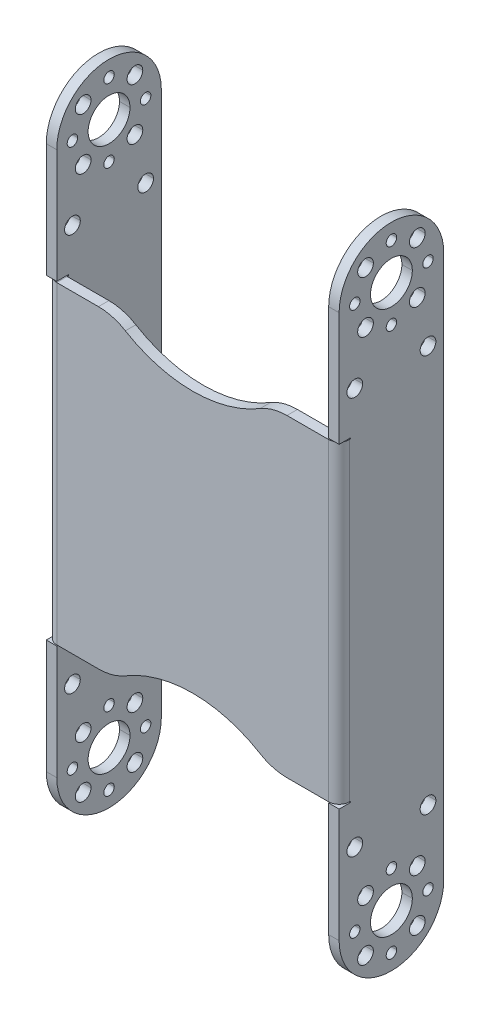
ISO-10303-21;
HEADER;
FILE_DESCRIPTION(('STEP AP214'),'2;1');
FILE_NAME('part.step','',(''),(''),'','','');
FILE_SCHEMA(('AUTOMOTIVE_DESIGN { 1 0 10303 214 1 1 1 1 }'));
ENDSEC;
DATA;
#1=APPLICATION_CONTEXT('core data for automotive mechanical design processes');
#2=APPLICATION_PROTOCOL_DEFINITION('international standard','automotive_design',2000,#1);
#3=PRODUCT_CONTEXT('',#1,'mechanical');
#4=PRODUCT('Part','Part','',(#3));
#5=PRODUCT_RELATED_PRODUCT_CATEGORY('part','',(#4));
#6=PRODUCT_DEFINITION_FORMATION('','',#4);
#7=PRODUCT_DEFINITION_CONTEXT('part definition',#1,'design');
#8=PRODUCT_DEFINITION('design','',#6,#7);
#9=PRODUCT_DEFINITION_SHAPE('','',#8);
#10=(LENGTH_UNIT() NAMED_UNIT(*) SI_UNIT(.MILLI.,.METRE.));
#11=(NAMED_UNIT(*) PLANE_ANGLE_UNIT() SI_UNIT($,.RADIAN.));
#12=(NAMED_UNIT(*) SI_UNIT($,.STERADIAN.) SOLID_ANGLE_UNIT());
#13=UNCERTAINTY_MEASURE_WITH_UNIT(LENGTH_MEASURE(1.E-05),#10,'distance_accuracy_value','');
#14=(GEOMETRIC_REPRESENTATION_CONTEXT(3) GLOBAL_UNCERTAINTY_ASSIGNED_CONTEXT((#13)) GLOBAL_UNIT_ASSIGNED_CONTEXT((#10,
#11,#12)) REPRESENTATION_CONTEXT('',''));
#15=CARTESIAN_POINT('',(0.,0.,0.));
#16=DIRECTION('',(0.,0.,1.));
#17=DIRECTION('',(1.,0.,0.));
#18=AXIS2_PLACEMENT_3D('',#15,#16,#17);
#19=CARTESIAN_POINT('',(7.97224362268,-20.,0.));
#20=DIRECTION('',(0.,0.,1.));
#21=DIRECTION('',(1.,0.,0.));
#22=AXIS2_PLACEMENT_3D('',#19,#20,#21);
#23=CYLINDRICAL_SURFACE('',#22,10.);
#24=DIRECTION('',(0.,0.,-1.));
#25=VECTOR('',#24,1.);
#26=CARTESIAN_POINT('',(7.97224362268,-30.,10.));
#27=LINE('',#26,#25);
#28=CARTESIAN_POINT('',(7.97224362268,-30.,10.));
#29=VERTEX_POINT('',#28);
#30=CARTESIAN_POINT('',(7.97224362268,-30.,8.));
#31=VERTEX_POINT('',#30);
#32=EDGE_CURVE('E1123',#29,#31,#27,.T.);
#33=ORIENTED_EDGE('',*,*,#32,.T.);
#34=CARTESIAN_POINT('',(7.97224362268,-20.,8.));
#35=DIRECTION('',(0.,0.,-1.));
#36=DIRECTION('',(0.515078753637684,-0.857142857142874,0.));
#37=AXIS2_PLACEMENT_3D('',#34,#35,#36);
#38=CIRCLE('',#37,10.);
#39=CARTESIAN_POINT('',(13.12303115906,-28.57142857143,8.));
#40=VERTEX_POINT('',#39);
#41=EDGE_CURVE('E1122',#40,#31,#38,.T.);
#42=ORIENTED_EDGE('',*,*,#41,.F.);
#43=DIRECTION('',(0.,0.,1.));
#44=VECTOR('',#43,1.);
#45=CARTESIAN_POINT('',(13.12303115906,-28.57142857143,8.));
#46=LINE('',#45,#44);
#47=CARTESIAN_POINT('',(13.12303115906,-28.57142857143,10.));
#48=VERTEX_POINT('',#47);
#49=EDGE_CURVE('E1619',#40,#48,#46,.T.);
#50=ORIENTED_EDGE('',*,*,#49,.T.);
#51=CARTESIAN_POINT('',(7.97224362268,-20.,10.));
#52=DIRECTION('',(0.,0.,1.));
#53=DIRECTION('',(0.,-1.,0.));
#54=AXIS2_PLACEMENT_3D('',#51,#52,#53);
#55=CIRCLE('',#54,10.);
#56=EDGE_CURVE('E1252',#29,#48,#55,.T.);
#57=ORIENTED_EDGE('',*,*,#56,.F.);
#58=EDGE_LOOP('',(#33,#42,#50,#57));
#59=FACE_BOUND('',#58,.T.);
#60=ADVANCED_FACE('F17',(#59),#23,.T.);
#61=CARTESIAN_POINT('',(54.,52.,0.));
#62=DIRECTION('',(-1.,0.,0.));
#63=DIRECTION('',(0.,0.,1.));
#64=AXIS2_PLACEMENT_3D('',#61,#62,#63);
#65=CYLINDRICAL_SURFACE('',#64,4.);
#66=CARTESIAN_POINT('',(54.,52.,0.));
#67=DIRECTION('',(-1.,0.,0.));
#68=DIRECTION('',(0.,0.,1.));
#69=AXIS2_PLACEMENT_3D('',#66,#67,#68);
#70=CIRCLE('',#69,4.);
#71=CARTESIAN_POINT('',(54.,52.,4.));
#72=VERTEX_POINT('',#71);
#73=CARTESIAN_POINT('',(54.,52.,-4.));
#74=VERTEX_POINT('',#73);
#75=EDGE_CURVE('E1708',#72,#74,#70,.T.);
#76=ORIENTED_EDGE('',*,*,#75,.F.);
#77=DIRECTION('',(1.,0.,0.));
#78=VECTOR('',#77,1.);
#79=CARTESIAN_POINT('',(52.,52.,4.));
#80=LINE('',#79,#78);
#81=CARTESIAN_POINT('',(52.,52.,4.));
#82=VERTEX_POINT('',#81);
#83=EDGE_CURVE('E11',#82,#72,#80,.T.);
#84=ORIENTED_EDGE('',*,*,#83,.F.);
#85=CARTESIAN_POINT('',(52.,52.,0.));
#86=DIRECTION('',(1.,0.,0.));
#87=DIRECTION('',(0.,0.,-1.));
#88=AXIS2_PLACEMENT_3D('',#85,#86,#87);
#89=CIRCLE('',#88,4.);
#90=CARTESIAN_POINT('',(52.,52.,-4.));
#91=VERTEX_POINT('',#90);
#92=EDGE_CURVE('E2040',#91,#82,#89,.T.);
#93=ORIENTED_EDGE('',*,*,#92,.F.);
#94=DIRECTION('',(1.,0.,0.));
#95=VECTOR('',#94,1.);
#96=CARTESIAN_POINT('',(52.,52.,-4.));
#97=LINE('',#96,#95);
#98=EDGE_CURVE('E28',#91,#74,#97,.T.);
#99=ORIENTED_EDGE('',*,*,#98,.T.);
#100=EDGE_LOOP('',(#76,#84,#93,#99));
#101=FACE_BOUND('',#100,.T.);
#102=ADVANCED_FACE('F2650',(#101),#65,.F.);
#103=CARTESIAN_POINT('',(54.,52.,0.));
#104=DIRECTION('',(-1.,0.,0.));
#105=DIRECTION('',(0.,0.,1.));
#106=AXIS2_PLACEMENT_3D('',#103,#104,#105);
#107=CYLINDRICAL_SURFACE('',#106,4.);
#108=ORIENTED_EDGE('',*,*,#98,.F.);
#109=CARTESIAN_POINT('',(52.,52.,0.));
#110=DIRECTION('',(1.,0.,0.));
#111=DIRECTION('',(0.,0.,1.));
#112=AXIS2_PLACEMENT_3D('',#109,#110,#111);
#113=CIRCLE('',#112,4.);
#114=EDGE_CURVE('E2044',#82,#91,#113,.T.);
#115=ORIENTED_EDGE('',*,*,#114,.F.);
#116=ORIENTED_EDGE('',*,*,#83,.T.);
#117=CARTESIAN_POINT('',(54.,52.,0.));
#118=DIRECTION('',(-1.,0.,0.));
#119=DIRECTION('',(0.,0.,-1.));
#120=AXIS2_PLACEMENT_3D('',#117,#118,#119);
#121=CIRCLE('',#120,4.);
#122=EDGE_CURVE('E1627',#74,#72,#121,.T.);
#123=ORIENTED_EDGE('',*,*,#122,.F.);
#124=EDGE_LOOP('',(#108,#115,#116,#123));
#125=FACE_BOUND('',#124,.T.);
#126=ADVANCED_FACE('F2654',(#125),#107,.F.);
#127=CARTESIAN_POINT('',(54.,-59.,1.567071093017E-13));
#128=DIRECTION('',(-1.,0.,0.));
#129=DIRECTION('',(0.,0.,1.));
#130=AXIS2_PLACEMENT_3D('',#127,#128,#129);
#131=CYLINDRICAL_SURFACE('',#130,1.);
#132=CARTESIAN_POINT('',(54.,-59.,1.567071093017E-13));
#133=DIRECTION('',(-1.,0.,0.));
#134=DIRECTION('',(0.,0.,1.));
#135=AXIS2_PLACEMENT_3D('',#132,#133,#134);
#136=CIRCLE('',#135,1.);
#137=CARTESIAN_POINT('',(54.,-59.,1.));
#138=VERTEX_POINT('',#137);
#139=CARTESIAN_POINT('',(54.,-59.,-0.9999999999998));
#140=VERTEX_POINT('',#139);
#141=EDGE_CURVE('E1623',#138,#140,#136,.T.);
#142=ORIENTED_EDGE('',*,*,#141,.F.);
#143=DIRECTION('',(1.,0.,0.));
#144=VECTOR('',#143,1.);
#145=CARTESIAN_POINT('',(52.,-59.,1.));
#146=LINE('',#145,#144);
#147=CARTESIAN_POINT('',(52.,-59.,1.));
#148=VERTEX_POINT('',#147);
#149=EDGE_CURVE('E1167',#148,#138,#146,.T.);
#150=ORIENTED_EDGE('',*,*,#149,.F.);
#151=CARTESIAN_POINT('',(52.,-59.,1.567071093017E-13));
#152=DIRECTION('',(1.,0.,0.));
#153=DIRECTION('',(0.,0.,-1.));
#154=AXIS2_PLACEMENT_3D('',#151,#152,#153);
#155=CIRCLE('',#154,1.);
#156=CARTESIAN_POINT('',(52.,-59.,-0.9999999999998));
#157=VERTEX_POINT('',#156);
#158=EDGE_CURVE('E1537',#157,#148,#155,.T.);
#159=ORIENTED_EDGE('',*,*,#158,.F.);
#160=DIRECTION('',(1.,0.,0.));
#161=VECTOR('',#160,1.);
#162=CARTESIAN_POINT('',(52.,-59.,-0.9999999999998));
#163=LINE('',#162,#161);
#164=EDGE_CURVE('E1164',#157,#140,#163,.T.);
#165=ORIENTED_EDGE('',*,*,#164,.T.);
#166=EDGE_LOOP('',(#142,#150,#159,#165));
#167=FACE_BOUND('',#166,.T.);
#168=ADVANCED_FACE('F2933',(#167),#131,.F.);
#169=CARTESIAN_POINT('',(54.,-59.,1.567071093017E-13));
#170=DIRECTION('',(-1.,0.,0.));
#171=DIRECTION('',(0.,0.,1.));
#172=AXIS2_PLACEMENT_3D('',#169,#170,#171);
#173=CYLINDRICAL_SURFACE('',#172,1.);
#174=ORIENTED_EDGE('',*,*,#164,.F.);
#175=CARTESIAN_POINT('',(52.,-59.,1.567071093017E-13));
#176=DIRECTION('',(1.,0.,0.));
#177=DIRECTION('',(0.,0.,1.));
#178=AXIS2_PLACEMENT_3D('',#175,#176,#177);
#179=CIRCLE('',#178,1.);
#180=EDGE_CURVE('E2045',#148,#157,#179,.T.);
#181=ORIENTED_EDGE('',*,*,#180,.F.);
#182=ORIENTED_EDGE('',*,*,#149,.T.);
#183=CARTESIAN_POINT('',(54.,-59.,1.567071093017E-13));
#184=DIRECTION('',(-1.,0.,0.));
#185=DIRECTION('',(0.,0.,-1.));
#186=AXIS2_PLACEMENT_3D('',#183,#184,#185);
#187=CIRCLE('',#186,1.);
#188=EDGE_CURVE('E1628',#140,#138,#187,.T.);
#189=ORIENTED_EDGE('',*,*,#188,.F.);
#190=EDGE_LOOP('',(#174,#181,#182,#189));
#191=FACE_BOUND('',#190,.T.);
#192=ADVANCED_FACE('F2851',(#191),#173,.F.);
#193=CARTESIAN_POINT('',(54.,-52.,-7.));
#194=DIRECTION('',(-1.,0.,0.));
#195=DIRECTION('',(0.,0.,1.));
#196=AXIS2_PLACEMENT_3D('',#193,#194,#195);
#197=CYLINDRICAL_SURFACE('',#196,1.);
#198=CARTESIAN_POINT('',(54.,-52.,-7.));
#199=DIRECTION('',(-1.,0.,0.));
#200=DIRECTION('',(0.,0.,1.));
#201=AXIS2_PLACEMENT_3D('',#198,#199,#200);
#202=CIRCLE('',#201,1.);
#203=CARTESIAN_POINT('',(54.,-52.,-6.));
#204=VERTEX_POINT('',#203);
#205=CARTESIAN_POINT('',(54.,-52.,-8.));
#206=VERTEX_POINT('',#205);
#207=EDGE_CURVE('E1872',#204,#206,#202,.T.);
#208=ORIENTED_EDGE('',*,*,#207,.F.);
#209=DIRECTION('',(1.,0.,0.));
#210=VECTOR('',#209,1.);
#211=CARTESIAN_POINT('',(52.,-52.,-6.));
#212=LINE('',#211,#210);
#213=CARTESIAN_POINT('',(52.,-52.,-6.));
#214=VERTEX_POINT('',#213);
#215=EDGE_CURVE('E1168',#214,#204,#212,.T.);
#216=ORIENTED_EDGE('',*,*,#215,.F.);
#217=CARTESIAN_POINT('',(52.,-52.,-7.));
#218=DIRECTION('',(1.,0.,0.));
#219=DIRECTION('',(0.,0.,-1.));
#220=AXIS2_PLACEMENT_3D('',#217,#218,#219);
#221=CIRCLE('',#220,1.);
#222=CARTESIAN_POINT('',(52.,-52.,-8.));
#223=VERTEX_POINT('',#222);
#224=EDGE_CURVE('E1124',#223,#214,#221,.T.);
#225=ORIENTED_EDGE('',*,*,#224,.F.);
#226=DIRECTION('',(1.,0.,0.));
#227=VECTOR('',#226,1.);
#228=CARTESIAN_POINT('',(52.,-52.,-8.));
#229=LINE('',#228,#227);
#230=EDGE_CURVE('E1443',#223,#206,#229,.T.);
#231=ORIENTED_EDGE('',*,*,#230,.T.);
#232=EDGE_LOOP('',(#208,#216,#225,#231));
#233=FACE_BOUND('',#232,.T.);
#234=ADVANCED_FACE('F2848',(#233),#197,.F.);
#235=CARTESIAN_POINT('',(54.,-52.,-7.));
#236=DIRECTION('',(-1.,0.,0.));
#237=DIRECTION('',(0.,0.,1.));
#238=AXIS2_PLACEMENT_3D('',#235,#236,#237);
#239=CYLINDRICAL_SURFACE('',#238,1.);
#240=ORIENTED_EDGE('',*,*,#230,.F.);
#241=CARTESIAN_POINT('',(52.,-52.,-7.));
#242=DIRECTION('',(1.,0.,0.));
#243=DIRECTION('',(0.,0.,1.));
#244=AXIS2_PLACEMENT_3D('',#241,#242,#243);
#245=CIRCLE('',#244,1.);
#246=EDGE_CURVE('E1128',#214,#223,#245,.T.);
#247=ORIENTED_EDGE('',*,*,#246,.F.);
#248=ORIENTED_EDGE('',*,*,#215,.T.);
#249=CARTESIAN_POINT('',(54.,-52.,-7.));
#250=DIRECTION('',(-1.,0.,0.));
#251=DIRECTION('',(0.,0.,-1.));
#252=AXIS2_PLACEMENT_3D('',#249,#250,#251);
#253=CIRCLE('',#252,1.);
#254=EDGE_CURVE('E1696',#206,#204,#253,.T.);
#255=ORIENTED_EDGE('',*,*,#254,.F.);
#256=EDGE_LOOP('',(#240,#247,#248,#255));
#257=FACE_BOUND('',#256,.T.);
#258=ADVANCED_FACE('F2762',(#257),#239,.F.);
#259=CARTESIAN_POINT('',(54.,-45.,5.636335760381E-13));
#260=DIRECTION('',(-1.,0.,0.));
#261=DIRECTION('',(0.,0.,1.));
#262=AXIS2_PLACEMENT_3D('',#259,#260,#261);
#263=CYLINDRICAL_SURFACE('',#262,1.);
#264=CARTESIAN_POINT('',(54.,-45.,5.636335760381E-13));
#265=DIRECTION('',(-1.,0.,0.));
#266=DIRECTION('',(0.,0.,1.));
#267=AXIS2_PLACEMENT_3D('',#264,#265,#266);
#268=CIRCLE('',#267,1.);
#269=CARTESIAN_POINT('',(54.,-45.,1.000000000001));
#270=VERTEX_POINT('',#269);
#271=CARTESIAN_POINT('',(54.,-45.,-0.9999999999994));
#272=VERTEX_POINT('',#271);
#273=EDGE_CURVE('E1692',#270,#272,#268,.T.);
#274=ORIENTED_EDGE('',*,*,#273,.F.);
#275=DIRECTION('',(1.,0.,0.));
#276=VECTOR('',#275,1.);
#277=CARTESIAN_POINT('',(52.,-45.,1.000000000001));
#278=LINE('',#277,#276);
#279=CARTESIAN_POINT('',(52.,-45.,1.000000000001));
#280=VERTEX_POINT('',#279);
#281=EDGE_CURVE('E1446',#280,#270,#278,.T.);
#282=ORIENTED_EDGE('',*,*,#281,.F.);
#283=CARTESIAN_POINT('',(52.,-45.,5.636335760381E-13));
#284=DIRECTION('',(1.,0.,0.));
#285=DIRECTION('',(0.,0.,-1.));
#286=AXIS2_PLACEMENT_3D('',#283,#284,#285);
#287=CIRCLE('',#286,1.);
#288=CARTESIAN_POINT('',(52.,-45.,-0.9999999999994));
#289=VERTEX_POINT('',#288);
#290=EDGE_CURVE('E1477',#289,#280,#287,.T.);
#291=ORIENTED_EDGE('',*,*,#290,.F.);
#292=DIRECTION('',(1.,0.,0.));
#293=VECTOR('',#292,1.);
#294=CARTESIAN_POINT('',(52.,-45.,-0.9999999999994));
#295=LINE('',#294,#293);
#296=EDGE_CURVE('E1512',#289,#272,#295,.T.);
#297=ORIENTED_EDGE('',*,*,#296,.T.);
#298=EDGE_LOOP('',(#274,#282,#291,#297));
#299=FACE_BOUND('',#298,.T.);
#300=ADVANCED_FACE('F2663',(#299),#263,.F.);
#301=CARTESIAN_POINT('',(54.,-45.,5.636335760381E-13));
#302=DIRECTION('',(-1.,0.,0.));
#303=DIRECTION('',(0.,0.,1.));
#304=AXIS2_PLACEMENT_3D('',#301,#302,#303);
#305=CYLINDRICAL_SURFACE('',#304,1.);
#306=ORIENTED_EDGE('',*,*,#296,.F.);
#307=CARTESIAN_POINT('',(52.,-45.,5.636335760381E-13));
#308=DIRECTION('',(1.,0.,0.));
#309=DIRECTION('',(0.,0.,1.));
#310=AXIS2_PLACEMENT_3D('',#307,#308,#309);
#311=CIRCLE('',#310,1.);
#312=EDGE_CURVE('E1129',#280,#289,#311,.T.);
#313=ORIENTED_EDGE('',*,*,#312,.F.);
#314=ORIENTED_EDGE('',*,*,#281,.T.);
#315=CARTESIAN_POINT('',(54.,-45.,5.636335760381E-13));
#316=DIRECTION('',(-1.,0.,0.));
#317=DIRECTION('',(0.,0.,-1.));
#318=AXIS2_PLACEMENT_3D('',#315,#316,#317);
#319=CIRCLE('',#318,1.);
#320=EDGE_CURVE('E1139',#272,#270,#319,.T.);
#321=ORIENTED_EDGE('',*,*,#320,.F.);
#322=EDGE_LOOP('',(#306,#313,#314,#321));
#323=FACE_BOUND('',#322,.T.);
#324=ADVANCED_FACE('F2659',(#323),#305,.F.);
#325=CARTESIAN_POINT('',(54.,-52.,7.));
#326=DIRECTION('',(-1.,0.,0.));
#327=DIRECTION('',(0.,0.,1.));
#328=AXIS2_PLACEMENT_3D('',#325,#326,#327);
#329=CYLINDRICAL_SURFACE('',#328,1.);
#330=CARTESIAN_POINT('',(54.,-52.,7.));
#331=DIRECTION('',(-1.,0.,0.));
#332=DIRECTION('',(0.,0.,1.));
#333=AXIS2_PLACEMENT_3D('',#330,#331,#332);
#334=CIRCLE('',#333,1.);
#335=CARTESIAN_POINT('',(54.,-52.,8.));
#336=VERTEX_POINT('',#335);
#337=CARTESIAN_POINT('',(54.,-52.,6.));
#338=VERTEX_POINT('',#337);
#339=EDGE_CURVE('E1136',#336,#338,#334,.T.);
#340=ORIENTED_EDGE('',*,*,#339,.F.);
#341=DIRECTION('',(1.,0.,0.));
#342=VECTOR('',#341,1.);
#343=CARTESIAN_POINT('',(52.,-52.,8.));
#344=LINE('',#343,#342);
#345=CARTESIAN_POINT('',(52.,-52.,8.));
#346=VERTEX_POINT('',#345);
#347=EDGE_CURVE('E557',#346,#336,#344,.T.);
#348=ORIENTED_EDGE('',*,*,#347,.F.);
#349=CARTESIAN_POINT('',(52.,-52.,7.));
#350=DIRECTION('',(1.,0.,0.));
#351=DIRECTION('',(0.,0.,-1.));
#352=AXIS2_PLACEMENT_3D('',#349,#350,#351);
#353=CIRCLE('',#352,1.);
#354=CARTESIAN_POINT('',(52.,-52.,6.));
#355=VERTEX_POINT('',#354);
#356=EDGE_CURVE('E1478',#355,#346,#353,.T.);
#357=ORIENTED_EDGE('',*,*,#356,.F.);
#358=DIRECTION('',(1.,0.,0.));
#359=VECTOR('',#358,1.);
#360=CARTESIAN_POINT('',(52.,-52.,6.));
#361=LINE('',#360,#359);
#362=EDGE_CURVE('E571',#355,#338,#361,.T.);
#363=ORIENTED_EDGE('',*,*,#362,.T.);
#364=EDGE_LOOP('',(#340,#348,#357,#363));
#365=FACE_BOUND('',#364,.T.);
#366=ADVANCED_FACE('F2662',(#365),#329,.F.);
#367=CARTESIAN_POINT('',(54.,-52.,7.));
#368=DIRECTION('',(-1.,0.,0.));
#369=DIRECTION('',(0.,0.,1.));
#370=AXIS2_PLACEMENT_3D('',#367,#368,#369);
#371=CYLINDRICAL_SURFACE('',#370,1.);
#372=ORIENTED_EDGE('',*,*,#362,.F.);
#373=CARTESIAN_POINT('',(52.,-52.,7.));
#374=DIRECTION('',(1.,0.,0.));
#375=DIRECTION('',(0.,0.,1.));
#376=AXIS2_PLACEMENT_3D('',#373,#374,#375);
#377=CIRCLE('',#376,1.);
#378=EDGE_CURVE('E1473',#346,#355,#377,.T.);
#379=ORIENTED_EDGE('',*,*,#378,.F.);
#380=ORIENTED_EDGE('',*,*,#347,.T.);
#381=CARTESIAN_POINT('',(54.,-52.,7.));
#382=DIRECTION('',(-1.,0.,0.));
#383=DIRECTION('',(0.,0.,-1.));
#384=AXIS2_PLACEMENT_3D('',#381,#382,#383);
#385=CIRCLE('',#384,1.);
#386=EDGE_CURVE('E1140',#338,#336,#385,.T.);
#387=ORIENTED_EDGE('',*,*,#386,.F.);
#388=EDGE_LOOP('',(#372,#379,#380,#387));
#389=FACE_BOUND('',#388,.T.);
#390=ADVANCED_FACE('F2695',(#389),#371,.F.);
#391=CARTESIAN_POINT('',(54.,-52.,1.38492512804E-13));
#392=DIRECTION('',(-1.,0.,0.));
#393=DIRECTION('',(0.,0.,1.));
#394=AXIS2_PLACEMENT_3D('',#391,#392,#393);
#395=CYLINDRICAL_SURFACE('',#394,4.);
#396=CARTESIAN_POINT('',(54.,-52.,1.38492512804E-13));
#397=DIRECTION('',(-1.,0.,0.));
#398=DIRECTION('',(0.,0.,1.));
#399=AXIS2_PLACEMENT_3D('',#396,#397,#398);
#400=CIRCLE('',#399,4.);
#401=CARTESIAN_POINT('',(54.,-52.,4.));
#402=VERTEX_POINT('',#401);
#403=CARTESIAN_POINT('',(54.,-52.,-4.));
#404=VERTEX_POINT('',#403);
#405=EDGE_CURVE('E2284',#402,#404,#400,.T.);
#406=ORIENTED_EDGE('',*,*,#405,.F.);
#407=DIRECTION('',(1.,0.,0.));
#408=VECTOR('',#407,1.);
#409=CARTESIAN_POINT('',(52.,-52.,4.));
#410=LINE('',#409,#408);
#411=CARTESIAN_POINT('',(52.,-52.,4.));
#412=VERTEX_POINT('',#411);
#413=EDGE_CURVE('E1527',#412,#402,#410,.T.);
#414=ORIENTED_EDGE('',*,*,#413,.F.);
#415=CARTESIAN_POINT('',(52.,-52.,1.38492512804E-13));
#416=DIRECTION('',(1.,0.,0.));
#417=DIRECTION('',(0.,0.,-1.));
#418=AXIS2_PLACEMENT_3D('',#415,#416,#417);
#419=CIRCLE('',#418,4.);
#420=CARTESIAN_POINT('',(52.,-52.,-4.));
#421=VERTEX_POINT('',#420);
#422=EDGE_CURVE('E1368',#421,#412,#419,.T.);
#423=ORIENTED_EDGE('',*,*,#422,.F.);
#424=DIRECTION('',(1.,0.,0.));
#425=VECTOR('',#424,1.);
#426=CARTESIAN_POINT('',(52.,-52.,-4.));
#427=LINE('',#426,#425);
#428=EDGE_CURVE('E1524',#421,#404,#427,.T.);
#429=ORIENTED_EDGE('',*,*,#428,.T.);
#430=EDGE_LOOP('',(#406,#414,#423,#429));
#431=FACE_BOUND('',#430,.T.);
#432=ADVANCED_FACE('F2691',(#431),#395,.F.);
#433=CARTESIAN_POINT('',(54.,-52.,1.38492512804E-13));
#434=DIRECTION('',(-1.,0.,0.));
#435=DIRECTION('',(0.,0.,1.));
#436=AXIS2_PLACEMENT_3D('',#433,#434,#435);
#437=CYLINDRICAL_SURFACE('',#436,4.);
#438=ORIENTED_EDGE('',*,*,#428,.F.);
#439=CARTESIAN_POINT('',(52.,-52.,1.38492512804E-13));
#440=DIRECTION('',(1.,0.,0.));
#441=DIRECTION('',(0.,0.,1.));
#442=AXIS2_PLACEMENT_3D('',#439,#440,#441);
#443=CIRCLE('',#442,4.);
#444=EDGE_CURVE('E1520',#412,#421,#443,.T.);
#445=ORIENTED_EDGE('',*,*,#444,.F.);
#446=ORIENTED_EDGE('',*,*,#413,.T.);
#447=CARTESIAN_POINT('',(54.,-52.,1.38492512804E-13));
#448=DIRECTION('',(-1.,0.,0.));
#449=DIRECTION('',(0.,0.,-1.));
#450=AXIS2_PLACEMENT_3D('',#447,#448,#449);
#451=CIRCLE('',#450,4.);
#452=EDGE_CURVE('E1817',#404,#402,#451,.T.);
#453=ORIENTED_EDGE('',*,*,#452,.F.);
#454=EDGE_LOOP('',(#438,#445,#446,#453));
#455=FACE_BOUND('',#454,.T.);
#456=ADVANCED_FACE('F2694',(#455),#437,.F.);
#457=CARTESIAN_POINT('',(54.,52.,-7.));
#458=DIRECTION('',(-1.,0.,0.));
#459=DIRECTION('',(0.,0.,1.));
#460=AXIS2_PLACEMENT_3D('',#457,#458,#459);
#461=CYLINDRICAL_SURFACE('',#460,1.);
#462=CARTESIAN_POINT('',(54.,52.,-7.));
#463=DIRECTION('',(-1.,0.,0.));
#464=DIRECTION('',(0.,0.,1.));
#465=AXIS2_PLACEMENT_3D('',#462,#463,#464);
#466=CIRCLE('',#465,1.);
#467=CARTESIAN_POINT('',(54.,52.,-6.));
#468=VERTEX_POINT('',#467);
#469=CARTESIAN_POINT('',(54.,52.,-8.));
#470=VERTEX_POINT('',#469);
#471=EDGE_CURVE('E1564',#468,#470,#466,.T.);
#472=ORIENTED_EDGE('',*,*,#471,.F.);
#473=DIRECTION('',(1.,0.,0.));
#474=VECTOR('',#473,1.);
#475=CARTESIAN_POINT('',(52.,52.,-6.));
#476=LINE('',#475,#474);
#477=CARTESIAN_POINT('',(52.,52.,-6.));
#478=VERTEX_POINT('',#477);
#479=EDGE_CURVE('E1528',#478,#468,#476,.T.);
#480=ORIENTED_EDGE('',*,*,#479,.F.);
#481=CARTESIAN_POINT('',(52.,52.,-7.));
#482=DIRECTION('',(1.,0.,0.));
#483=DIRECTION('',(0.,0.,-1.));
#484=AXIS2_PLACEMENT_3D('',#481,#482,#483);
#485=CIRCLE('',#484,1.);
#486=CARTESIAN_POINT('',(52.,52.,-8.));
#487=VERTEX_POINT('',#486);
#488=EDGE_CURVE('E1369',#487,#478,#485,.T.);
#489=ORIENTED_EDGE('',*,*,#488,.F.);
#490=DIRECTION('',(1.,0.,0.));
#491=VECTOR('',#490,1.);
#492=CARTESIAN_POINT('',(52.,52.,-8.));
#493=LINE('',#492,#491);
#494=EDGE_CURVE('E1722',#487,#470,#493,.T.);
#495=ORIENTED_EDGE('',*,*,#494,.T.);
#496=EDGE_LOOP('',(#472,#480,#489,#495));
#497=FACE_BOUND('',#496,.T.);
#498=ADVANCED_FACE('F2858',(#497),#461,.F.);
#499=CARTESIAN_POINT('',(54.,52.,-7.));
#500=DIRECTION('',(-1.,0.,0.));
#501=DIRECTION('',(0.,0.,1.));
#502=AXIS2_PLACEMENT_3D('',#499,#500,#501);
#503=CYLINDRICAL_SURFACE('',#502,1.);
#504=ORIENTED_EDGE('',*,*,#494,.F.);
#505=CARTESIAN_POINT('',(52.,52.,-7.));
#506=DIRECTION('',(1.,0.,0.));
#507=DIRECTION('',(0.,0.,1.));
#508=AXIS2_PLACEMENT_3D('',#505,#506,#507);
#509=CIRCLE('',#508,1.);
#510=EDGE_CURVE('E1364',#478,#487,#509,.T.);
#511=ORIENTED_EDGE('',*,*,#510,.F.);
#512=ORIENTED_EDGE('',*,*,#479,.T.);
#513=CARTESIAN_POINT('',(54.,52.,-7.));
#514=DIRECTION('',(-1.,0.,0.));
#515=DIRECTION('',(0.,0.,-1.));
#516=AXIS2_PLACEMENT_3D('',#513,#514,#515);
#517=CIRCLE('',#516,1.);
#518=EDGE_CURVE('E1560',#470,#468,#517,.T.);
#519=ORIENTED_EDGE('',*,*,#518,.F.);
#520=EDGE_LOOP('',(#504,#511,#512,#519));
#521=FACE_BOUND('',#520,.T.);
#522=ADVANCED_FACE('F2774',(#521),#503,.F.);
#523=CARTESIAN_POINT('',(54.,47.05025253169,4.949747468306));
#524=DIRECTION('',(-1.,0.,0.));
#525=DIRECTION('',(0.,0.,1.));
#526=AXIS2_PLACEMENT_3D('',#523,#524,#525);
#527=CYLINDRICAL_SURFACE('',#526,1.5);
#528=CARTESIAN_POINT('',(54.,47.05025253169,4.949747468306));
#529=DIRECTION('',(-1.,0.,0.));
#530=DIRECTION('',(0.,0.,1.));
#531=AXIS2_PLACEMENT_3D('',#528,#529,#530);
#532=CIRCLE('',#531,1.5);
#533=CARTESIAN_POINT('',(54.,47.05025253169,6.449747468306));
#534=VERTEX_POINT('',#533);
#535=CARTESIAN_POINT('',(54.,47.05025253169,3.449747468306));
#536=VERTEX_POINT('',#535);
#537=EDGE_CURVE('E1433',#534,#536,#532,.T.);
#538=ORIENTED_EDGE('',*,*,#537,.F.);
#539=DIRECTION('',(1.,0.,0.));
#540=VECTOR('',#539,1.);
#541=CARTESIAN_POINT('',(52.,47.05025253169,6.449747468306));
#542=LINE('',#541,#540);
#543=CARTESIAN_POINT('',(52.,47.05025253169,6.449747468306));
#544=VERTEX_POINT('',#543);
#545=EDGE_CURVE('E1231',#544,#534,#542,.T.);
#546=ORIENTED_EDGE('',*,*,#545,.F.);
#547=CARTESIAN_POINT('',(52.,47.05025253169,4.949747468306));
#548=DIRECTION('',(1.,0.,0.));
#549=DIRECTION('',(0.,0.,-1.));
#550=AXIS2_PLACEMENT_3D('',#547,#548,#549);
#551=CIRCLE('',#550,1.5);
#552=CARTESIAN_POINT('',(52.,47.05025253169,3.449747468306));
#553=VERTEX_POINT('',#552);
#554=EDGE_CURVE('E1353',#553,#544,#551,.T.);
#555=ORIENTED_EDGE('',*,*,#554,.F.);
#556=DIRECTION('',(1.,0.,0.));
#557=VECTOR('',#556,1.);
#558=CARTESIAN_POINT('',(52.,47.05025253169,3.449747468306));
#559=LINE('',#558,#557);
#560=EDGE_CURVE('E1228',#553,#536,#559,.T.);
#561=ORIENTED_EDGE('',*,*,#560,.T.);
#562=EDGE_LOOP('',(#538,#546,#555,#561));
#563=FACE_BOUND('',#562,.T.);
#564=ADVANCED_FACE('F2770',(#563),#527,.F.);
#565=CARTESIAN_POINT('',(54.,47.05025253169,4.949747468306));
#566=DIRECTION('',(-1.,0.,0.));
#567=DIRECTION('',(0.,0.,1.));
#568=AXIS2_PLACEMENT_3D('',#565,#566,#567);
#569=CYLINDRICAL_SURFACE('',#568,1.5);
#570=ORIENTED_EDGE('',*,*,#560,.F.);
#571=CARTESIAN_POINT('',(52.,47.05025253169,4.949747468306));
#572=DIRECTION('',(1.,0.,0.));
#573=DIRECTION('',(0.,0.,1.));
#574=AXIS2_PLACEMENT_3D('',#571,#572,#573);
#575=CIRCLE('',#574,1.5);
#576=EDGE_CURVE('E1357',#544,#553,#575,.T.);
#577=ORIENTED_EDGE('',*,*,#576,.F.);
#578=ORIENTED_EDGE('',*,*,#545,.T.);
#579=CARTESIAN_POINT('',(54.,47.05025253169,4.949747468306));
#580=DIRECTION('',(-1.,0.,0.));
#581=DIRECTION('',(0.,0.,-1.));
#582=AXIS2_PLACEMENT_3D('',#579,#580,#581);
#583=CIRCLE('',#582,1.5);
#584=EDGE_CURVE('E1429',#536,#534,#583,.T.);
#585=ORIENTED_EDGE('',*,*,#584,.F.);
#586=EDGE_LOOP('',(#570,#577,#578,#585));
#587=FACE_BOUND('',#586,.T.);
#588=ADVANCED_FACE('F2773',(#587),#569,.F.);
#589=CARTESIAN_POINT('',(54.,45.,4.465397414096E-13));
#590=DIRECTION('',(-1.,0.,0.));
#591=DIRECTION('',(0.,0.,1.));
#592=AXIS2_PLACEMENT_3D('',#589,#590,#591);
#593=CYLINDRICAL_SURFACE('',#592,1.);
#594=CARTESIAN_POINT('',(54.,45.,4.465397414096E-13));
#595=DIRECTION('',(-1.,0.,0.));
#596=DIRECTION('',(0.,0.,1.));
#597=AXIS2_PLACEMENT_3D('',#594,#595,#596);
#598=CIRCLE('',#597,1.);
#599=CARTESIAN_POINT('',(54.,45.,1.));
#600=VERTEX_POINT('',#599);
#601=CARTESIAN_POINT('',(54.,45.,-0.9999999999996));
#602=VERTEX_POINT('',#601);
#603=EDGE_CURVE('E1434',#600,#602,#598,.T.);
#604=ORIENTED_EDGE('',*,*,#603,.F.);
#605=DIRECTION('',(1.,0.,0.));
#606=VECTOR('',#605,1.);
#607=CARTESIAN_POINT('',(52.,45.,1.));
#608=LINE('',#607,#606);
#609=CARTESIAN_POINT('',(52.,45.,1.));
#610=VERTEX_POINT('',#609);
#611=EDGE_CURVE('E1232',#610,#600,#608,.T.);
#612=ORIENTED_EDGE('',*,*,#611,.F.);
#613=CARTESIAN_POINT('',(52.,45.,4.465397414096E-13));
#614=DIRECTION('',(1.,0.,0.));
#615=DIRECTION('',(0.,0.,-1.));
#616=AXIS2_PLACEMENT_3D('',#613,#614,#615);
#617=CIRCLE('',#616,1.);
#618=CARTESIAN_POINT('',(52.,45.,-0.9999999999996));
#619=VERTEX_POINT('',#618);
#620=EDGE_CURVE('E2039',#619,#610,#617,.T.);
#621=ORIENTED_EDGE('',*,*,#620,.F.);
#622=DIRECTION('',(1.,0.,0.));
#623=VECTOR('',#622,1.);
#624=CARTESIAN_POINT('',(52.,45.,-0.9999999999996));
#625=LINE('',#624,#623);
#626=EDGE_CURVE('E1699',#619,#602,#625,.T.);
#627=ORIENTED_EDGE('',*,*,#626,.T.);
#628=EDGE_LOOP('',(#604,#612,#621,#627));
#629=FACE_BOUND('',#628,.T.);
#630=ADVANCED_FACE('F2944',(#629),#593,.F.);
#631=CARTESIAN_POINT('',(54.,45.,4.465397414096E-13));
#632=DIRECTION('',(-1.,0.,0.));
#633=DIRECTION('',(0.,0.,1.));
#634=AXIS2_PLACEMENT_3D('',#631,#632,#633);
#635=CYLINDRICAL_SURFACE('',#634,1.);
#636=ORIENTED_EDGE('',*,*,#626,.F.);
#637=CARTESIAN_POINT('',(52.,45.,4.465397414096E-13));
#638=DIRECTION('',(1.,0.,0.));
#639=DIRECTION('',(0.,0.,1.));
#640=AXIS2_PLACEMENT_3D('',#637,#638,#639);
#641=CIRCLE('',#640,1.);
#642=EDGE_CURVE('E1358',#610,#619,#641,.T.);
#643=ORIENTED_EDGE('',*,*,#642,.F.);
#644=ORIENTED_EDGE('',*,*,#611,.T.);
#645=CARTESIAN_POINT('',(54.,45.,4.465397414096E-13));
#646=DIRECTION('',(-1.,0.,0.));
#647=DIRECTION('',(0.,0.,-1.));
#648=AXIS2_PLACEMENT_3D('',#645,#646,#647);
#649=CIRCLE('',#648,1.);
#650=EDGE_CURVE('E1646',#602,#600,#649,.T.);
#651=ORIENTED_EDGE('',*,*,#650,.F.);
#652=EDGE_LOOP('',(#636,#643,#644,#651));
#653=FACE_BOUND('',#652,.T.);
#654=ADVANCED_FACE('F2879',(#653),#635,.F.);
#655=CARTESIAN_POINT('',(54.,47.05025253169,-4.949747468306));
#656=DIRECTION('',(-1.,0.,0.));
#657=DIRECTION('',(0.,0.,1.));
#658=AXIS2_PLACEMENT_3D('',#655,#656,#657);
#659=CYLINDRICAL_SURFACE('',#658,1.5);
#660=CARTESIAN_POINT('',(54.,47.05025253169,-4.949747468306));
#661=DIRECTION('',(-1.,0.,0.));
#662=DIRECTION('',(0.,0.,1.));
#663=AXIS2_PLACEMENT_3D('',#660,#661,#662);
#664=CIRCLE('',#663,1.5);
#665=CARTESIAN_POINT('',(54.,47.05025253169,-3.449747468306));
#666=VERTEX_POINT('',#665);
#667=CARTESIAN_POINT('',(54.,47.05025253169,-6.449747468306));
#668=VERTEX_POINT('',#667);
#669=EDGE_CURVE('E1650',#666,#668,#664,.T.);
#670=ORIENTED_EDGE('',*,*,#669,.F.);
#671=DIRECTION('',(1.,0.,0.));
#672=VECTOR('',#671,1.);
#673=CARTESIAN_POINT('',(52.,47.05025253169,-3.449747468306));
#674=LINE('',#673,#672);
#675=CARTESIAN_POINT('',(52.,47.05025253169,-3.449747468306));
#676=VERTEX_POINT('',#675);
#677=EDGE_CURVE('E1850',#676,#666,#674,.T.);
#678=ORIENTED_EDGE('',*,*,#677,.F.);
#679=CARTESIAN_POINT('',(52.,47.05025253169,-4.949747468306));
#680=DIRECTION('',(1.,0.,0.));
#681=DIRECTION('',(0.,0.,-1.));
#682=AXIS2_PLACEMENT_3D('',#679,#680,#681);
#683=CIRCLE('',#682,1.5);
#684=CARTESIAN_POINT('',(52.,47.05025253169,-6.449747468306));
#685=VERTEX_POINT('',#684);
#686=EDGE_CURVE('E1169',#685,#676,#683,.T.);
#687=ORIENTED_EDGE('',*,*,#686,.F.);
#688=DIRECTION('',(1.,0.,0.));
#689=VECTOR('',#688,1.);
#690=CARTESIAN_POINT('',(52.,47.05025253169,-6.449747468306));
#691=LINE('',#690,#689);
#692=EDGE_CURVE('E1853',#685,#668,#691,.T.);
#693=ORIENTED_EDGE('',*,*,#692,.T.);
#694=EDGE_LOOP('',(#670,#678,#687,#693));
#695=FACE_BOUND('',#694,.T.);
#696=ADVANCED_FACE('F2875',(#695),#659,.F.);
#697=CARTESIAN_POINT('',(54.,47.05025253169,-4.949747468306));
#698=DIRECTION('',(-1.,0.,0.));
#699=DIRECTION('',(0.,0.,1.));
#700=AXIS2_PLACEMENT_3D('',#697,#698,#699);
#701=CYLINDRICAL_SURFACE('',#700,1.5);
#702=ORIENTED_EDGE('',*,*,#692,.F.);
#703=CARTESIAN_POINT('',(52.,47.05025253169,-4.949747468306));
#704=DIRECTION('',(1.,0.,0.));
#705=DIRECTION('',(0.,0.,1.));
#706=AXIS2_PLACEMENT_3D('',#703,#704,#705);
#707=CIRCLE('',#706,1.5);
#708=EDGE_CURVE('E1173',#676,#685,#707,.T.);
#709=ORIENTED_EDGE('',*,*,#708,.F.);
#710=ORIENTED_EDGE('',*,*,#677,.T.);
#711=CARTESIAN_POINT('',(54.,47.05025253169,-4.949747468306));
#712=DIRECTION('',(-1.,0.,0.));
#713=DIRECTION('',(0.,0.,-1.));
#714=AXIS2_PLACEMENT_3D('',#711,#712,#713);
#715=CIRCLE('',#714,1.5);
#716=EDGE_CURVE('E1337',#668,#666,#715,.T.);
#717=ORIENTED_EDGE('',*,*,#716,.F.);
#718=EDGE_LOOP('',(#702,#709,#710,#717));
#719=FACE_BOUND('',#718,.T.);
#720=ADVANCED_FACE('F2878',(#719),#701,.F.);
#721=CARTESIAN_POINT('',(54.,56.94974746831,-4.949747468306));
#722=DIRECTION('',(-1.,0.,0.));
#723=DIRECTION('',(0.,0.,1.));
#724=AXIS2_PLACEMENT_3D('',#721,#722,#723);
#725=CYLINDRICAL_SURFACE('',#724,1.5);
#726=CARTESIAN_POINT('',(54.,56.94974746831,-4.949747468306));
#727=DIRECTION('',(-1.,0.,0.));
#728=DIRECTION('',(0.,0.,1.));
#729=AXIS2_PLACEMENT_3D('',#726,#727,#728);
#730=CIRCLE('',#729,1.5);
#731=CARTESIAN_POINT('',(54.,56.94974746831,-3.449747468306));
#732=VERTEX_POINT('',#731);
#733=CARTESIAN_POINT('',(54.,56.94974746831,-6.449747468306));
#734=VERTEX_POINT('',#733);
#735=EDGE_CURVE('E1333',#732,#734,#730,.T.);
#736=ORIENTED_EDGE('',*,*,#735,.F.);
#737=DIRECTION('',(1.,0.,0.));
#738=VECTOR('',#737,1.);
#739=CARTESIAN_POINT('',(52.,56.94974746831,-3.449747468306));
#740=LINE('',#739,#738);
#741=CARTESIAN_POINT('',(52.,56.94974746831,-3.449747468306));
#742=VERTEX_POINT('',#741);
#743=EDGE_CURVE('E2048',#742,#732,#740,.T.);
#744=ORIENTED_EDGE('',*,*,#743,.F.);
#745=CARTESIAN_POINT('',(52.,56.94974746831,-4.949747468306));
#746=DIRECTION('',(1.,0.,0.));
#747=DIRECTION('',(0.,0.,-1.));
#748=AXIS2_PLACEMENT_3D('',#745,#746,#747);
#749=CIRCLE('',#748,1.5);
#750=CARTESIAN_POINT('',(52.,56.94974746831,-6.449747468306));
#751=VERTEX_POINT('',#750);
#752=EDGE_CURVE('E1654',#751,#742,#749,.T.);
#753=ORIENTED_EDGE('',*,*,#752,.F.);
#754=DIRECTION('',(1.,0.,0.));
#755=VECTOR('',#754,1.);
#756=CARTESIAN_POINT('',(52.,56.94974746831,-6.449747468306));
#757=LINE('',#756,#755);
#758=EDGE_CURVE('E1290',#751,#734,#757,.T.);
#759=ORIENTED_EDGE('',*,*,#758,.T.);
#760=EDGE_LOOP('',(#736,#744,#753,#759));
#761=FACE_BOUND('',#760,.T.);
#762=ADVANCED_FACE('F2812',(#761),#725,.F.);
#763=CARTESIAN_POINT('',(54.,56.94974746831,-4.949747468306));
#764=DIRECTION('',(-1.,0.,0.));
#765=DIRECTION('',(0.,0.,1.));
#766=AXIS2_PLACEMENT_3D('',#763,#764,#765);
#767=CYLINDRICAL_SURFACE('',#766,1.5);
#768=ORIENTED_EDGE('',*,*,#758,.F.);
#769=CARTESIAN_POINT('',(52.,56.94974746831,-4.949747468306));
#770=DIRECTION('',(1.,0.,0.));
#771=DIRECTION('',(0.,0.,1.));
#772=AXIS2_PLACEMENT_3D('',#769,#770,#771);
#773=CIRCLE('',#772,1.5);
#774=EDGE_CURVE('E1174',#742,#751,#773,.T.);
#775=ORIENTED_EDGE('',*,*,#774,.F.);
#776=ORIENTED_EDGE('',*,*,#743,.T.);
#777=CARTESIAN_POINT('',(54.,56.94974746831,-4.949747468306));
#778=DIRECTION('',(-1.,0.,0.));
#779=DIRECTION('',(0.,0.,-1.));
#780=AXIS2_PLACEMENT_3D('',#777,#778,#779);
#781=CIRCLE('',#780,1.5);
#782=EDGE_CURVE('E1338',#734,#732,#781,.T.);
#783=ORIENTED_EDGE('',*,*,#782,.F.);
#784=EDGE_LOOP('',(#768,#775,#776,#783));
#785=FACE_BOUND('',#784,.T.);
#786=ADVANCED_FACE('F2809',(#785),#767,.F.);
#787=CARTESIAN_POINT('',(54.,59.,0.));
#788=DIRECTION('',(-1.,0.,0.));
#789=DIRECTION('',(0.,0.,1.));
#790=AXIS2_PLACEMENT_3D('',#787,#788,#789);
#791=CYLINDRICAL_SURFACE('',#790,1.);
#792=CARTESIAN_POINT('',(54.,59.,0.));
#793=DIRECTION('',(-1.,0.,0.));
#794=DIRECTION('',(0.,0.,1.));
#795=AXIS2_PLACEMENT_3D('',#792,#793,#794);
#796=CIRCLE('',#795,1.);
#797=CARTESIAN_POINT('',(54.,59.,1.));
#798=VERTEX_POINT('',#797);
#799=CARTESIAN_POINT('',(54.,59.,-1.));
#800=VERTEX_POINT('',#799);
#801=EDGE_CURVE('E1552',#798,#800,#796,.T.);
#802=ORIENTED_EDGE('',*,*,#801,.F.);
#803=DIRECTION('',(1.,0.,0.));
#804=VECTOR('',#803,1.);
#805=CARTESIAN_POINT('',(52.,59.,1.));
#806=LINE('',#805,#804);
#807=CARTESIAN_POINT('',(52.,59.,1.));
#808=VERTEX_POINT('',#807);
#809=EDGE_CURVE('E1287',#808,#798,#806,.T.);
#810=ORIENTED_EDGE('',*,*,#809,.F.);
#811=CARTESIAN_POINT('',(52.,59.,0.));
#812=DIRECTION('',(1.,0.,0.));
#813=DIRECTION('',(0.,0.,-1.));
#814=AXIS2_PLACEMENT_3D('',#811,#812,#813);
#815=CIRCLE('',#814,1.);
#816=CARTESIAN_POINT('',(52.,59.,-1.));
#817=VERTEX_POINT('',#816);
#818=EDGE_CURVE('E1146',#817,#808,#815,.T.);
#819=ORIENTED_EDGE('',*,*,#818,.F.);
#820=DIRECTION('',(1.,0.,0.));
#821=VECTOR('',#820,1.);
#822=CARTESIAN_POINT('',(52.,59.,-1.));
#823=LINE('',#822,#821);
#824=EDGE_CURVE('E1291',#817,#800,#823,.T.);
#825=ORIENTED_EDGE('',*,*,#824,.T.);
#826=EDGE_LOOP('',(#802,#810,#819,#825));
#827=FACE_BOUND('',#826,.T.);
#828=ADVANCED_FACE('F2797',(#827),#791,.F.);
#829=CARTESIAN_POINT('',(54.,59.,0.));
#830=DIRECTION('',(-1.,0.,0.));
#831=DIRECTION('',(0.,0.,1.));
#832=AXIS2_PLACEMENT_3D('',#829,#830,#831);
#833=CYLINDRICAL_SURFACE('',#832,1.);
#834=ORIENTED_EDGE('',*,*,#824,.F.);
#835=CARTESIAN_POINT('',(52.,59.,0.));
#836=DIRECTION('',(1.,0.,0.));
#837=DIRECTION('',(0.,0.,1.));
#838=AXIS2_PLACEMENT_3D('',#835,#836,#837);
#839=CIRCLE('',#838,1.);
#840=EDGE_CURVE('E1150',#808,#817,#839,.T.);
#841=ORIENTED_EDGE('',*,*,#840,.F.);
#842=ORIENTED_EDGE('',*,*,#809,.T.);
#843=CARTESIAN_POINT('',(54.,59.,0.));
#844=DIRECTION('',(-1.,0.,0.));
#845=DIRECTION('',(0.,0.,-1.));
#846=AXIS2_PLACEMENT_3D('',#843,#844,#845);
#847=CIRCLE('',#846,1.);
#848=EDGE_CURVE('E2183',#800,#798,#847,.T.);
#849=ORIENTED_EDGE('',*,*,#848,.F.);
#850=EDGE_LOOP('',(#834,#841,#842,#849));
#851=FACE_BOUND('',#850,.T.);
#852=ADVANCED_FACE('F2793',(#851),#833,.F.);
#853=CARTESIAN_POINT('',(54.,38.,-7.));
#854=DIRECTION('',(-1.,0.,0.));
#855=DIRECTION('',(0.,0.,1.));
#856=AXIS2_PLACEMENT_3D('',#853,#854,#855);
#857=CYLINDRICAL_SURFACE('',#856,1.5);
#858=CARTESIAN_POINT('',(54.,38.,-7.));
#859=DIRECTION('',(-1.,0.,0.));
#860=DIRECTION('',(0.,0.,1.));
#861=AXIS2_PLACEMENT_3D('',#858,#859,#860);
#862=CIRCLE('',#861,1.5);
#863=CARTESIAN_POINT('',(54.,38.,-5.5));
#864=VERTEX_POINT('',#863);
#865=CARTESIAN_POINT('',(54.,38.,-8.5));
#866=VERTEX_POINT('',#865);
#867=EDGE_CURVE('E1269',#864,#866,#862,.T.);
#868=ORIENTED_EDGE('',*,*,#867,.F.);
#869=DIRECTION('',(1.,0.,0.));
#870=VECTOR('',#869,1.);
#871=CARTESIAN_POINT('',(52.,38.,-5.5));
#872=LINE('',#871,#870);
#873=CARTESIAN_POINT('',(52.,38.,-5.5));
#874=VERTEX_POINT('',#873);
#875=EDGE_CURVE('E1618',#874,#864,#872,.T.);
#876=ORIENTED_EDGE('',*,*,#875,.F.);
#877=CARTESIAN_POINT('',(52.,38.,-7.));
#878=DIRECTION('',(1.,0.,0.));
#879=DIRECTION('',(0.,0.,-1.));
#880=AXIS2_PLACEMENT_3D('',#877,#878,#879);
#881=CIRCLE('',#880,1.5);
#882=CARTESIAN_POINT('',(52.,38.,-8.5));
#883=VERTEX_POINT('',#882);
#884=EDGE_CURVE('E1763',#883,#874,#881,.T.);
#885=ORIENTED_EDGE('',*,*,#884,.F.);
#886=DIRECTION('',(1.,0.,0.));
#887=VECTOR('',#886,1.);
#888=CARTESIAN_POINT('',(52.,38.,-8.5));
#889=LINE('',#888,#887);
#890=EDGE_CURVE('E662',#883,#866,#889,.T.);
#891=ORIENTED_EDGE('',*,*,#890,.T.);
#892=EDGE_LOOP('',(#868,#876,#885,#891));
#893=FACE_BOUND('',#892,.T.);
#894=ADVANCED_FACE('F2796',(#893),#857,.F.);
#895=CARTESIAN_POINT('',(54.,38.,-7.));
#896=DIRECTION('',(-1.,0.,0.));
#897=DIRECTION('',(0.,0.,1.));
#898=AXIS2_PLACEMENT_3D('',#895,#896,#897);
#899=CYLINDRICAL_SURFACE('',#898,1.5);
#900=ORIENTED_EDGE('',*,*,#890,.F.);
#901=CARTESIAN_POINT('',(52.,38.,-7.));
#902=DIRECTION('',(1.,0.,0.));
#903=DIRECTION('',(0.,0.,1.));
#904=AXIS2_PLACEMENT_3D('',#901,#902,#903);
#905=CIRCLE('',#904,1.5);
#906=EDGE_CURVE('E1151',#874,#883,#905,.T.);
#907=ORIENTED_EDGE('',*,*,#906,.F.);
#908=ORIENTED_EDGE('',*,*,#875,.T.);
#909=CARTESIAN_POINT('',(54.,38.,-7.));
#910=DIRECTION('',(-1.,0.,0.));
#911=DIRECTION('',(0.,0.,-1.));
#912=AXIS2_PLACEMENT_3D('',#909,#910,#911);
#913=CIRCLE('',#912,1.5);
#914=EDGE_CURVE('E1265',#866,#864,#913,.T.);
#915=ORIENTED_EDGE('',*,*,#914,.F.);
#916=EDGE_LOOP('',(#900,#907,#908,#915));
#917=FACE_BOUND('',#916,.T.);
#918=ADVANCED_FACE('F2841',(#917),#899,.F.);
#919=CARTESIAN_POINT('',(54.,56.94974746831,4.949747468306));
#920=DIRECTION('',(-1.,0.,0.));
#921=DIRECTION('',(0.,0.,1.));
#922=AXIS2_PLACEMENT_3D('',#919,#920,#921);
#923=CYLINDRICAL_SURFACE('',#922,1.5);
#924=CARTESIAN_POINT('',(54.,56.94974746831,4.949747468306));
#925=DIRECTION('',(-1.,0.,0.));
#926=DIRECTION('',(0.,0.,1.));
#927=AXIS2_PLACEMENT_3D('',#924,#925,#926);
#928=CIRCLE('',#927,1.5);
#929=CARTESIAN_POINT('',(54.,56.94974746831,6.449747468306));
#930=VERTEX_POINT('',#929);
#931=CARTESIAN_POINT('',(54.,56.94974746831,3.449747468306));
#932=VERTEX_POINT('',#931);
#933=EDGE_CURVE('E1270',#930,#932,#928,.T.);
#934=ORIENTED_EDGE('',*,*,#933,.F.);
#935=DIRECTION('',(1.,0.,0.));
#936=VECTOR('',#935,1.);
#937=CARTESIAN_POINT('',(52.,56.94974746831,6.449747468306));
#938=LINE('',#937,#936);
#939=CARTESIAN_POINT('',(52.,56.94974746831,6.449747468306));
#940=VERTEX_POINT('',#939);
#941=EDGE_CURVE('E676',#940,#930,#938,.T.);
#942=ORIENTED_EDGE('',*,*,#941,.F.);
#943=CARTESIAN_POINT('',(52.,56.94974746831,4.949747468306));
#944=DIRECTION('',(1.,0.,0.));
#945=DIRECTION('',(0.,0.,-1.));
#946=AXIS2_PLACEMENT_3D('',#943,#944,#945);
#947=CIRCLE('',#946,1.5);
#948=CARTESIAN_POINT('',(52.,56.94974746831,3.449747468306));
#949=VERTEX_POINT('',#948);
#950=EDGE_CURVE('E1756',#949,#940,#947,.T.);
#951=ORIENTED_EDGE('',*,*,#950,.F.);
#952=DIRECTION('',(1.,0.,0.));
#953=VECTOR('',#952,1.);
#954=CARTESIAN_POINT('',(52.,56.94974746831,3.449747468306));
#955=LINE('',#954,#953);
#956=EDGE_CURVE('E1633',#949,#932,#955,.T.);
#957=ORIENTED_EDGE('',*,*,#956,.T.);
#958=EDGE_LOOP('',(#934,#942,#951,#957));
#959=FACE_BOUND('',#958,.T.);
#960=ADVANCED_FACE('F2755',(#959),#923,.F.);
#961=CARTESIAN_POINT('',(54.,56.94974746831,4.949747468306));
#962=DIRECTION('',(-1.,0.,0.));
#963=DIRECTION('',(0.,0.,1.));
#964=AXIS2_PLACEMENT_3D('',#961,#962,#963);
#965=CYLINDRICAL_SURFACE('',#964,1.5);
#966=ORIENTED_EDGE('',*,*,#956,.F.);
#967=CARTESIAN_POINT('',(52.,56.94974746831,4.949747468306));
#968=DIRECTION('',(1.,0.,0.));
#969=DIRECTION('',(0.,0.,1.));
#970=AXIS2_PLACEMENT_3D('',#967,#968,#969);
#971=CIRCLE('',#970,1.5);
#972=EDGE_CURVE('E1760',#940,#949,#971,.T.);
#973=ORIENTED_EDGE('',*,*,#972,.F.);
#974=ORIENTED_EDGE('',*,*,#941,.T.);
#975=CARTESIAN_POINT('',(54.,56.94974746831,4.949747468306));
#976=DIRECTION('',(-1.,0.,0.));
#977=DIRECTION('',(0.,0.,-1.));
#978=AXIS2_PLACEMENT_3D('',#975,#976,#977);
#979=CIRCLE('',#978,1.5);
#980=EDGE_CURVE('E1215',#932,#930,#979,.T.);
#981=ORIENTED_EDGE('',*,*,#980,.F.);
#982=EDGE_LOOP('',(#966,#973,#974,#981));
#983=FACE_BOUND('',#982,.T.);
#984=ADVANCED_FACE('F2752',(#983),#965,.F.);
#985=CARTESIAN_POINT('',(54.,52.,7.));
#986=DIRECTION('',(-1.,0.,0.));
#987=DIRECTION('',(0.,0.,1.));
#988=AXIS2_PLACEMENT_3D('',#985,#986,#987);
#989=CYLINDRICAL_SURFACE('',#988,1.);
#990=CARTESIAN_POINT('',(54.,52.,7.));
#991=DIRECTION('',(-1.,0.,0.));
#992=DIRECTION('',(0.,0.,1.));
#993=AXIS2_PLACEMENT_3D('',#990,#991,#992);
#994=CIRCLE('',#993,1.);
#995=CARTESIAN_POINT('',(54.,52.,8.));
#996=VERTEX_POINT('',#995);
#997=CARTESIAN_POINT('',(54.,52.,6.));
#998=VERTEX_POINT('',#997);
#999=EDGE_CURVE('E1211',#996,#998,#994,.T.);
#1000=ORIENTED_EDGE('',*,*,#999,.F.);
#1001=DIRECTION('',(1.,0.,0.));
#1002=VECTOR('',#1001,1.);
#1003=CARTESIAN_POINT('',(52.,52.,8.));
#1004=LINE('',#1003,#1002);
#1005=CARTESIAN_POINT('',(52.,52.,8.));
#1006=VERTEX_POINT('',#1005);
#1007=EDGE_CURVE('E1636',#1006,#996,#1004,.T.);
#1008=ORIENTED_EDGE('',*,*,#1007,.F.);
#1009=CARTESIAN_POINT('',(52.,52.,7.));
#1010=DIRECTION('',(1.,0.,0.));
#1011=DIRECTION('',(0.,0.,-1.));
#1012=AXIS2_PLACEMENT_3D('',#1009,#1010,#1011);
#1013=CIRCLE('',#1012,1.);
#1014=CARTESIAN_POINT('',(52.,52.,6.));
#1015=VERTEX_POINT('',#1014);
#1016=EDGE_CURVE('E1482',#1015,#1006,#1013,.T.);
#1017=ORIENTED_EDGE('',*,*,#1016,.F.);
#1018=DIRECTION('',(1.,0.,0.));
#1019=VECTOR('',#1018,1.);
#1020=CARTESIAN_POINT('',(52.,52.,6.));
#1021=LINE('',#1020,#1019);
#1022=EDGE_CURVE('E2213',#1015,#998,#1021,.T.);
#1023=ORIENTED_EDGE('',*,*,#1022,.T.);
#1024=EDGE_LOOP('',(#1000,#1008,#1017,#1023));
#1025=FACE_BOUND('',#1024,.T.);
#1026=ADVANCED_FACE('F2712',(#1025),#989,.F.);
#1027=CARTESIAN_POINT('',(54.,52.,7.));
#1028=DIRECTION('',(-1.,0.,0.));
#1029=DIRECTION('',(0.,0.,1.));
#1030=AXIS2_PLACEMENT_3D('',#1027,#1028,#1029);
#1031=CYLINDRICAL_SURFACE('',#1030,1.);
#1032=ORIENTED_EDGE('',*,*,#1022,.F.);
#1033=CARTESIAN_POINT('',(52.,52.,7.));
#1034=DIRECTION('',(1.,0.,0.));
#1035=DIRECTION('',(0.,0.,1.));
#1036=AXIS2_PLACEMENT_3D('',#1033,#1034,#1035);
#1037=CIRCLE('',#1036,1.);
#1038=EDGE_CURVE('E1485',#1006,#1015,#1037,.T.);
#1039=ORIENTED_EDGE('',*,*,#1038,.F.);
#1040=ORIENTED_EDGE('',*,*,#1007,.T.);
#1041=CARTESIAN_POINT('',(54.,52.,7.));
#1042=DIRECTION('',(-1.,0.,0.));
#1043=DIRECTION('',(0.,0.,-1.));
#1044=AXIS2_PLACEMENT_3D('',#1041,#1042,#1043);
#1045=CIRCLE('',#1044,1.);
#1046=EDGE_CURVE('E1216',#998,#996,#1045,.T.);
#1047=ORIENTED_EDGE('',*,*,#1046,.F.);
#1048=EDGE_LOOP('',(#1032,#1039,#1040,#1047));
#1049=FACE_BOUND('',#1048,.T.);
#1050=ADVANCED_FACE('F2706',(#1049),#1031,.F.);
#1051=CARTESIAN_POINT('',(54.,38.,7.));
#1052=DIRECTION('',(-1.,0.,0.));
#1053=DIRECTION('',(0.,0.,1.));
#1054=AXIS2_PLACEMENT_3D('',#1051,#1052,#1053);
#1055=CYLINDRICAL_SURFACE('',#1054,1.5);
#1056=CARTESIAN_POINT('',(54.,38.,7.));
#1057=DIRECTION('',(-1.,0.,0.));
#1058=DIRECTION('',(0.,0.,1.));
#1059=AXIS2_PLACEMENT_3D('',#1056,#1057,#1058);
#1060=CIRCLE('',#1059,1.5);
#1061=CARTESIAN_POINT('',(54.,38.,8.5));
#1062=VERTEX_POINT('',#1061);
#1063=CARTESIAN_POINT('',(54.,38.,5.5));
#1064=VERTEX_POINT('',#1063);
#1065=EDGE_CURVE('E1687',#1062,#1064,#1060,.T.);
#1066=ORIENTED_EDGE('',*,*,#1065,.F.);
#1067=DIRECTION('',(1.,0.,0.));
#1068=VECTOR('',#1067,1.);
#1069=CARTESIAN_POINT('',(52.,38.,8.5));
#1070=LINE('',#1069,#1068);
#1071=CARTESIAN_POINT('',(52.,38.,8.5));
#1072=VERTEX_POINT('',#1071);
#1073=EDGE_CURVE('E1100',#1072,#1062,#1070,.T.);
#1074=ORIENTED_EDGE('',*,*,#1073,.F.);
#1075=CARTESIAN_POINT('',(52.,38.,7.));
#1076=DIRECTION('',(1.,0.,0.));
#1077=DIRECTION('',(0.,0.,-1.));
#1078=AXIS2_PLACEMENT_3D('',#1075,#1076,#1077);
#1079=CIRCLE('',#1078,1.5);
#1080=CARTESIAN_POINT('',(52.,38.,5.5));
#1081=VERTEX_POINT('',#1080);
#1082=EDGE_CURVE('E1742',#1081,#1072,#1079,.T.);
#1083=ORIENTED_EDGE('',*,*,#1082,.F.);
#1084=DIRECTION('',(1.,0.,0.));
#1085=VECTOR('',#1084,1.);
#1086=CARTESIAN_POINT('',(52.,38.,5.5));
#1087=LINE('',#1086,#1085);
#1088=EDGE_CURVE('E1097',#1081,#1064,#1087,.T.);
#1089=ORIENTED_EDGE('',*,*,#1088,.T.);
#1090=EDGE_LOOP('',(#1066,#1074,#1083,#1089));
#1091=FACE_BOUND('',#1090,.T.);
#1092=ADVANCED_FACE('F2703',(#1091),#1055,.F.);
#1093=CARTESIAN_POINT('',(54.,38.,7.));
#1094=DIRECTION('',(-1.,0.,0.));
#1095=DIRECTION('',(0.,0.,1.));
#1096=AXIS2_PLACEMENT_3D('',#1093,#1094,#1095);
#1097=CYLINDRICAL_SURFACE('',#1096,1.5);
#1098=ORIENTED_EDGE('',*,*,#1088,.F.);
#1099=CARTESIAN_POINT('',(52.,38.,7.));
#1100=DIRECTION('',(1.,0.,0.));
#1101=DIRECTION('',(0.,0.,1.));
#1102=AXIS2_PLACEMENT_3D('',#1099,#1100,#1101);
#1103=CIRCLE('',#1102,1.5);
#1104=EDGE_CURVE('E1486',#1072,#1081,#1103,.T.);
#1105=ORIENTED_EDGE('',*,*,#1104,.F.);
#1106=ORIENTED_EDGE('',*,*,#1073,.T.);
#1107=CARTESIAN_POINT('',(54.,38.,7.));
#1108=DIRECTION('',(-1.,0.,0.));
#1109=DIRECTION('',(0.,0.,-1.));
#1110=AXIS2_PLACEMENT_3D('',#1107,#1108,#1109);
#1111=CIRCLE('',#1110,1.5);
#1112=EDGE_CURVE('E1691',#1064,#1062,#1111,.T.);
#1113=ORIENTED_EDGE('',*,*,#1112,.F.);
#1114=EDGE_LOOP('',(#1098,#1105,#1106,#1113));
#1115=FACE_BOUND('',#1114,.T.);
#1116=ADVANCED_FACE('F2669',(#1115),#1097,.F.);
#1117=CARTESIAN_POINT('',(54.,-38.,7.));
#1118=DIRECTION('',(-1.,0.,0.));
#1119=DIRECTION('',(0.,0.,1.));
#1120=AXIS2_PLACEMENT_3D('',#1117,#1118,#1119);
#1121=CYLINDRICAL_SURFACE('',#1120,1.5);
#1122=CARTESIAN_POINT('',(54.,-38.,7.));
#1123=DIRECTION('',(-1.,0.,0.));
#1124=DIRECTION('',(0.,0.,1.));
#1125=AXIS2_PLACEMENT_3D('',#1122,#1123,#1124);
#1126=CIRCLE('',#1125,1.5);
#1127=CARTESIAN_POINT('',(54.,-38.,8.5));
#1128=VERTEX_POINT('',#1127);
#1129=CARTESIAN_POINT('',(54.,-38.,5.5));
#1130=VERTEX_POINT('',#1129);
#1131=EDGE_CURVE('E1737',#1128,#1130,#1126,.T.);
#1132=ORIENTED_EDGE('',*,*,#1131,.F.);
#1133=DIRECTION('',(1.,0.,0.));
#1134=VECTOR('',#1133,1.);
#1135=CARTESIAN_POINT('',(52.,-38.,8.5));
#1136=LINE('',#1135,#1134);
#1137=CARTESIAN_POINT('',(52.,-38.,8.5));
#1138=VERTEX_POINT('',#1137);
#1139=EDGE_CURVE('E1101',#1138,#1128,#1136,.T.);
#1140=ORIENTED_EDGE('',*,*,#1139,.F.);
#1141=CARTESIAN_POINT('',(52.,-38.,7.));
#1142=DIRECTION('',(1.,0.,0.));
#1143=DIRECTION('',(0.,0.,-1.));
#1144=AXIS2_PLACEMENT_3D('',#1141,#1142,#1143);
#1145=CIRCLE('',#1144,1.5);
#1146=CARTESIAN_POINT('',(52.,-38.,5.5));
#1147=VERTEX_POINT('',#1146);
#1148=EDGE_CURVE('E1209',#1147,#1138,#1145,.T.);
#1149=ORIENTED_EDGE('',*,*,#1148,.F.);
#1150=DIRECTION('',(1.,0.,0.));
#1151=VECTOR('',#1150,1.);
#1152=CARTESIAN_POINT('',(52.,-38.,5.5));
#1153=LINE('',#1152,#1151);
#1154=EDGE_CURVE('E1114',#1147,#1130,#1153,.T.);
#1155=ORIENTED_EDGE('',*,*,#1154,.T.);
#1156=EDGE_LOOP('',(#1132,#1140,#1149,#1155));
#1157=FACE_BOUND('',#1156,.T.);
#1158=ADVANCED_FACE('F2665',(#1157),#1121,.F.);
#1159=CARTESIAN_POINT('',(54.,-38.,7.));
#1160=DIRECTION('',(-1.,0.,0.));
#1161=DIRECTION('',(0.,0.,1.));
#1162=AXIS2_PLACEMENT_3D('',#1159,#1160,#1161);
#1163=CYLINDRICAL_SURFACE('',#1162,1.5);
#1164=ORIENTED_EDGE('',*,*,#1154,.F.);
#1165=CARTESIAN_POINT('',(52.,-38.,7.));
#1166=DIRECTION('',(1.,0.,0.));
#1167=DIRECTION('',(0.,0.,1.));
#1168=AXIS2_PLACEMENT_3D('',#1165,#1166,#1167);
#1169=CIRCLE('',#1168,1.5);
#1170=EDGE_CURVE('E1738',#1138,#1147,#1169,.T.);
#1171=ORIENTED_EDGE('',*,*,#1170,.F.);
#1172=ORIENTED_EDGE('',*,*,#1139,.T.);
#1173=CARTESIAN_POINT('',(54.,-38.,7.));
#1174=DIRECTION('',(-1.,0.,0.));
#1175=DIRECTION('',(0.,0.,-1.));
#1176=AXIS2_PLACEMENT_3D('',#1173,#1174,#1175);
#1177=CIRCLE('',#1176,1.5);
#1178=EDGE_CURVE('E1331',#1130,#1128,#1177,.T.);
#1179=ORIENTED_EDGE('',*,*,#1178,.F.);
#1180=EDGE_LOOP('',(#1164,#1171,#1172,#1179));
#1181=FACE_BOUND('',#1180,.T.);
#1182=ADVANCED_FACE('F2668',(#1181),#1163,.F.);
#1183=CARTESIAN_POINT('',(54.,-38.,-7.));
#1184=DIRECTION('',(-1.,0.,0.));
#1185=DIRECTION('',(0.,0.,1.));
#1186=AXIS2_PLACEMENT_3D('',#1183,#1184,#1185);
#1187=CYLINDRICAL_SURFACE('',#1186,1.5);
#1188=CARTESIAN_POINT('',(54.,-38.,-7.));
#1189=DIRECTION('',(-1.,0.,0.));
#1190=DIRECTION('',(0.,0.,1.));
#1191=AXIS2_PLACEMENT_3D('',#1188,#1189,#1190);
#1192=CIRCLE('',#1191,1.5);
#1193=CARTESIAN_POINT('',(54.,-38.,-5.5));
#1194=VERTEX_POINT('',#1193);
#1195=CARTESIAN_POINT('',(54.,-38.,-8.5));
#1196=VERTEX_POINT('',#1195);
#1197=EDGE_CURVE('E1327',#1194,#1196,#1192,.T.);
#1198=ORIENTED_EDGE('',*,*,#1197,.F.);
#1199=DIRECTION('',(1.,0.,0.));
#1200=VECTOR('',#1199,1.);
#1201=CARTESIAN_POINT('',(52.,-38.,-5.5));
#1202=LINE('',#1201,#1200);
#1203=CARTESIAN_POINT('',(52.,-38.,-5.5));
#1204=VERTEX_POINT('',#1203);
#1205=EDGE_CURVE('E1117',#1204,#1194,#1202,.T.);
#1206=ORIENTED_EDGE('',*,*,#1205,.F.);
#1207=CARTESIAN_POINT('',(52.,-38.,-7.));
#1208=DIRECTION('',(1.,0.,0.));
#1209=DIRECTION('',(0.,0.,-1.));
#1210=AXIS2_PLACEMENT_3D('',#1207,#1208,#1209);
#1211=CIRCLE('',#1210,1.5);
#1212=CARTESIAN_POINT('',(52.,-38.,-8.5));
#1213=VERTEX_POINT('',#1212);
#1214=EDGE_CURVE('E1210',#1213,#1204,#1211,.T.);
#1215=ORIENTED_EDGE('',*,*,#1214,.F.);
#1216=DIRECTION('',(1.,0.,0.));
#1217=VECTOR('',#1216,1.);
#1218=CARTESIAN_POINT('',(52.,-38.,-8.5));
#1219=LINE('',#1218,#1217);
#1220=EDGE_CURVE('E1390',#1213,#1196,#1219,.T.);
#1221=ORIENTED_EDGE('',*,*,#1220,.T.);
#1222=EDGE_LOOP('',(#1198,#1206,#1215,#1221));
#1223=FACE_BOUND('',#1222,.T.);
#1224=ADVANCED_FACE('F2631',(#1223),#1187,.F.);
#1225=CARTESIAN_POINT('',(54.,-38.,-7.));
#1226=DIRECTION('',(-1.,0.,0.));
#1227=DIRECTION('',(0.,0.,1.));
#1228=AXIS2_PLACEMENT_3D('',#1225,#1226,#1227);
#1229=CYLINDRICAL_SURFACE('',#1228,1.5);
#1230=ORIENTED_EDGE('',*,*,#1220,.F.);
#1231=CARTESIAN_POINT('',(52.,-38.,-7.));
#1232=DIRECTION('',(1.,0.,0.));
#1233=DIRECTION('',(0.,0.,1.));
#1234=AXIS2_PLACEMENT_3D('',#1231,#1232,#1233);
#1235=CIRCLE('',#1234,1.5);
#1236=EDGE_CURVE('E1205',#1204,#1213,#1235,.T.);
#1237=ORIENTED_EDGE('',*,*,#1236,.F.);
#1238=ORIENTED_EDGE('',*,*,#1205,.T.);
#1239=CARTESIAN_POINT('',(54.,-38.,-7.));
#1240=DIRECTION('',(-1.,0.,0.));
#1241=DIRECTION('',(0.,0.,-1.));
#1242=AXIS2_PLACEMENT_3D('',#1239,#1240,#1241);
#1243=CIRCLE('',#1242,1.5);
#1244=EDGE_CURVE('E1332',#1196,#1194,#1243,.T.);
#1245=ORIENTED_EDGE('',*,*,#1244,.F.);
#1246=EDGE_LOOP('',(#1230,#1237,#1238,#1245));
#1247=FACE_BOUND('',#1246,.T.);
#1248=ADVANCED_FACE('F2634',(#1247),#1229,.F.);
#1249=CARTESIAN_POINT('',(54.,-47.05025253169,-4.949747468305));
#1250=DIRECTION('',(-1.,0.,0.));
#1251=DIRECTION('',(0.,0.,1.));
#1252=AXIS2_PLACEMENT_3D('',#1249,#1250,#1251);
#1253=CYLINDRICAL_SURFACE('',#1252,1.5);
#1254=CARTESIAN_POINT('',(54.,-47.05025253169,-4.949747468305));
#1255=DIRECTION('',(-1.,0.,0.));
#1256=DIRECTION('',(0.,0.,1.));
#1257=AXIS2_PLACEMENT_3D('',#1254,#1255,#1256);
#1258=CIRCLE('',#1257,1.5);
#1259=CARTESIAN_POINT('',(54.,-47.05025253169,-3.449747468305));
#1260=VERTEX_POINT('',#1259);
#1261=CARTESIAN_POINT('',(54.,-47.05025253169,-6.449747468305));
#1262=VERTEX_POINT('',#1261);
#1263=EDGE_CURVE('E1767',#1260,#1262,#1258,.T.);
#1264=ORIENTED_EDGE('',*,*,#1263,.F.);
#1265=DIRECTION('',(1.,0.,0.));
#1266=VECTOR('',#1265,1.);
#1267=CARTESIAN_POINT('',(52.,-47.05025253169,-3.449747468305));
#1268=LINE('',#1267,#1266);
#1269=CARTESIAN_POINT('',(52.,-47.05025253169,-3.449747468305));
#1270=VERTEX_POINT('',#1269);
#1271=EDGE_CURVE('E1393',#1270,#1260,#1268,.T.);
#1272=ORIENTED_EDGE('',*,*,#1271,.F.);
#1273=CARTESIAN_POINT('',(52.,-47.05025253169,-4.949747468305));
#1274=DIRECTION('',(1.,0.,0.));
#1275=DIRECTION('',(0.,0.,-1.));
#1276=AXIS2_PLACEMENT_3D('',#1273,#1274,#1275);
#1277=CIRCLE('',#1276,1.5);
#1278=CARTESIAN_POINT('',(52.,-47.05025253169,-6.449747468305));
#1279=VERTEX_POINT('',#1278);
#1280=EDGE_CURVE('E1529',#1279,#1270,#1277,.T.);
#1281=ORIENTED_EDGE('',*,*,#1280,.F.);
#1282=DIRECTION('',(1.,0.,0.));
#1283=VECTOR('',#1282,1.);
#1284=CARTESIAN_POINT('',(52.,-47.05025253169,-6.449747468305));
#1285=LINE('',#1284,#1283);
#1286=EDGE_CURVE('E1388',#1279,#1262,#1285,.T.);
#1287=ORIENTED_EDGE('',*,*,#1286,.T.);
#1288=EDGE_LOOP('',(#1264,#1272,#1281,#1287));
#1289=FACE_BOUND('',#1288,.T.);
#1290=ADVANCED_FACE('F2104',(#1289),#1253,.F.);
#1291=CARTESIAN_POINT('',(54.,-47.05025253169,-4.949747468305));
#1292=DIRECTION('',(-1.,0.,0.));
#1293=DIRECTION('',(0.,0.,1.));
#1294=AXIS2_PLACEMENT_3D('',#1291,#1292,#1293);
#1295=CYLINDRICAL_SURFACE('',#1294,1.5);
#1296=ORIENTED_EDGE('',*,*,#1286,.F.);
#1297=CARTESIAN_POINT('',(52.,-47.05025253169,-4.949747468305));
#1298=DIRECTION('',(1.,0.,0.));
#1299=DIRECTION('',(0.,0.,1.));
#1300=AXIS2_PLACEMENT_3D('',#1297,#1298,#1299);
#1301=CIRCLE('',#1300,1.5);
#1302=EDGE_CURVE('E1533',#1270,#1279,#1301,.T.);
#1303=ORIENTED_EDGE('',*,*,#1302,.F.);
#1304=ORIENTED_EDGE('',*,*,#1271,.T.);
#1305=CARTESIAN_POINT('',(54.,-47.05025253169,-4.949747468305));
#1306=DIRECTION('',(-1.,0.,0.));
#1307=DIRECTION('',(0.,0.,-1.));
#1308=AXIS2_PLACEMENT_3D('',#1305,#1306,#1307);
#1309=CIRCLE('',#1308,1.5);
#1310=EDGE_CURVE('E1263',#1262,#1260,#1309,.T.);
#1311=ORIENTED_EDGE('',*,*,#1310,.F.);
#1312=EDGE_LOOP('',(#1296,#1303,#1304,#1311));
#1313=FACE_BOUND('',#1312,.T.);
#1314=ADVANCED_FACE('F2098',(#1313),#1295,.F.);
#1315=CARTESIAN_POINT('',(54.,-47.05025253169,4.949747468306));
#1316=DIRECTION('',(-1.,0.,0.));
#1317=DIRECTION('',(0.,0.,1.));
#1318=AXIS2_PLACEMENT_3D('',#1315,#1316,#1317);
#1319=CYLINDRICAL_SURFACE('',#1318,1.5);
#1320=CARTESIAN_POINT('',(54.,-47.05025253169,4.949747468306));
#1321=DIRECTION('',(-1.,0.,0.));
#1322=DIRECTION('',(0.,0.,1.));
#1323=AXIS2_PLACEMENT_3D('',#1320,#1321,#1322);
#1324=CIRCLE('',#1323,1.5);
#1325=CARTESIAN_POINT('',(54.,-47.05025253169,6.449747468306));
#1326=VERTEX_POINT('',#1325);
#1327=CARTESIAN_POINT('',(54.,-47.05025253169,3.449747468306));
#1328=VERTEX_POINT('',#1327);
#1329=EDGE_CURVE('E1259',#1326,#1328,#1324,.T.);
#1330=ORIENTED_EDGE('',*,*,#1329,.F.);
#1331=DIRECTION('',(1.,0.,0.));
#1332=VECTOR('',#1331,1.);
#1333=CARTESIAN_POINT('',(52.,-47.05025253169,6.449747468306));
#1334=LINE('',#1333,#1332);
#1335=CARTESIAN_POINT('',(52.,-47.05025253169,6.449747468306));
#1336=VERTEX_POINT('',#1335);
#1337=EDGE_CURVE('E1385',#1336,#1326,#1334,.T.);
#1338=ORIENTED_EDGE('',*,*,#1337,.F.);
#1339=CARTESIAN_POINT('',(52.,-47.05025253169,4.949747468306));
#1340=DIRECTION('',(1.,0.,0.));
#1341=DIRECTION('',(0.,0.,-1.));
#1342=AXIS2_PLACEMENT_3D('',#1339,#1340,#1341);
#1343=CIRCLE('',#1342,1.5);
#1344=CARTESIAN_POINT('',(52.,-47.05025253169,3.449747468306));
#1345=VERTEX_POINT('',#1344);
#1346=EDGE_CURVE('E1321',#1345,#1336,#1343,.T.);
#1347=ORIENTED_EDGE('',*,*,#1346,.F.);
#1348=DIRECTION('',(1.,0.,0.));
#1349=VECTOR('',#1348,1.);
#1350=CARTESIAN_POINT('',(52.,-47.05025253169,3.449747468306));
#1351=LINE('',#1350,#1349);
#1352=EDGE_CURVE('E1389',#1345,#1328,#1351,.T.);
#1353=ORIENTED_EDGE('',*,*,#1352,.T.);
#1354=EDGE_LOOP('',(#1330,#1338,#1347,#1353));
#1355=FACE_BOUND('',#1354,.T.);
#1356=ADVANCED_FACE('F2829',(#1355),#1319,.F.);
#1357=CARTESIAN_POINT('',(54.,-47.05025253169,4.949747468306));
#1358=DIRECTION('',(-1.,0.,0.));
#1359=DIRECTION('',(0.,0.,1.));
#1360=AXIS2_PLACEMENT_3D('',#1357,#1358,#1359);
#1361=CYLINDRICAL_SURFACE('',#1360,1.5);
#1362=ORIENTED_EDGE('',*,*,#1352,.F.);
#1363=CARTESIAN_POINT('',(52.,-47.05025253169,4.949747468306));
#1364=DIRECTION('',(1.,0.,0.));
#1365=DIRECTION('',(0.,0.,1.));
#1366=AXIS2_PLACEMENT_3D('',#1363,#1364,#1365);
#1367=CIRCLE('',#1366,1.5);
#1368=EDGE_CURVE('E1325',#1336,#1345,#1367,.T.);
#1369=ORIENTED_EDGE('',*,*,#1368,.F.);
#1370=ORIENTED_EDGE('',*,*,#1337,.T.);
#1371=CARTESIAN_POINT('',(54.,-47.05025253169,4.949747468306));
#1372=DIRECTION('',(-1.,0.,0.));
#1373=DIRECTION('',(0.,0.,-1.));
#1374=AXIS2_PLACEMENT_3D('',#1371,#1372,#1373);
#1375=CIRCLE('',#1374,1.5);
#1376=EDGE_CURVE('E1264',#1328,#1326,#1375,.T.);
#1377=ORIENTED_EDGE('',*,*,#1376,.F.);
#1378=EDGE_LOOP('',(#1362,#1369,#1370,#1377));
#1379=FACE_BOUND('',#1378,.T.);
#1380=ADVANCED_FACE('F2825',(#1379),#1361,.F.);
#1381=CARTESIAN_POINT('',(54.,-56.94974746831,4.949747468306));
#1382=DIRECTION('',(-1.,0.,0.));
#1383=DIRECTION('',(0.,0.,1.));
#1384=AXIS2_PLACEMENT_3D('',#1381,#1382,#1383);
#1385=CYLINDRICAL_SURFACE('',#1384,1.5);
#1386=CARTESIAN_POINT('',(54.,-56.94974746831,4.949747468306));
#1387=DIRECTION('',(-1.,0.,0.));
#1388=DIRECTION('',(0.,0.,1.));
#1389=AXIS2_PLACEMENT_3D('',#1386,#1387,#1388);
#1390=CIRCLE('',#1389,1.5);
#1391=CARTESIAN_POINT('',(54.,-56.94974746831,6.449747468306));
#1392=VERTEX_POINT('',#1391);
#1393=CARTESIAN_POINT('',(54.,-56.94974746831,3.449747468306));
#1394=VERTEX_POINT('',#1393);
#1395=EDGE_CURVE('E1471',#1392,#1394,#1390,.T.);
#1396=ORIENTED_EDGE('',*,*,#1395,.F.);
#1397=DIRECTION('',(1.,0.,0.));
#1398=VECTOR('',#1397,1.);
#1399=CARTESIAN_POINT('',(52.,-56.94974746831,6.449747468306));
#1400=LINE('',#1399,#1398);
#1401=CARTESIAN_POINT('',(52.,-56.94974746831,6.449747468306));
#1402=VERTEX_POINT('',#1401);
#1403=EDGE_CURVE('E1380',#1402,#1392,#1400,.T.);
#1404=ORIENTED_EDGE('',*,*,#1403,.F.);
#1405=CARTESIAN_POINT('',(52.,-56.94974746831,4.949747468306));
#1406=DIRECTION('',(1.,0.,0.));
#1407=DIRECTION('',(0.,0.,-1.));
#1408=AXIS2_PLACEMENT_3D('',#1405,#1406,#1407);
#1409=CIRCLE('',#1408,1.5);
#1410=CARTESIAN_POINT('',(52.,-56.94974746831,3.449747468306));
#1411=VERTEX_POINT('',#1410);
#1412=EDGE_CURVE('E1556',#1411,#1402,#1409,.T.);
#1413=ORIENTED_EDGE('',*,*,#1412,.F.);
#1414=DIRECTION('',(1.,0.,0.));
#1415=VECTOR('',#1414,1.);
#1416=CARTESIAN_POINT('',(52.,-56.94974746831,3.449747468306));
#1417=LINE('',#1416,#1415);
#1418=EDGE_CURVE('E1377',#1411,#1394,#1417,.T.);
#1419=ORIENTED_EDGE('',*,*,#1418,.T.);
#1420=EDGE_LOOP('',(#1396,#1404,#1413,#1419));
#1421=FACE_BOUND('',#1420,.T.);
#1422=ADVANCED_FACE('F2828',(#1421),#1385,.F.);
#1423=CARTESIAN_POINT('',(54.,-56.94974746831,4.949747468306));
#1424=DIRECTION('',(-1.,0.,0.));
#1425=DIRECTION('',(0.,0.,1.));
#1426=AXIS2_PLACEMENT_3D('',#1423,#1424,#1425);
#1427=CYLINDRICAL_SURFACE('',#1426,1.5);
#1428=ORIENTED_EDGE('',*,*,#1418,.F.);
#1429=CARTESIAN_POINT('',(52.,-56.94974746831,4.949747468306));
#1430=DIRECTION('',(1.,0.,0.));
#1431=DIRECTION('',(0.,0.,1.));
#1432=AXIS2_PLACEMENT_3D('',#1429,#1430,#1431);
#1433=CIRCLE('',#1432,1.5);
#1434=EDGE_CURVE('E1326',#1402,#1411,#1433,.T.);
#1435=ORIENTED_EDGE('',*,*,#1434,.F.);
#1436=ORIENTED_EDGE('',*,*,#1403,.T.);
#1437=CARTESIAN_POINT('',(54.,-56.94974746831,4.949747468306));
#1438=DIRECTION('',(-1.,0.,0.));
#1439=DIRECTION('',(0.,0.,-1.));
#1440=AXIS2_PLACEMENT_3D('',#1437,#1438,#1439);
#1441=CIRCLE('',#1440,1.5);
#1442=EDGE_CURVE('E1467',#1394,#1392,#1441,.T.);
#1443=ORIENTED_EDGE('',*,*,#1442,.F.);
#1444=EDGE_LOOP('',(#1428,#1435,#1436,#1443));
#1445=FACE_BOUND('',#1444,.T.);
#1446=ADVANCED_FACE('F3037',(#1445),#1427,.F.);
#1447=CARTESIAN_POINT('',(54.,-56.94974746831,-4.949747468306));
#1448=DIRECTION('',(-1.,0.,0.));
#1449=DIRECTION('',(0.,0.,1.));
#1450=AXIS2_PLACEMENT_3D('',#1447,#1448,#1449);
#1451=CYLINDRICAL_SURFACE('',#1450,1.5);
#1452=CARTESIAN_POINT('',(54.,-56.94974746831,-4.949747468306));
#1453=DIRECTION('',(-1.,0.,0.));
#1454=DIRECTION('',(0.,0.,1.));
#1455=AXIS2_PLACEMENT_3D('',#1452,#1453,#1454);
#1456=CIRCLE('',#1455,1.5);
#1457=CARTESIAN_POINT('',(54.,-56.94974746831,-3.449747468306));
#1458=VERTEX_POINT('',#1457);
#1459=CARTESIAN_POINT('',(54.,-56.94974746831,-6.449747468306));
#1460=VERTEX_POINT('',#1459);
#1461=EDGE_CURVE('E1472',#1458,#1460,#1456,.T.);
#1462=ORIENTED_EDGE('',*,*,#1461,.F.);
#1463=DIRECTION('',(1.,0.,0.));
#1464=VECTOR('',#1463,1.);
#1465=CARTESIAN_POINT('',(52.,-56.94974746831,-3.449747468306));
#1466=LINE('',#1465,#1464);
#1467=CARTESIAN_POINT('',(52.,-56.94974746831,-3.449747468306));
#1468=VERTEX_POINT('',#1467);
#1469=EDGE_CURVE('E1286',#1468,#1458,#1466,.T.);
#1470=ORIENTED_EDGE('',*,*,#1469,.F.);
#1471=CARTESIAN_POINT('',(52.,-56.94974746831,-4.949747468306));
#1472=DIRECTION('',(1.,0.,0.));
#1473=DIRECTION('',(0.,0.,-1.));
#1474=AXIS2_PLACEMENT_3D('',#1471,#1472,#1473);
#1475=CIRCLE('',#1474,1.5);
#1476=CARTESIAN_POINT('',(52.,-56.94974746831,-6.449747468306));
#1477=VERTEX_POINT('',#1476);
#1478=EDGE_CURVE('E1577',#1477,#1468,#1475,.T.);
#1479=ORIENTED_EDGE('',*,*,#1478,.F.);
#1480=DIRECTION('',(1.,0.,0.));
#1481=VECTOR('',#1480,1.);
#1482=CARTESIAN_POINT('',(52.,-56.94974746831,-6.449747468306));
#1483=LINE('',#1482,#1481);
#1484=EDGE_CURVE('E1283',#1477,#1460,#1483,.T.);
#1485=ORIENTED_EDGE('',*,*,#1484,.T.);
#1486=EDGE_LOOP('',(#1462,#1470,#1479,#1485));
#1487=FACE_BOUND('',#1486,.T.);
#1488=ADVANCED_FACE('F19',(#1487),#1451,.F.);
#1489=CARTESIAN_POINT('',(54.,-56.94974746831,-4.949747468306));
#1490=DIRECTION('',(-1.,0.,0.));
#1491=DIRECTION('',(0.,0.,1.));
#1492=AXIS2_PLACEMENT_3D('',#1489,#1490,#1491);
#1493=CYLINDRICAL_SURFACE('',#1492,1.5);
#1494=ORIENTED_EDGE('',*,*,#1484,.F.);
#1495=CARTESIAN_POINT('',(52.,-56.94974746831,-4.949747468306));
#1496=DIRECTION('',(1.,0.,0.));
#1497=DIRECTION('',(0.,0.,1.));
#1498=AXIS2_PLACEMENT_3D('',#1495,#1496,#1497);
#1499=CIRCLE('',#1498,1.5);
#1500=EDGE_CURVE('E2012',#1468,#1477,#1499,.T.);
#1501=ORIENTED_EDGE('',*,*,#1500,.F.);
#1502=ORIENTED_EDGE('',*,*,#1469,.T.);
#1503=CARTESIAN_POINT('',(54.,-56.94974746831,-4.949747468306));
#1504=DIRECTION('',(-1.,0.,0.));
#1505=DIRECTION('',(0.,0.,-1.));
#1506=AXIS2_PLACEMENT_3D('',#1503,#1504,#1505);
#1507=CIRCLE('',#1506,1.5);
#1508=EDGE_CURVE('E1719',#1460,#1458,#1507,.T.);
#1509=ORIENTED_EDGE('',*,*,#1508,.F.);
#1510=EDGE_LOOP('',(#1494,#1501,#1502,#1509));
#1511=FACE_BOUND('',#1510,.T.);
#1512=ADVANCED_FACE('F2966',(#1511),#1493,.F.);
#1513=CARTESIAN_POINT('',(52.,30.2,3.614456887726E-13));
#1514=DIRECTION('',(0.,1.,0.));
#1515=DIRECTION('',(1.,0.,0.));
#1516=AXIS2_PLACEMENT_3D('',#1513,#1514,#1515);
#1517=PLANE('',#1516);
#1518=DIRECTION('',(-1.,0.,0.));
#1519=VECTOR('',#1518,1.);
#1520=CARTESIAN_POINT('',(54.,30.2,10.));
#1521=LINE('',#1520,#1519);
#1522=CARTESIAN_POINT('',(54.,30.2,10.));
#1523=VERTEX_POINT('',#1522);
#1524=CARTESIAN_POINT('',(52.,30.2,10.));
#1525=VERTEX_POINT('',#1524);
#1526=EDGE_CURVE('E1144',#1523,#1525,#1521,.T.);
#1527=ORIENTED_EDGE('',*,*,#1526,.T.);
#1528=DIRECTION('',(0.,0.,-1.));
#1529=VECTOR('',#1528,1.);
#1530=CARTESIAN_POINT('',(52.,30.2,10.));
#1531=LINE('',#1530,#1529);
#1532=CARTESIAN_POINT('',(52.,30.2,7.8));
#1533=VERTEX_POINT('',#1532);
#1534=EDGE_CURVE('E1276',#1525,#1533,#1531,.T.);
#1535=ORIENTED_EDGE('',*,*,#1534,.T.);
#1536=DIRECTION('',(-1.,0.,0.));
#1537=VECTOR('',#1536,1.);
#1538=CARTESIAN_POINT('',(54.,30.2,7.8));
#1539=LINE('',#1538,#1537);
#1540=CARTESIAN_POINT('',(54.,30.2,7.8));
#1541=VERTEX_POINT('',#1540);
#1542=EDGE_CURVE('E2218',#1541,#1533,#1539,.T.);
#1543=ORIENTED_EDGE('',*,*,#1542,.F.);
#1544=DIRECTION('',(0.,0.,-1.));
#1545=VECTOR('',#1544,1.);
#1546=CARTESIAN_POINT('',(54.,30.2,10.));
#1547=LINE('',#1546,#1545);
#1548=EDGE_CURVE('E1672',#1523,#1541,#1547,.T.);
#1549=ORIENTED_EDGE('',*,*,#1548,.F.);
#1550=EDGE_LOOP('',(#1527,#1535,#1543,#1549));
#1551=FACE_BOUND('',#1550,.T.);
#1552=ADVANCED_FACE('F2823',(#1551),#1517,.F.);
#1553=CARTESIAN_POINT('',(52.,0.,10.));
#1554=DIRECTION('',(0.,0.,1.));
#1555=DIRECTION('',(1.,0.,0.));
#1556=AXIS2_PLACEMENT_3D('',#1553,#1554,#1555);
#1557=PLANE('',#1556);
#1558=DIRECTION('',(1.,0.,0.));
#1559=VECTOR('',#1558,1.);
#1560=CARTESIAN_POINT('',(52.,52.,10.));
#1561=LINE('',#1560,#1559);
#1562=CARTESIAN_POINT('',(52.,52.,10.));
#1563=VERTEX_POINT('',#1562);
#1564=CARTESIAN_POINT('',(54.,52.,10.));
#1565=VERTEX_POINT('',#1564);
#1566=EDGE_CURVE('E1141',#1563,#1565,#1561,.T.);
#1567=ORIENTED_EDGE('',*,*,#1566,.F.);
#1568=DIRECTION('',(0.,1.,0.));
#1569=VECTOR('',#1568,1.);
#1570=CARTESIAN_POINT('',(52.,30.2,10.));
#1571=LINE('',#1570,#1569);
#1572=EDGE_CURVE('E1271',#1525,#1563,#1571,.T.);
#1573=ORIENTED_EDGE('',*,*,#1572,.F.);
#1574=ORIENTED_EDGE('',*,*,#1526,.F.);
#1575=DIRECTION('',(0.,1.,0.));
#1576=VECTOR('',#1575,1.);
#1577=CARTESIAN_POINT('',(54.,30.2,10.));
#1578=LINE('',#1577,#1576);
#1579=EDGE_CURVE('E1677',#1523,#1565,#1578,.T.);
#1580=ORIENTED_EDGE('',*,*,#1579,.T.);
#1581=EDGE_LOOP('',(#1567,#1573,#1574,#1580));
#1582=FACE_BOUND('',#1581,.T.);
#1583=ADVANCED_FACE('F2675',(#1582),#1557,.T.);
#1584=CARTESIAN_POINT('',(52.,52.,3.431898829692E-13));
#1585=DIRECTION('',(1.,0.,0.));
#1586=DIRECTION('',(0.,0.,-1.));
#1587=AXIS2_PLACEMENT_3D('',#1584,#1585,#1586);
#1588=CYLINDRICAL_SURFACE('',#1587,10.);
#1589=DIRECTION('',(-1.,0.,0.));
#1590=VECTOR('',#1589,1.);
#1591=CARTESIAN_POINT('',(54.,52.,-10.));
#1592=LINE('',#1591,#1590);
#1593=CARTESIAN_POINT('',(54.,52.,-10.));
#1594=VERTEX_POINT('',#1593);
#1595=CARTESIAN_POINT('',(52.,52.,-10.));
#1596=VERTEX_POINT('',#1595);
#1597=EDGE_CURVE('E1145',#1594,#1596,#1592,.T.);
#1598=ORIENTED_EDGE('',*,*,#1597,.T.);
#1599=CARTESIAN_POINT('',(52.,52.,3.431898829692E-13));
#1600=DIRECTION('',(-1.,0.,0.));
#1601=DIRECTION('',(0.,0.,1.));
#1602=AXIS2_PLACEMENT_3D('',#1599,#1600,#1601);
#1603=CIRCLE('',#1602,10.);
#1604=EDGE_CURVE('E1275',#1563,#1596,#1603,.T.);
#1605=ORIENTED_EDGE('',*,*,#1604,.F.);
#1606=ORIENTED_EDGE('',*,*,#1566,.T.);
#1607=CARTESIAN_POINT('',(54.,52.,3.570676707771E-13));
#1608=DIRECTION('',(1.,0.,0.));
#1609=DIRECTION('',(0.,-1.783462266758E-13,-1.));
#1610=AXIS2_PLACEMENT_3D('',#1607,#1608,#1609);
#1611=CIRCLE('',#1610,10.);
#1612=EDGE_CURVE('E1590',#1594,#1565,#1611,.T.);
#1613=ORIENTED_EDGE('',*,*,#1612,.F.);
#1614=EDGE_LOOP('',(#1598,#1605,#1606,#1613));
#1615=FACE_BOUND('',#1614,.T.);
#1616=ADVANCED_FACE('F2671',(#1615),#1588,.T.);
#1617=CARTESIAN_POINT('',(54.,-30.,-10.));
#1618=DIRECTION('',(0.,0.,-1.));
#1619=DIRECTION('',(0.,-1.,0.));
#1620=AXIS2_PLACEMENT_3D('',#1617,#1618,#1619);
#1621=PLANE('',#1620);
#1622=ORIENTED_EDGE('',*,*,#1597,.F.);
#1623=DIRECTION('',(0.,1.,0.));
#1624=VECTOR('',#1623,1.);
#1625=CARTESIAN_POINT('',(54.,-52.,-10.));
#1626=LINE('',#1625,#1624);
#1627=CARTESIAN_POINT('',(54.,-52.,-10.));
#1628=VERTEX_POINT('',#1627);
#1629=EDGE_CURVE('E1586',#1628,#1594,#1626,.T.);
#1630=ORIENTED_EDGE('',*,*,#1629,.F.);
#1631=DIRECTION('',(1.,0.,0.));
#1632=VECTOR('',#1631,1.);
#1633=CARTESIAN_POINT('',(52.,-52.,-10.));
#1634=LINE('',#1633,#1632);
#1635=CARTESIAN_POINT('',(52.,-52.,-10.));
#1636=VERTEX_POINT('',#1635);
#1637=EDGE_CURVE('E1703',#1636,#1628,#1634,.T.);
#1638=ORIENTED_EDGE('',*,*,#1637,.F.);
#1639=DIRECTION('',(0.,1.,0.));
#1640=VECTOR('',#1639,1.);
#1641=CARTESIAN_POINT('',(52.,-52.,-10.));
#1642=LINE('',#1641,#1640);
#1643=EDGE_CURVE('E21',#1636,#1596,#1642,.T.);
#1644=ORIENTED_EDGE('',*,*,#1643,.T.);
#1645=EDGE_LOOP('',(#1622,#1630,#1638,#1644));
#1646=FACE_BOUND('',#1645,.T.);
#1647=ADVANCED_FACE('F2674',(#1646),#1621,.T.);
#1648=CARTESIAN_POINT('',(52.,-52.,3.512702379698E-13));
#1649=DIRECTION('',(1.,0.,0.));
#1650=DIRECTION('',(0.,0.,-1.));
#1651=AXIS2_PLACEMENT_3D('',#1648,#1649,#1650);
#1652=CYLINDRICAL_SURFACE('',#1651,10.);
#1653=DIRECTION('',(-1.,0.,0.));
#1654=VECTOR('',#1653,1.);
#1655=CARTESIAN_POINT('',(54.,-52.,10.));
#1656=LINE('',#1655,#1654);
#1657=CARTESIAN_POINT('',(54.,-52.,10.));
#1658=VERTEX_POINT('',#1657);
#1659=CARTESIAN_POINT('',(52.,-52.,10.));
#1660=VERTEX_POINT('',#1659);
#1661=EDGE_CURVE('E1700',#1658,#1660,#1656,.T.);
#1662=ORIENTED_EDGE('',*,*,#1661,.T.);
#1663=CARTESIAN_POINT('',(52.,-52.,3.512702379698E-13));
#1664=DIRECTION('',(-1.,0.,0.));
#1665=DIRECTION('',(0.,1.634248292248E-13,-1.));
#1666=AXIS2_PLACEMENT_3D('',#1663,#1664,#1665);
#1667=CIRCLE('',#1666,10.);
#1668=EDGE_CURVE('E1200',#1636,#1660,#1667,.T.);
#1669=ORIENTED_EDGE('',*,*,#1668,.F.);
#1670=ORIENTED_EDGE('',*,*,#1637,.T.);
#1671=CARTESIAN_POINT('',(54.,-52.,3.651480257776E-13));
#1672=DIRECTION('',(1.,0.,0.));
#1673=DIRECTION('',(0.,0.,1.));
#1674=AXIS2_PLACEMENT_3D('',#1671,#1672,#1673);
#1675=CIRCLE('',#1674,10.);
#1676=EDGE_CURVE('E1591',#1658,#1628,#1675,.T.);
#1677=ORIENTED_EDGE('',*,*,#1676,.F.);
#1678=EDGE_LOOP('',(#1662,#1669,#1670,#1677));
#1679=FACE_BOUND('',#1678,.T.);
#1680=ADVANCED_FACE('F2681',(#1679),#1652,.T.);
#1681=CARTESIAN_POINT('',(52.,0.,10.));
#1682=DIRECTION('',(0.,0.,-1.));
#1683=DIRECTION('',(0.,-1.,0.));
#1684=AXIS2_PLACEMENT_3D('',#1681,#1682,#1683);
#1685=PLANE('',#1684);
#1686=DIRECTION('',(-1.,0.,0.));
#1687=VECTOR('',#1686,1.);
#1688=CARTESIAN_POINT('',(54.,-30.2,10.));
#1689=LINE('',#1688,#1687);
#1690=CARTESIAN_POINT('',(54.,-30.2,10.));
#1691=VERTEX_POINT('',#1690);
#1692=CARTESIAN_POINT('',(52.,-30.2,10.));
#1693=VERTEX_POINT('',#1692);
#1694=EDGE_CURVE('E1704',#1691,#1693,#1689,.T.);
#1695=ORIENTED_EDGE('',*,*,#1694,.T.);
#1696=DIRECTION('',(0.,-1.,0.));
#1697=VECTOR('',#1696,1.);
#1698=CARTESIAN_POINT('',(52.,-30.2,10.));
#1699=LINE('',#1698,#1697);
#1700=EDGE_CURVE('E1204',#1693,#1660,#1699,.T.);
#1701=ORIENTED_EDGE('',*,*,#1700,.T.);
#1702=ORIENTED_EDGE('',*,*,#1661,.F.);
#1703=DIRECTION('',(0.,-1.,0.));
#1704=VECTOR('',#1703,1.);
#1705=CARTESIAN_POINT('',(54.,-30.2,10.));
#1706=LINE('',#1705,#1704);
#1707=EDGE_CURVE('E1183',#1691,#1658,#1706,.T.);
#1708=ORIENTED_EDGE('',*,*,#1707,.F.);
#1709=EDGE_LOOP('',(#1695,#1701,#1702,#1708));
#1710=FACE_BOUND('',#1709,.T.);
#1711=ADVANCED_FACE('F2677',(#1710),#1685,.F.);
#1712=CARTESIAN_POINT('',(52.,-30.2,3.614456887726E-13));
#1713=DIRECTION('',(0.,1.,0.));
#1714=DIRECTION('',(1.,0.,0.));
#1715=AXIS2_PLACEMENT_3D('',#1712,#1713,#1714);
#1716=PLANE('',#1715);
#1717=DIRECTION('',(-1.,0.,0.));
#1718=VECTOR('',#1717,1.);
#1719=CARTESIAN_POINT('',(54.,-30.2,7.8));
#1720=LINE('',#1719,#1718);
#1721=CARTESIAN_POINT('',(54.,-30.2,7.8));
#1722=VERTEX_POINT('',#1721);
#1723=CARTESIAN_POINT('',(52.,-30.2,7.8));
#1724=VERTEX_POINT('',#1723);
#1725=EDGE_CURVE('E1748',#1722,#1724,#1720,.T.);
#1726=ORIENTED_EDGE('',*,*,#1725,.T.);
#1727=DIRECTION('',(0.,0.,-1.));
#1728=VECTOR('',#1727,1.);
#1729=CARTESIAN_POINT('',(52.,-30.2,10.));
#1730=LINE('',#1729,#1728);
#1731=EDGE_CURVE('E1238',#1693,#1724,#1730,.T.);
#1732=ORIENTED_EDGE('',*,*,#1731,.F.);
#1733=ORIENTED_EDGE('',*,*,#1694,.F.);
#1734=DIRECTION('',(0.,0.,-1.));
#1735=VECTOR('',#1734,1.);
#1736=CARTESIAN_POINT('',(54.,-30.2,10.));
#1737=LINE('',#1736,#1735);
#1738=EDGE_CURVE('E1179',#1691,#1722,#1737,.T.);
#1739=ORIENTED_EDGE('',*,*,#1738,.T.);
#1740=EDGE_LOOP('',(#1726,#1732,#1733,#1739));
#1741=FACE_BOUND('',#1740,.T.);
#1742=ADVANCED_FACE('F2680',(#1741),#1716,.T.);
#1743=CARTESIAN_POINT('',(52.,0.,7.8));
#1744=DIRECTION('',(0.,0.,1.));
#1745=DIRECTION('',(1.,0.,0.));
#1746=AXIS2_PLACEMENT_3D('',#1743,#1744,#1745);
#1747=PLANE('',#1746);
#1748=DIRECTION('',(-1.,0.,0.));
#1749=VECTOR('',#1748,1.);
#1750=CARTESIAN_POINT('',(54.,-30.,7.8));
#1751=LINE('',#1750,#1749);
#1752=CARTESIAN_POINT('',(54.,-30.,7.8));
#1753=VERTEX_POINT('',#1752);
#1754=CARTESIAN_POINT('',(52.,-30.,7.8));
#1755=VERTEX_POINT('',#1754);
#1756=EDGE_CURVE('E1751',#1753,#1755,#1751,.T.);
#1757=ORIENTED_EDGE('',*,*,#1756,.T.);
#1758=DIRECTION('',(1.06581410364E-13,1.,0.));
#1759=VECTOR('',#1758,1.);
#1760=CARTESIAN_POINT('',(52.,-30.2,7.8));
#1761=LINE('',#1760,#1759);
#1762=EDGE_CURVE('E1242',#1724,#1755,#1761,.T.);
#1763=ORIENTED_EDGE('',*,*,#1762,.F.);
#1764=ORIENTED_EDGE('',*,*,#1725,.F.);
#1765=DIRECTION('',(1.06581410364E-13,1.,0.));
#1766=VECTOR('',#1765,1.);
#1767=CARTESIAN_POINT('',(54.,-30.2,7.8));
#1768=LINE('',#1767,#1766);
#1769=EDGE_CURVE('E1184',#1722,#1753,#1768,.T.);
#1770=ORIENTED_EDGE('',*,*,#1769,.T.);
#1771=EDGE_LOOP('',(#1757,#1763,#1764,#1770));
#1772=FACE_BOUND('',#1771,.T.);
#1773=ADVANCED_FACE('F2940',(#1772),#1747,.T.);
#1774=CARTESIAN_POINT('',(54.,-30.,8.));
#1775=DIRECTION('',(0.,-1.,0.));
#1776=DIRECTION('',(0.,0.,-1.));
#1777=AXIS2_PLACEMENT_3D('',#1774,#1775,#1776);
#1778=PLANE('',#1777);
#1779=DIRECTION('',(0.,0.,-1.));
#1780=VECTOR('',#1779,1.);
#1781=CARTESIAN_POINT('',(54.,-30.,8.));
#1782=LINE('',#1781,#1780);
#1783=CARTESIAN_POINT('',(54.,-30.,8.));
#1784=VERTEX_POINT('',#1783);
#1785=EDGE_CURVE('E1861',#1784,#1753,#1782,.T.);
#1786=ORIENTED_EDGE('',*,*,#1785,.F.);
#1787=DIRECTION('',(1.,0.,0.));
#1788=VECTOR('',#1787,1.);
#1789=CARTESIAN_POINT('',(52.,-30.,8.));
#1790=LINE('',#1789,#1788);
#1791=CARTESIAN_POINT('',(52.,-30.,8.));
#1792=VERTEX_POINT('',#1791);
#1793=EDGE_CURVE('E1785',#1792,#1784,#1790,.T.);
#1794=ORIENTED_EDGE('',*,*,#1793,.F.);
#1795=DIRECTION('',(0.,0.,-1.));
#1796=VECTOR('',#1795,1.);
#1797=CARTESIAN_POINT('',(52.,-30.,8.));
#1798=LINE('',#1797,#1796);
#1799=EDGE_CURVE('E1573',#1792,#1755,#1798,.T.);
#1800=ORIENTED_EDGE('',*,*,#1799,.T.);
#1801=ORIENTED_EDGE('',*,*,#1756,.F.);
#1802=EDGE_LOOP('',(#1786,#1794,#1800,#1801));
#1803=FACE_BOUND('',#1802,.T.);
#1804=ADVANCED_FACE('F2110',(#1803),#1778,.T.);
#1805=CARTESIAN_POINT('',(52.,0.,3.677613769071E-13));
#1806=DIRECTION('',(1.,0.,0.));
#1807=DIRECTION('',(0.,1.,0.));
#1808=AXIS2_PLACEMENT_3D('',#1805,#1806,#1807);
#1809=PLANE('',#1808);
#1810=ORIENTED_EDGE('',*,*,#92,.T.);
#1811=ORIENTED_EDGE('',*,*,#114,.T.);
#1812=EDGE_LOOP('',(#1810,#1811));
#1813=FACE_BOUND('',#1812,.T.);
#1814=ORIENTED_EDGE('',*,*,#158,.T.);
#1815=ORIENTED_EDGE('',*,*,#180,.T.);
#1816=EDGE_LOOP('',(#1814,#1815));
#1817=FACE_BOUND('',#1816,.T.);
#1818=ORIENTED_EDGE('',*,*,#224,.T.);
#1819=ORIENTED_EDGE('',*,*,#246,.T.);
#1820=EDGE_LOOP('',(#1818,#1819));
#1821=FACE_BOUND('',#1820,.T.);
#1822=ORIENTED_EDGE('',*,*,#290,.T.);
#1823=ORIENTED_EDGE('',*,*,#312,.T.);
#1824=EDGE_LOOP('',(#1822,#1823));
#1825=FACE_BOUND('',#1824,.T.);
#1826=ORIENTED_EDGE('',*,*,#356,.T.);
#1827=ORIENTED_EDGE('',*,*,#378,.T.);
#1828=EDGE_LOOP('',(#1826,#1827));
#1829=FACE_BOUND('',#1828,.T.);
#1830=ORIENTED_EDGE('',*,*,#422,.T.);
#1831=ORIENTED_EDGE('',*,*,#444,.T.);
#1832=EDGE_LOOP('',(#1830,#1831));
#1833=FACE_BOUND('',#1832,.T.);
#1834=ORIENTED_EDGE('',*,*,#488,.T.);
#1835=ORIENTED_EDGE('',*,*,#510,.T.);
#1836=EDGE_LOOP('',(#1834,#1835));
#1837=FACE_BOUND('',#1836,.T.);
#1838=ORIENTED_EDGE('',*,*,#554,.T.);
#1839=ORIENTED_EDGE('',*,*,#576,.T.);
#1840=EDGE_LOOP('',(#1838,#1839));
#1841=FACE_BOUND('',#1840,.T.);
#1842=ORIENTED_EDGE('',*,*,#620,.T.);
#1843=ORIENTED_EDGE('',*,*,#642,.T.);
#1844=EDGE_LOOP('',(#1842,#1843));
#1845=FACE_BOUND('',#1844,.T.);
#1846=ORIENTED_EDGE('',*,*,#686,.T.);
#1847=ORIENTED_EDGE('',*,*,#708,.T.);
#1848=EDGE_LOOP('',(#1846,#1847));
#1849=FACE_BOUND('',#1848,.T.);
#1850=ORIENTED_EDGE('',*,*,#752,.T.);
#1851=ORIENTED_EDGE('',*,*,#774,.T.);
#1852=EDGE_LOOP('',(#1850,#1851));
#1853=FACE_BOUND('',#1852,.T.);
#1854=ORIENTED_EDGE('',*,*,#818,.T.);
#1855=ORIENTED_EDGE('',*,*,#840,.T.);
#1856=EDGE_LOOP('',(#1854,#1855));
#1857=FACE_BOUND('',#1856,.T.);
#1858=ORIENTED_EDGE('',*,*,#884,.T.);
#1859=ORIENTED_EDGE('',*,*,#906,.T.);
#1860=EDGE_LOOP('',(#1858,#1859));
#1861=FACE_BOUND('',#1860,.T.);
#1862=ORIENTED_EDGE('',*,*,#950,.T.);
#1863=ORIENTED_EDGE('',*,*,#972,.T.);
#1864=EDGE_LOOP('',(#1862,#1863));
#1865=FACE_BOUND('',#1864,.T.);
#1866=ORIENTED_EDGE('',*,*,#1016,.T.);
#1867=ORIENTED_EDGE('',*,*,#1038,.T.);
#1868=EDGE_LOOP('',(#1866,#1867));
#1869=FACE_BOUND('',#1868,.T.);
#1870=ORIENTED_EDGE('',*,*,#1082,.T.);
#1871=ORIENTED_EDGE('',*,*,#1104,.T.);
#1872=EDGE_LOOP('',(#1870,#1871));
#1873=FACE_BOUND('',#1872,.T.);
#1874=ORIENTED_EDGE('',*,*,#1148,.T.);
#1875=ORIENTED_EDGE('',*,*,#1170,.T.);
#1876=EDGE_LOOP('',(#1874,#1875));
#1877=FACE_BOUND('',#1876,.T.);
#1878=ORIENTED_EDGE('',*,*,#1214,.T.);
#1879=ORIENTED_EDGE('',*,*,#1236,.T.);
#1880=EDGE_LOOP('',(#1878,#1879));
#1881=FACE_BOUND('',#1880,.T.);
#1882=ORIENTED_EDGE('',*,*,#1280,.T.);
#1883=ORIENTED_EDGE('',*,*,#1302,.T.);
#1884=EDGE_LOOP('',(#1882,#1883));
#1885=FACE_BOUND('',#1884,.T.);
#1886=ORIENTED_EDGE('',*,*,#1346,.T.);
#1887=ORIENTED_EDGE('',*,*,#1368,.T.);
#1888=EDGE_LOOP('',(#1886,#1887));
#1889=FACE_BOUND('',#1888,.T.);
#1890=ORIENTED_EDGE('',*,*,#1412,.T.);
#1891=ORIENTED_EDGE('',*,*,#1434,.T.);
#1892=EDGE_LOOP('',(#1890,#1891));
#1893=FACE_BOUND('',#1892,.T.);
#1894=ORIENTED_EDGE('',*,*,#1478,.T.);
#1895=ORIENTED_EDGE('',*,*,#1500,.T.);
#1896=EDGE_LOOP('',(#1894,#1895));
#1897=FACE_BOUND('',#1896,.T.);
#1898=DIRECTION('',(0.,0.,1.));
#1899=VECTOR('',#1898,1.);
#1900=CARTESIAN_POINT('',(52.,30.,7.8));
#1901=LINE('',#1900,#1899);
#1902=CARTESIAN_POINT('',(52.,30.,7.8));
#1903=VERTEX_POINT('',#1902);
#1904=CARTESIAN_POINT('',(52.,30.,8.));
#1905=VERTEX_POINT('',#1904);
#1906=EDGE_CURVE('E1086',#1903,#1905,#1901,.T.);
#1907=ORIENTED_EDGE('',*,*,#1906,.F.);
#1908=DIRECTION('',(1.42108547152E-13,-1.,0.));
#1909=VECTOR('',#1908,1.);
#1910=CARTESIAN_POINT('',(52.,30.2,7.8));
#1911=LINE('',#1910,#1909);
#1912=EDGE_CURVE('E1449',#1533,#1903,#1911,.T.);
#1913=ORIENTED_EDGE('',*,*,#1912,.F.);
#1914=ORIENTED_EDGE('',*,*,#1534,.F.);
#1915=ORIENTED_EDGE('',*,*,#1572,.T.);
#1916=ORIENTED_EDGE('',*,*,#1604,.T.);
#1917=ORIENTED_EDGE('',*,*,#1643,.F.);
#1918=ORIENTED_EDGE('',*,*,#1668,.T.);
#1919=ORIENTED_EDGE('',*,*,#1700,.F.);
#1920=ORIENTED_EDGE('',*,*,#1731,.T.);
#1921=ORIENTED_EDGE('',*,*,#1762,.T.);
#1922=ORIENTED_EDGE('',*,*,#1799,.F.);
#1923=DIRECTION('',(0.,-1.,0.));
#1924=VECTOR('',#1923,1.);
#1925=CARTESIAN_POINT('',(52.,30.,8.));
#1926=LINE('',#1925,#1924);
#1927=EDGE_CURVE('E1282',#1905,#1792,#1926,.T.);
#1928=ORIENTED_EDGE('',*,*,#1927,.F.);
#1929=EDGE_LOOP('',(#1907,#1913,#1914,#1915,#1916,#1917,#1918,#1919,#1920,#1921,#1922,#1928));
#1930=FACE_BOUND('',#1929,.T.);
#1931=ADVANCED_FACE('F2106',(#1813,#1817,#1821,#1825,#1829,#1833,#1837,#1841,#1845,#1849,#1853,
#1857,#1861,#1865,#1869,#1873,#1877,#1881,#1885,#1889,#1893,#1897,#1930),#1809,.F.);
#1932=CARTESIAN_POINT('',(52.,0.,7.8));
#1933=DIRECTION('',(0.,0.,-1.));
#1934=DIRECTION('',(0.,-1.,0.));
#1935=AXIS2_PLACEMENT_3D('',#1932,#1933,#1934);
#1936=PLANE('',#1935);
#1937=ORIENTED_EDGE('',*,*,#1542,.T.);
#1938=ORIENTED_EDGE('',*,*,#1912,.T.);
#1939=DIRECTION('',(-1.,0.,0.));
#1940=VECTOR('',#1939,1.);
#1941=CARTESIAN_POINT('',(54.,30.,7.8));
#1942=LINE('',#1941,#1940);
#1943=CARTESIAN_POINT('',(54.,30.,7.8));
#1944=VERTEX_POINT('',#1943);
#1945=EDGE_CURVE('E1090',#1944,#1903,#1942,.T.);
#1946=ORIENTED_EDGE('',*,*,#1945,.F.);
#1947=DIRECTION('',(0.,-1.,0.));
#1948=VECTOR('',#1947,1.);
#1949=CARTESIAN_POINT('',(54.,30.2,7.8));
#1950=LINE('',#1949,#1948);
#1951=EDGE_CURVE('E1676',#1541,#1944,#1950,.T.);
#1952=ORIENTED_EDGE('',*,*,#1951,.F.);
#1953=EDGE_LOOP('',(#1937,#1938,#1946,#1952));
#1954=FACE_BOUND('',#1953,.T.);
#1955=ADVANCED_FACE('F2109',(#1954),#1936,.F.);
#1956=CARTESIAN_POINT('',(54.,0.,3.816832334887E-13));
#1957=DIRECTION('',(1.,0.,0.));
#1958=DIRECTION('',(0.,1.,0.));
#1959=AXIS2_PLACEMENT_3D('',#1956,#1957,#1958);
#1960=PLANE('',#1959);
#1961=ORIENTED_EDGE('',*,*,#122,.T.);
#1962=ORIENTED_EDGE('',*,*,#75,.T.);
#1963=EDGE_LOOP('',(#1961,#1962));
#1964=FACE_BOUND('',#1963,.T.);
#1965=ORIENTED_EDGE('',*,*,#188,.T.);
#1966=ORIENTED_EDGE('',*,*,#141,.T.);
#1967=EDGE_LOOP('',(#1965,#1966));
#1968=FACE_BOUND('',#1967,.T.);
#1969=ORIENTED_EDGE('',*,*,#254,.T.);
#1970=ORIENTED_EDGE('',*,*,#207,.T.);
#1971=EDGE_LOOP('',(#1969,#1970));
#1972=FACE_BOUND('',#1971,.T.);
#1973=ORIENTED_EDGE('',*,*,#320,.T.);
#1974=ORIENTED_EDGE('',*,*,#273,.T.);
#1975=EDGE_LOOP('',(#1973,#1974));
#1976=FACE_BOUND('',#1975,.T.);
#1977=ORIENTED_EDGE('',*,*,#386,.T.);
#1978=ORIENTED_EDGE('',*,*,#339,.T.);
#1979=EDGE_LOOP('',(#1977,#1978));
#1980=FACE_BOUND('',#1979,.T.);
#1981=ORIENTED_EDGE('',*,*,#452,.T.);
#1982=ORIENTED_EDGE('',*,*,#405,.T.);
#1983=EDGE_LOOP('',(#1981,#1982));
#1984=FACE_BOUND('',#1983,.T.);
#1985=ORIENTED_EDGE('',*,*,#518,.T.);
#1986=ORIENTED_EDGE('',*,*,#471,.T.);
#1987=EDGE_LOOP('',(#1985,#1986));
#1988=FACE_BOUND('',#1987,.T.);
#1989=ORIENTED_EDGE('',*,*,#584,.T.);
#1990=ORIENTED_EDGE('',*,*,#537,.T.);
#1991=EDGE_LOOP('',(#1989,#1990));
#1992=FACE_BOUND('',#1991,.T.);
#1993=ORIENTED_EDGE('',*,*,#650,.T.);
#1994=ORIENTED_EDGE('',*,*,#603,.T.);
#1995=EDGE_LOOP('',(#1993,#1994));
#1996=FACE_BOUND('',#1995,.T.);
#1997=ORIENTED_EDGE('',*,*,#716,.T.);
#1998=ORIENTED_EDGE('',*,*,#669,.T.);
#1999=EDGE_LOOP('',(#1997,#1998));
#2000=FACE_BOUND('',#1999,.T.);
#2001=ORIENTED_EDGE('',*,*,#782,.T.);
#2002=ORIENTED_EDGE('',*,*,#735,.T.);
#2003=EDGE_LOOP('',(#2001,#2002));
#2004=FACE_BOUND('',#2003,.T.);
#2005=ORIENTED_EDGE('',*,*,#848,.T.);
#2006=ORIENTED_EDGE('',*,*,#801,.T.);
#2007=EDGE_LOOP('',(#2005,#2006));
#2008=FACE_BOUND('',#2007,.T.);
#2009=ORIENTED_EDGE('',*,*,#914,.T.);
#2010=ORIENTED_EDGE('',*,*,#867,.T.);
#2011=EDGE_LOOP('',(#2009,#2010));
#2012=FACE_BOUND('',#2011,.T.);
#2013=ORIENTED_EDGE('',*,*,#980,.T.);
#2014=ORIENTED_EDGE('',*,*,#933,.T.);
#2015=EDGE_LOOP('',(#2013,#2014));
#2016=FACE_BOUND('',#2015,.T.);
#2017=ORIENTED_EDGE('',*,*,#1046,.T.);
#2018=ORIENTED_EDGE('',*,*,#999,.T.);
#2019=EDGE_LOOP('',(#2017,#2018));
#2020=FACE_BOUND('',#2019,.T.);
#2021=ORIENTED_EDGE('',*,*,#1112,.T.);
#2022=ORIENTED_EDGE('',*,*,#1065,.T.);
#2023=EDGE_LOOP('',(#2021,#2022));
#2024=FACE_BOUND('',#2023,.T.);
#2025=ORIENTED_EDGE('',*,*,#1178,.T.);
#2026=ORIENTED_EDGE('',*,*,#1131,.T.);
#2027=EDGE_LOOP('',(#2025,#2026));
#2028=FACE_BOUND('',#2027,.T.);
#2029=ORIENTED_EDGE('',*,*,#1244,.T.);
#2030=ORIENTED_EDGE('',*,*,#1197,.T.);
#2031=EDGE_LOOP('',(#2029,#2030));
#2032=FACE_BOUND('',#2031,.T.);
#2033=ORIENTED_EDGE('',*,*,#1310,.T.);
#2034=ORIENTED_EDGE('',*,*,#1263,.T.);
#2035=EDGE_LOOP('',(#2033,#2034));
#2036=FACE_BOUND('',#2035,.T.);
#2037=ORIENTED_EDGE('',*,*,#1376,.T.);
#2038=ORIENTED_EDGE('',*,*,#1329,.T.);
#2039=EDGE_LOOP('',(#2037,#2038));
#2040=FACE_BOUND('',#2039,.T.);
#2041=ORIENTED_EDGE('',*,*,#1442,.T.);
#2042=ORIENTED_EDGE('',*,*,#1395,.T.);
#2043=EDGE_LOOP('',(#2041,#2042));
#2044=FACE_BOUND('',#2043,.T.);
#2045=ORIENTED_EDGE('',*,*,#1508,.T.);
#2046=ORIENTED_EDGE('',*,*,#1461,.T.);
#2047=EDGE_LOOP('',(#2045,#2046));
#2048=FACE_BOUND('',#2047,.T.);
#2049=ORIENTED_EDGE('',*,*,#1785,.T.);
#2050=ORIENTED_EDGE('',*,*,#1769,.F.);
#2051=ORIENTED_EDGE('',*,*,#1738,.F.);
#2052=ORIENTED_EDGE('',*,*,#1707,.T.);
#2053=ORIENTED_EDGE('',*,*,#1676,.T.);
#2054=ORIENTED_EDGE('',*,*,#1629,.T.);
#2055=ORIENTED_EDGE('',*,*,#1612,.T.);
#2056=ORIENTED_EDGE('',*,*,#1579,.F.);
#2057=ORIENTED_EDGE('',*,*,#1548,.T.);
#2058=ORIENTED_EDGE('',*,*,#1951,.T.);
#2059=DIRECTION('',(0.,0.,1.));
#2060=VECTOR('',#2059,1.);
#2061=CARTESIAN_POINT('',(54.,30.,7.8));
#2062=LINE('',#2061,#2060);
#2063=CARTESIAN_POINT('',(54.,30.,8.));
#2064=VERTEX_POINT('',#2063);
#2065=EDGE_CURVE('E1089',#1944,#2064,#2062,.T.);
#2066=ORIENTED_EDGE('',*,*,#2065,.T.);
#2067=DIRECTION('',(0.,1.,0.));
#2068=VECTOR('',#2067,1.);
#2069=CARTESIAN_POINT('',(54.,-30.,8.));
#2070=LINE('',#2069,#2068);
#2071=EDGE_CURVE('E1498',#1784,#2064,#2070,.T.);
#2072=ORIENTED_EDGE('',*,*,#2071,.F.);
#2073=EDGE_LOOP('',(#2049,#2050,#2051,#2052,#2053,#2054,#2055,#2056,#2057,#2058,#2066,#2072));
#2074=FACE_BOUND('',#2073,.T.);
#2075=ADVANCED_FACE('F2094',(#1964,#1968,#1972,#1976,#1980,#1984,#1988,#1992,#1996,#2000,#2004,
#2008,#2012,#2016,#2020,#2024,#2028,#2032,#2036,#2040,#2044,#2048,#2074),#1960,.T.);
#2076=CARTESIAN_POINT('',(54.,30.,-10.));
#2077=DIRECTION('',(0.,1.,0.));
#2078=DIRECTION('',(1.,0.,0.));
#2079=AXIS2_PLACEMENT_3D('',#2076,#2077,#2078);
#2080=PLANE('',#2079);
#2081=ORIENTED_EDGE('',*,*,#1945,.T.);
#2082=ORIENTED_EDGE('',*,*,#1906,.T.);
#2083=DIRECTION('',(1.,0.,0.));
#2084=VECTOR('',#2083,1.);
#2085=CARTESIAN_POINT('',(52.,30.,8.));
#2086=LINE('',#2085,#2084);
#2087=EDGE_CURVE('E1497',#1905,#2064,#2086,.T.);
#2088=ORIENTED_EDGE('',*,*,#2087,.T.);
#2089=ORIENTED_EDGE('',*,*,#2065,.F.);
#2090=EDGE_LOOP('',(#2081,#2082,#2088,#2089));
#2091=FACE_BOUND('',#2090,.T.);
#2092=ADVANCED_FACE('F2134',(#2091),#2080,.T.);
#2093=CARTESIAN_POINT('',(7.97224362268,20.,0.));
#2094=DIRECTION('',(0.,0.,1.));
#2095=DIRECTION('',(1.,0.,0.));
#2096=AXIS2_PLACEMENT_3D('',#2093,#2094,#2095);
#2097=CYLINDRICAL_SURFACE('',#2096,10.);
#2098=DIRECTION('',(0.,0.,1.));
#2099=VECTOR('',#2098,1.);
#2100=CARTESIAN_POINT('',(7.97224362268,30.,8.));
#2101=LINE('',#2100,#2099);
#2102=CARTESIAN_POINT('',(7.97224362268,30.,8.));
#2103=VERTEX_POINT('',#2102);
#2104=CARTESIAN_POINT('',(7.97224362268,30.,10.));
#2105=VERTEX_POINT('',#2104);
#2106=EDGE_CURVE('E1085',#2103,#2105,#2101,.T.);
#2107=ORIENTED_EDGE('',*,*,#2106,.T.);
#2108=CARTESIAN_POINT('',(7.97224362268,20.,10.));
#2109=DIRECTION('',(0.,0.,1.));
#2110=DIRECTION('',(0.515078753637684,0.857142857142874,0.));
#2111=AXIS2_PLACEMENT_3D('',#2108,#2109,#2110);
#2112=CIRCLE('',#2111,10.);
#2113=CARTESIAN_POINT('',(13.12303115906,28.57142857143,10.));
#2114=VERTEX_POINT('',#2113);
#2115=EDGE_CURVE('E1442',#2114,#2105,#2112,.T.);
#2116=ORIENTED_EDGE('',*,*,#2115,.F.);
#2117=DIRECTION('',(0.,0.,-1.));
#2118=VECTOR('',#2117,1.);
#2119=CARTESIAN_POINT('',(13.12303115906,28.57142857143,10.));
#2120=LINE('',#2119,#2118);
#2121=CARTESIAN_POINT('',(13.12303115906,28.57142857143,8.));
#2122=VERTEX_POINT('',#2121);
#2123=EDGE_CURVE('E1394',#2114,#2122,#2120,.T.);
#2124=ORIENTED_EDGE('',*,*,#2123,.T.);
#2125=CARTESIAN_POINT('',(7.97224362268,20.,8.));
#2126=DIRECTION('',(0.,0.,-1.));
#2127=DIRECTION('',(0.,1.,0.));
#2128=AXIS2_PLACEMENT_3D('',#2125,#2126,#2127);
#2129=CIRCLE('',#2128,10.);
#2130=EDGE_CURVE('E1684',#2103,#2122,#2129,.T.);
#2131=ORIENTED_EDGE('',*,*,#2130,.F.);
#2132=EDGE_LOOP('',(#2107,#2116,#2124,#2131));
#2133=FACE_BOUND('',#2132,.T.);
#2134=ADVANCED_FACE('F2579',(#2133),#2097,.T.);
#2135=CARTESIAN_POINT('',(26.,50.,0.));
#2136=DIRECTION('',(0.,0.,1.));
#2137=DIRECTION('',(1.,0.,0.));
#2138=AXIS2_PLACEMENT_3D('',#2135,#2136,#2137);
#2139=CYLINDRICAL_SURFACE('',#2138,25.);
#2140=DIRECTION('',(0.,0.,1.));
#2141=VECTOR('',#2140,1.);
#2142=CARTESIAN_POINT('',(38.87696884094,28.57142857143,8.));
#2143=LINE('',#2142,#2141);
#2144=CARTESIAN_POINT('',(38.87696884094,28.57142857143,8.));
#2145=VERTEX_POINT('',#2144);
#2146=CARTESIAN_POINT('',(38.87696884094,28.57142857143,10.));
#2147=VERTEX_POINT('',#2146);
#2148=EDGE_CURVE('E1397',#2145,#2147,#2143,.T.);
#2149=ORIENTED_EDGE('',*,*,#2148,.F.);
#2150=CARTESIAN_POINT('',(26.,50.,8.));
#2151=DIRECTION('',(0.,0.,1.));
#2152=DIRECTION('',(-0.515078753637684,-0.857142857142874,0.));
#2153=AXIS2_PLACEMENT_3D('',#2150,#2151,#2152);
#2154=CIRCLE('',#2153,25.);
#2155=EDGE_CURVE('E1352',#2122,#2145,#2154,.T.);
#2156=ORIENTED_EDGE('',*,*,#2155,.F.);
#2157=ORIENTED_EDGE('',*,*,#2123,.F.);
#2158=CARTESIAN_POINT('',(26.,50.,10.));
#2159=DIRECTION('',(0.,0.,-1.));
#2160=DIRECTION('',(0.515078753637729,-0.857142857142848,0.));
#2161=AXIS2_PLACEMENT_3D('',#2158,#2159,#2160);
#2162=CIRCLE('',#2161,25.);
#2163=EDGE_CURVE('E1462',#2147,#2114,#2162,.T.);
#2164=ORIENTED_EDGE('',*,*,#2163,.F.);
#2165=EDGE_LOOP('',(#2149,#2156,#2157,#2164));
#2166=FACE_BOUND('',#2165,.T.);
#2167=ADVANCED_FACE('F2584',(#2166),#2139,.F.);
#2168=CARTESIAN_POINT('',(44.02775637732,20.,0.));
#2169=DIRECTION('',(0.,0.,1.));
#2170=DIRECTION('',(1.,0.,0.));
#2171=AXIS2_PLACEMENT_3D('',#2168,#2169,#2170);
#2172=CYLINDRICAL_SURFACE('',#2171,10.);
#2173=DIRECTION('',(0.,0.,-1.));
#2174=VECTOR('',#2173,1.);
#2175=CARTESIAN_POINT('',(44.02775637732,30.,10.));
#2176=LINE('',#2175,#2174);
#2177=CARTESIAN_POINT('',(44.02775637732,30.,10.));
#2178=VERTEX_POINT('',#2177);
#2179=CARTESIAN_POINT('',(44.02775637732,30.,8.));
#2180=VERTEX_POINT('',#2179);
#2181=EDGE_CURVE('E1499',#2178,#2180,#2176,.T.);
#2182=ORIENTED_EDGE('',*,*,#2181,.T.);
#2183=CARTESIAN_POINT('',(44.02775637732,20.,8.));
#2184=DIRECTION('',(0.,0.,-1.));
#2185=DIRECTION('',(-0.515078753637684,0.857142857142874,0.));
#2186=AXIS2_PLACEMENT_3D('',#2183,#2184,#2185);
#2187=CIRCLE('',#2186,10.);
#2188=EDGE_CURVE('E1347',#2145,#2180,#2187,.T.);
#2189=ORIENTED_EDGE('',*,*,#2188,.F.);
#2190=ORIENTED_EDGE('',*,*,#2148,.T.);
#2191=CARTESIAN_POINT('',(44.02775637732,20.,10.));
#2192=DIRECTION('',(0.,0.,1.));
#2193=DIRECTION('',(0.,1.,0.));
#2194=AXIS2_PLACEMENT_3D('',#2191,#2192,#2193);
#2195=CIRCLE('',#2194,10.);
#2196=EDGE_CURVE('E1945',#2178,#2147,#2195,.T.);
#2197=ORIENTED_EDGE('',*,*,#2196,.F.);
#2198=EDGE_LOOP('',(#2182,#2189,#2190,#2197));
#2199=FACE_BOUND('',#2198,.T.);
#2200=ADVANCED_FACE('F2588',(#2199),#2172,.T.);
#2201=CARTESIAN_POINT('',(54.,30.,10.));
#2202=DIRECTION('',(0.,1.,0.));
#2203=DIRECTION('',(1.,0.,0.));
#2204=AXIS2_PLACEMENT_3D('',#2201,#2202,#2203);
#2205=PLANE('',#2204);
#2206=ORIENTED_EDGE('',*,*,#2181,.F.);
#2207=DIRECTION('',(-1.,0.,0.));
#2208=VECTOR('',#2207,1.);
#2209=CARTESIAN_POINT('',(52.,30.,10.));
#2210=LINE('',#2209,#2208);
#2211=CARTESIAN_POINT('',(52.,30.,10.));
#2212=VERTEX_POINT('',#2211);
#2213=EDGE_CURVE('E1075',#2212,#2178,#2210,.T.);
#2214=ORIENTED_EDGE('',*,*,#2213,.F.);
#2215=DIRECTION('',(0.,0.,1.));
#2216=VECTOR('',#2215,1.);
#2217=CARTESIAN_POINT('',(52.,30.,8.));
#2218=LINE('',#2217,#2216);
#2219=EDGE_CURVE('E1502',#1905,#2212,#2218,.T.);
#2220=ORIENTED_EDGE('',*,*,#2219,.F.);
#2221=DIRECTION('',(-1.,0.,0.));
#2222=VECTOR('',#2221,1.);
#2223=CARTESIAN_POINT('',(52.,30.,8.));
#2224=LINE('',#2223,#2222);
#2225=EDGE_CURVE('E1351',#1905,#2180,#2224,.T.);
#2226=ORIENTED_EDGE('',*,*,#2225,.T.);
#2227=EDGE_LOOP('',(#2206,#2214,#2220,#2226));
#2228=FACE_BOUND('',#2227,.T.);
#2229=ADVANCED_FACE('F2592',(#2228),#2205,.T.);
#2230=CARTESIAN_POINT('',(52.,30.,10.));
#2231=DIRECTION('',(0.,-1.,0.));
#2232=DIRECTION('',(0.,0.,-1.));
#2233=AXIS2_PLACEMENT_3D('',#2230,#2231,#2232);
#2234=PLANE('',#2233);
#2235=CARTESIAN_POINT('',(52.,30.,8.));
#2236=DIRECTION('',(0.,1.,0.));
#2237=DIRECTION('',(0.,0.,1.));
#2238=AXIS2_PLACEMENT_3D('',#2235,#2236,#2237);
#2239=CIRCLE('',#2238,2.);
#2240=EDGE_CURVE('E1493',#2212,#2064,#2239,.T.);
#2241=ORIENTED_EDGE('',*,*,#2240,.T.);
#2242=ORIENTED_EDGE('',*,*,#2087,.F.);
#2243=ORIENTED_EDGE('',*,*,#2219,.T.);
#2244=EDGE_LOOP('',(#2241,#2242,#2243));
#2245=FACE_BOUND('',#2244,.T.);
#2246=ADVANCED_FACE('F2729',(#2245),#2234,.F.);
#2247=CARTESIAN_POINT('',(52.,30.,8.));
#2248=DIRECTION('',(0.,1.,0.));
#2249=DIRECTION('',(0.,0.,1.));
#2250=AXIS2_PLACEMENT_3D('',#2247,#2248,#2249);
#2251=CYLINDRICAL_SURFACE('',#2250,2.);
#2252=DIRECTION('',(0.,-1.,0.));
#2253=VECTOR('',#2252,1.);
#2254=CARTESIAN_POINT('',(52.,30.,10.));
#2255=LINE('',#2254,#2253);
#2256=CARTESIAN_POINT('',(52.,-30.,10.));
#2257=VERTEX_POINT('',#2256);
#2258=EDGE_CURVE('E1425',#2212,#2257,#2255,.T.);
#2259=ORIENTED_EDGE('',*,*,#2258,.T.);
#2260=CARTESIAN_POINT('',(52.,-30.,8.));
#2261=DIRECTION('',(0.,-1.,0.));
#2262=DIRECTION('',(1.,0.,0.));
#2263=AXIS2_PLACEMENT_3D('',#2260,#2261,#2262);
#2264=CIRCLE('',#2263,2.);
#2265=EDGE_CURVE('E2077',#1784,#2257,#2264,.T.);
#2266=ORIENTED_EDGE('',*,*,#2265,.F.);
#2267=ORIENTED_EDGE('',*,*,#2071,.T.);
#2268=ORIENTED_EDGE('',*,*,#2240,.F.);
#2269=EDGE_LOOP('',(#2259,#2266,#2267,#2268));
#2270=FACE_BOUND('',#2269,.T.);
#2271=ADVANCED_FACE('F2725',(#2270),#2251,.T.);
#2272=CARTESIAN_POINT('',(52.,-30.,10.));
#2273=DIRECTION('',(0.,-1.,0.));
#2274=DIRECTION('',(0.,0.,-1.));
#2275=AXIS2_PLACEMENT_3D('',#2272,#2273,#2274);
#2276=PLANE('',#2275);
#2277=DIRECTION('',(0.,0.,1.));
#2278=VECTOR('',#2277,1.);
#2279=CARTESIAN_POINT('',(52.,-30.,8.));
#2280=LINE('',#2279,#2278);
#2281=EDGE_CURVE('E1781',#1792,#2257,#2280,.T.);
#2282=ORIENTED_EDGE('',*,*,#2281,.F.);
#2283=ORIENTED_EDGE('',*,*,#1793,.T.);
#2284=ORIENTED_EDGE('',*,*,#2265,.T.);
#2285=EDGE_LOOP('',(#2282,#2283,#2284));
#2286=FACE_BOUND('',#2285,.T.);
#2287=ADVANCED_FACE('F2728',(#2286),#2276,.T.);
#2288=CARTESIAN_POINT('',(0.,-30.,10.));
#2289=DIRECTION('',(0.,-1.,0.));
#2290=DIRECTION('',(0.,0.,-1.));
#2291=AXIS2_PLACEMENT_3D('',#2288,#2289,#2290);
#2292=PLANE('',#2291);
#2293=DIRECTION('',(0.,0.,1.));
#2294=VECTOR('',#2293,1.);
#2295=CARTESIAN_POINT('',(44.02775637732,-30.,8.));
#2296=LINE('',#2295,#2294);
#2297=CARTESIAN_POINT('',(44.02775637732,-30.,8.));
#2298=VERTEX_POINT('',#2297);
#2299=CARTESIAN_POINT('',(44.02775637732,-30.,10.));
#2300=VERTEX_POINT('',#2299);
#2301=EDGE_CURVE('E1786',#2298,#2300,#2296,.T.);
#2302=ORIENTED_EDGE('',*,*,#2301,.F.);
#2303=DIRECTION('',(1.,0.,0.));
#2304=VECTOR('',#2303,1.);
#2305=CARTESIAN_POINT('',(44.02775637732,-30.,8.));
#2306=LINE('',#2305,#2304);
#2307=EDGE_CURVE('E1277',#2298,#1792,#2306,.T.);
#2308=ORIENTED_EDGE('',*,*,#2307,.T.);
#2309=ORIENTED_EDGE('',*,*,#2281,.T.);
#2310=DIRECTION('',(1.,0.,0.));
#2311=VECTOR('',#2310,1.);
#2312=CARTESIAN_POINT('',(44.02775637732,-30.,10.));
#2313=LINE('',#2312,#2311);
#2314=EDGE_CURVE('E1421',#2300,#2257,#2313,.T.);
#2315=ORIENTED_EDGE('',*,*,#2314,.F.);
#2316=EDGE_LOOP('',(#2302,#2308,#2309,#2315));
#2317=FACE_BOUND('',#2316,.T.);
#2318=ADVANCED_FACE('F2597',(#2317),#2292,.T.);
#2319=CARTESIAN_POINT('',(44.02775637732,-20.,0.));
#2320=DIRECTION('',(0.,0.,1.));
#2321=DIRECTION('',(1.,0.,0.));
#2322=AXIS2_PLACEMENT_3D('',#2319,#2320,#2321);
#2323=CYLINDRICAL_SURFACE('',#2322,10.);
#2324=ORIENTED_EDGE('',*,*,#2301,.T.);
#2325=CARTESIAN_POINT('',(44.02775637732,-20.,10.));
#2326=DIRECTION('',(0.,0.,1.));
#2327=DIRECTION('',(-0.515078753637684,-0.857142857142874,0.));
#2328=AXIS2_PLACEMENT_3D('',#2325,#2326,#2327);
#2329=CIRCLE('',#2328,10.);
#2330=CARTESIAN_POINT('',(38.87696884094,-28.57142857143,10.));
#2331=VERTEX_POINT('',#2330);
#2332=EDGE_CURVE('E1426',#2331,#2300,#2329,.T.);
#2333=ORIENTED_EDGE('',*,*,#2332,.F.);
#2334=DIRECTION('',(0.,0.,-1.));
#2335=VECTOR('',#2334,1.);
#2336=CARTESIAN_POINT('',(38.87696884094,-28.57142857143,10.));
#2337=LINE('',#2336,#2335);
#2338=CARTESIAN_POINT('',(38.87696884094,-28.57142857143,8.));
#2339=VERTEX_POINT('',#2338);
#2340=EDGE_CURVE('E1622',#2331,#2339,#2337,.T.);
#2341=ORIENTED_EDGE('',*,*,#2340,.T.);
#2342=CARTESIAN_POINT('',(44.02775637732,-20.,8.));
#2343=DIRECTION('',(0.,0.,-1.));
#2344=DIRECTION('',(0.,-1.,0.));
#2345=AXIS2_PLACEMENT_3D('',#2342,#2343,#2344);
#2346=CIRCLE('',#2345,10.);
#2347=EDGE_CURVE('E1281',#2298,#2339,#2346,.T.);
#2348=ORIENTED_EDGE('',*,*,#2347,.F.);
#2349=EDGE_LOOP('',(#2324,#2333,#2341,#2348));
#2350=FACE_BOUND('',#2349,.T.);
#2351=ADVANCED_FACE('F2602',(#2350),#2323,.T.);
#2352=CARTESIAN_POINT('',(26.,-50.,0.));
#2353=DIRECTION('',(0.,0.,1.));
#2354=DIRECTION('',(1.,0.,0.));
#2355=AXIS2_PLACEMENT_3D('',#2352,#2353,#2354);
#2356=CYLINDRICAL_SURFACE('',#2355,25.);
#2357=ORIENTED_EDGE('',*,*,#49,.F.);
#2358=CARTESIAN_POINT('',(26.,-50.,8.));
#2359=DIRECTION('',(0.,0.,1.));
#2360=DIRECTION('',(0.515078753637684,0.857142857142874,0.));
#2361=AXIS2_PLACEMENT_3D('',#2358,#2359,#2360);
#2362=CIRCLE('',#2361,25.);
#2363=EDGE_CURVE('E1516',#2339,#40,#2362,.T.);
#2364=ORIENTED_EDGE('',*,*,#2363,.F.);
#2365=ORIENTED_EDGE('',*,*,#2340,.F.);
#2366=CARTESIAN_POINT('',(26.,-50.,10.));
#2367=DIRECTION('',(0.,0.,-1.));
#2368=DIRECTION('',(-0.515078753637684,0.857142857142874,0.));
#2369=AXIS2_PLACEMENT_3D('',#2366,#2367,#2368);
#2370=CIRCLE('',#2369,25.);
#2371=EDGE_CURVE('E1823',#48,#2331,#2370,.T.);
#2372=ORIENTED_EDGE('',*,*,#2371,.F.);
#2373=EDGE_LOOP('',(#2357,#2364,#2365,#2372));
#2374=FACE_BOUND('',#2373,.T.);
#2375=ADVANCED_FACE('F2606',(#2374),#2356,.F.);
#2376=CARTESIAN_POINT('',(0.,0.,8.));
#2377=DIRECTION('',(0.,0.,1.));
#2378=DIRECTION('',(1.,0.,0.));
#2379=AXIS2_PLACEMENT_3D('',#2376,#2377,#2378);
#2380=PLANE('',#2379);
#2381=ORIENTED_EDGE('',*,*,#41,.T.);
#2382=DIRECTION('',(1.,0.,0.));
#2383=VECTOR('',#2382,1.);
#2384=CARTESIAN_POINT('',(0.,-30.,8.));
#2385=LINE('',#2384,#2383);
#2386=CARTESIAN_POINT('',(0.,-30.,8.));
#2387=VERTEX_POINT('',#2386);
#2388=EDGE_CURVE('E1118',#2387,#31,#2385,.T.);
#2389=ORIENTED_EDGE('',*,*,#2388,.F.);
#2390=DIRECTION('',(0.,-1.,0.));
#2391=VECTOR('',#2390,1.);
#2392=CARTESIAN_POINT('',(0.,30.,8.));
#2393=LINE('',#2392,#2391);
#2394=CARTESIAN_POINT('',(0.,30.,8.));
#2395=VERTEX_POINT('',#2394);
#2396=EDGE_CURVE('E1162',#2395,#2387,#2393,.T.);
#2397=ORIENTED_EDGE('',*,*,#2396,.F.);
#2398=DIRECTION('',(-1.,0.,0.));
#2399=VECTOR('',#2398,1.);
#2400=CARTESIAN_POINT('',(7.97224362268,30.,8.));
#2401=LINE('',#2400,#2399);
#2402=EDGE_CURVE('E1081',#2103,#2395,#2401,.T.);
#2403=ORIENTED_EDGE('',*,*,#2402,.F.);
#2404=ORIENTED_EDGE('',*,*,#2130,.T.);
#2405=ORIENTED_EDGE('',*,*,#2155,.T.);
#2406=ORIENTED_EDGE('',*,*,#2188,.T.);
#2407=ORIENTED_EDGE('',*,*,#2225,.F.);
#2408=ORIENTED_EDGE('',*,*,#1927,.T.);
#2409=ORIENTED_EDGE('',*,*,#2307,.F.);
#2410=ORIENTED_EDGE('',*,*,#2347,.T.);
#2411=ORIENTED_EDGE('',*,*,#2363,.T.);
#2412=EDGE_LOOP('',(#2381,#2389,#2397,#2403,#2404,#2405,#2406,#2407,#2408,#2409,#2410,#2411));
#2413=FACE_BOUND('',#2412,.T.);
#2414=ADVANCED_FACE('F2550',(#2413),#2380,.F.);
#2415=CARTESIAN_POINT('',(0.,-30.,10.));
#2416=DIRECTION('',(0.,-1.,0.));
#2417=DIRECTION('',(0.,0.,-1.));
#2418=AXIS2_PLACEMENT_3D('',#2415,#2416,#2417);
#2419=PLANE('',#2418);
#2420=ORIENTED_EDGE('',*,*,#32,.F.);
#2421=DIRECTION('',(1.,0.,0.));
#2422=VECTOR('',#2421,1.);
#2423=CARTESIAN_POINT('',(0.,-30.,10.));
#2424=LINE('',#2423,#2422);
#2425=CARTESIAN_POINT('',(0.,-30.,10.));
#2426=VERTEX_POINT('',#2425);
#2427=EDGE_CURVE('E1438',#2426,#29,#2424,.T.);
#2428=ORIENTED_EDGE('',*,*,#2427,.F.);
#2429=DIRECTION('',(0.,0.,1.));
#2430=VECTOR('',#2429,1.);
#2431=CARTESIAN_POINT('',(0.,-30.,8.));
#2432=LINE('',#2431,#2430);
#2433=EDGE_CURVE('E1857',#2387,#2426,#2432,.T.);
#2434=ORIENTED_EDGE('',*,*,#2433,.F.);
#2435=ORIENTED_EDGE('',*,*,#2388,.T.);
#2436=EDGE_LOOP('',(#2420,#2428,#2434,#2435));
#2437=FACE_BOUND('',#2436,.T.);
#2438=ADVANCED_FACE('F2557',(#2437),#2419,.T.);
#2439=CARTESIAN_POINT('',(0.,0.,10.));
#2440=DIRECTION('',(0.,0.,1.));
#2441=DIRECTION('',(1.,0.,0.));
#2442=AXIS2_PLACEMENT_3D('',#2439,#2440,#2441);
#2443=PLANE('',#2442);
#2444=ORIENTED_EDGE('',*,*,#56,.T.);
#2445=ORIENTED_EDGE('',*,*,#2371,.T.);
#2446=ORIENTED_EDGE('',*,*,#2332,.T.);
#2447=ORIENTED_EDGE('',*,*,#2314,.T.);
#2448=ORIENTED_EDGE('',*,*,#2258,.F.);
#2449=ORIENTED_EDGE('',*,*,#2213,.T.);
#2450=ORIENTED_EDGE('',*,*,#2196,.T.);
#2451=ORIENTED_EDGE('',*,*,#2163,.T.);
#2452=ORIENTED_EDGE('',*,*,#2115,.T.);
#2453=DIRECTION('',(-1.,0.,0.));
#2454=VECTOR('',#2453,1.);
#2455=CARTESIAN_POINT('',(7.97224362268,30.,10.));
#2456=LINE('',#2455,#2454);
#2457=CARTESIAN_POINT('',(0.,30.,10.));
#2458=VERTEX_POINT('',#2457);
#2459=EDGE_CURVE('E1084',#2105,#2458,#2456,.T.);
#2460=ORIENTED_EDGE('',*,*,#2459,.T.);
#2461=DIRECTION('',(0.,1.,0.));
#2462=VECTOR('',#2461,1.);
#2463=CARTESIAN_POINT('',(0.,-30.,10.));
#2464=LINE('',#2463,#2462);
#2465=EDGE_CURVE('E1102',#2426,#2458,#2464,.T.);
#2466=ORIENTED_EDGE('',*,*,#2465,.F.);
#2467=ORIENTED_EDGE('',*,*,#2427,.T.);
#2468=EDGE_LOOP('',(#2444,#2445,#2446,#2447,#2448,#2449,#2450,#2451,#2452,#2460,#2466,#2467));
#2469=FACE_BOUND('',#2468,.T.);
#2470=ADVANCED_FACE('F2574',(#2469),#2443,.T.);
#2471=CARTESIAN_POINT('',(54.,30.,10.));
#2472=DIRECTION('',(0.,1.,0.));
#2473=DIRECTION('',(1.,0.,0.));
#2474=AXIS2_PLACEMENT_3D('',#2471,#2472,#2473);
#2475=PLANE('',#2474);
#2476=ORIENTED_EDGE('',*,*,#2106,.F.);
#2477=ORIENTED_EDGE('',*,*,#2402,.T.);
#2478=DIRECTION('',(0.,0.,1.));
#2479=VECTOR('',#2478,1.);
#2480=CARTESIAN_POINT('',(0.,30.,8.));
#2481=LINE('',#2480,#2479);
#2482=EDGE_CURVE('E1359',#2395,#2458,#2481,.T.);
#2483=ORIENTED_EDGE('',*,*,#2482,.T.);
#2484=ORIENTED_EDGE('',*,*,#2459,.F.);
#2485=EDGE_LOOP('',(#2476,#2477,#2483,#2484));
#2486=FACE_BOUND('',#2485,.T.);
#2487=ADVANCED_FACE('F2577',(#2486),#2475,.T.);
#2488=CARTESIAN_POINT('',(54.,52.,0.));
#2489=DIRECTION('',(-1.,0.,0.));
#2490=DIRECTION('',(0.,0.,1.));
#2491=AXIS2_PLACEMENT_3D('',#2488,#2489,#2490);
#2492=CYLINDRICAL_SURFACE('',#2491,4.);
#2493=CARTESIAN_POINT('',(0.,52.,0.));
#2494=DIRECTION('',(-1.,0.,0.));
#2495=DIRECTION('',(0.,0.,1.));
#2496=AXIS2_PLACEMENT_3D('',#2493,#2494,#2495);
#2497=CIRCLE('',#2496,4.);
#2498=CARTESIAN_POINT('',(0.,52.,4.));
#2499=VERTEX_POINT('',#2498);
#2500=CARTESIAN_POINT('',(0.,52.,-4.));
#2501=VERTEX_POINT('',#2500);
#2502=EDGE_CURVE('E2018',#2499,#2501,#2497,.T.);
#2503=ORIENTED_EDGE('',*,*,#2502,.F.);
#2504=DIRECTION('',(1.,0.,0.));
#2505=VECTOR('',#2504,1.);
#2506=CARTESIAN_POINT('',(-2.,52.,4.));
#2507=LINE('',#2506,#2505);
#2508=CARTESIAN_POINT('',(-2.,52.,4.));
#2509=VERTEX_POINT('',#2508);
#2510=EDGE_CURVE('E1376',#2509,#2499,#2507,.T.);
#2511=ORIENTED_EDGE('',*,*,#2510,.F.);
#2512=CARTESIAN_POINT('',(-2.,52.,0.));
#2513=DIRECTION('',(1.,0.,0.));
#2514=DIRECTION('',(0.,0.,-1.));
#2515=AXIS2_PLACEMENT_3D('',#2512,#2513,#2514);
#2516=CIRCLE('',#2515,4.);
#2517=CARTESIAN_POINT('',(-2.,52.,-4.));
#2518=VERTEX_POINT('',#2517);
#2519=EDGE_CURVE('E1135',#2518,#2509,#2516,.T.);
#2520=ORIENTED_EDGE('',*,*,#2519,.F.);
#2521=DIRECTION('',(1.,0.,0.));
#2522=VECTOR('',#2521,1.);
#2523=CARTESIAN_POINT('',(-2.,52.,-4.));
#2524=LINE('',#2523,#2522);
#2525=EDGE_CURVE('E1435',#2518,#2501,#2524,.T.);
#2526=ORIENTED_EDGE('',*,*,#2525,.T.);
#2527=EDGE_LOOP('',(#2503,#2511,#2520,#2526));
#2528=FACE_BOUND('',#2527,.T.);
#2529=ADVANCED_FACE('F2447',(#2528),#2492,.F.);
#2530=CARTESIAN_POINT('',(54.,52.,0.));
#2531=DIRECTION('',(-1.,0.,0.));
#2532=DIRECTION('',(0.,0.,1.));
#2533=AXIS2_PLACEMENT_3D('',#2530,#2531,#2532);
#2534=CYLINDRICAL_SURFACE('',#2533,4.);
#2535=ORIENTED_EDGE('',*,*,#2525,.F.);
#2536=CARTESIAN_POINT('',(-2.,52.,0.));
#2537=DIRECTION('',(1.,0.,0.));
#2538=DIRECTION('',(0.,0.,1.));
#2539=AXIS2_PLACEMENT_3D('',#2536,#2537,#2538);
#2540=CIRCLE('',#2539,4.);
#2541=EDGE_CURVE('E1130',#2509,#2518,#2540,.T.);
#2542=ORIENTED_EDGE('',*,*,#2541,.F.);
#2543=ORIENTED_EDGE('',*,*,#2510,.T.);
#2544=CARTESIAN_POINT('',(0.,52.,0.));
#2545=DIRECTION('',(-1.,0.,0.));
#2546=DIRECTION('',(0.,0.,-1.));
#2547=AXIS2_PLACEMENT_3D('',#2544,#2545,#2546);
#2548=CIRCLE('',#2547,4.);
#2549=EDGE_CURVE('E1096',#2501,#2499,#2548,.T.);
#2550=ORIENTED_EDGE('',*,*,#2549,.F.);
#2551=EDGE_LOOP('',(#2535,#2542,#2543,#2550));
#2552=FACE_BOUND('',#2551,.T.);
#2553=ADVANCED_FACE('F2450',(#2552),#2534,.F.);
#2554=CARTESIAN_POINT('',(54.,-59.,1.567071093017E-13));
#2555=DIRECTION('',(-1.,0.,0.));
#2556=DIRECTION('',(0.,0.,1.));
#2557=AXIS2_PLACEMENT_3D('',#2554,#2555,#2556);
#2558=CYLINDRICAL_SURFACE('',#2557,1.);
#2559=CARTESIAN_POINT('',(0.,-59.,1.567071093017E-13));
#2560=DIRECTION('',(-1.,0.,0.));
#2561=DIRECTION('',(0.,0.,1.));
#2562=AXIS2_PLACEMENT_3D('',#2559,#2560,#2561);
#2563=CIRCLE('',#2562,1.);
#2564=CARTESIAN_POINT('',(0.,-59.,1.));
#2565=VERTEX_POINT('',#2564);
#2566=CARTESIAN_POINT('',(0.,-59.,-0.9999999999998));
#2567=VERTEX_POINT('',#2566);
#2568=EDGE_CURVE('E2274',#2565,#2567,#2563,.T.);
#2569=ORIENTED_EDGE('',*,*,#2568,.F.);
#2570=DIRECTION('',(1.,0.,0.));
#2571=VECTOR('',#2570,1.);
#2572=CARTESIAN_POINT('',(-2.,-59.,1.));
#2573=LINE('',#2572,#2571);
#2574=CARTESIAN_POINT('',(-2.,-59.,1.));
#2575=VERTEX_POINT('',#2574);
#2576=EDGE_CURVE('E1236',#2575,#2565,#2573,.T.);
#2577=ORIENTED_EDGE('',*,*,#2576,.F.);
#2578=CARTESIAN_POINT('',(-2.,-59.,1.567071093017E-13));
#2579=DIRECTION('',(1.,0.,0.));
#2580=DIRECTION('',(0.,0.,-1.));
#2581=AXIS2_PLACEMENT_3D('',#2578,#2579,#2580);
#2582=CIRCLE('',#2581,1.);
#2583=CARTESIAN_POINT('',(-2.,-59.,-0.9999999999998));
#2584=VERTEX_POINT('',#2583);
#2585=EDGE_CURVE('E1301',#2584,#2575,#2582,.T.);
#2586=ORIENTED_EDGE('',*,*,#2585,.F.);
#2587=DIRECTION('',(1.,0.,0.));
#2588=VECTOR('',#2587,1.);
#2589=CARTESIAN_POINT('',(-2.,-59.,-0.9999999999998));
#2590=LINE('',#2589,#2588);
#2591=EDGE_CURVE('E1233',#2584,#2567,#2590,.T.);
#2592=ORIENTED_EDGE('',*,*,#2591,.T.);
#2593=EDGE_LOOP('',(#2569,#2577,#2586,#2592));
#2594=FACE_BOUND('',#2593,.T.);
#2595=ADVANCED_FACE('F2736',(#2594),#2558,.F.);
#2596=CARTESIAN_POINT('',(54.,-59.,1.567071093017E-13));
#2597=DIRECTION('',(-1.,0.,0.));
#2598=DIRECTION('',(0.,0.,1.));
#2599=AXIS2_PLACEMENT_3D('',#2596,#2597,#2598);
#2600=CYLINDRICAL_SURFACE('',#2599,1.);
#2601=ORIENTED_EDGE('',*,*,#2591,.F.);
#2602=CARTESIAN_POINT('',(-2.,-59.,1.567071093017E-13));
#2603=DIRECTION('',(1.,0.,0.));
#2604=DIRECTION('',(0.,0.,1.));
#2605=AXIS2_PLACEMENT_3D('',#2602,#2603,#2604);
#2606=CIRCLE('',#2605,1.);
#2607=EDGE_CURVE('E1297',#2575,#2584,#2606,.T.);
#2608=ORIENTED_EDGE('',*,*,#2607,.F.);
#2609=ORIENTED_EDGE('',*,*,#2576,.T.);
#2610=CARTESIAN_POINT('',(0.,-59.,1.567071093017E-13));
#2611=DIRECTION('',(-1.,0.,0.));
#2612=DIRECTION('',(0.,0.,-1.));
#2613=AXIS2_PLACEMENT_3D('',#2610,#2611,#2612);
#2614=CIRCLE('',#2613,1.);
#2615=EDGE_CURVE('E2022',#2567,#2565,#2614,.T.);
#2616=ORIENTED_EDGE('',*,*,#2615,.F.);
#2617=EDGE_LOOP('',(#2601,#2608,#2609,#2616));
#2618=FACE_BOUND('',#2617,.T.);
#2619=ADVANCED_FACE('F2739',(#2618),#2600,.F.);
#2620=CARTESIAN_POINT('',(54.,-52.,-7.));
#2621=DIRECTION('',(-1.,0.,0.));
#2622=DIRECTION('',(0.,0.,1.));
#2623=AXIS2_PLACEMENT_3D('',#2620,#2621,#2622);
#2624=CYLINDRICAL_SURFACE('',#2623,1.);
#2625=CARTESIAN_POINT('',(0.,-52.,-7.));
#2626=DIRECTION('',(-1.,0.,0.));
#2627=DIRECTION('',(0.,-1.989519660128E-13,1.));
#2628=AXIS2_PLACEMENT_3D('',#2625,#2626,#2627);
#2629=CIRCLE('',#2628,1.);
#2630=CARTESIAN_POINT('',(0.,-52.,-6.));
#2631=VERTEX_POINT('',#2630);
#2632=CARTESIAN_POINT('',(0.,-52.,-8.));
#2633=VERTEX_POINT('',#2632);
#2634=EDGE_CURVE('E1846',#2631,#2633,#2629,.T.);
#2635=ORIENTED_EDGE('',*,*,#2634,.F.);
#2636=DIRECTION('',(1.,0.,0.));
#2637=VECTOR('',#2636,1.);
#2638=CARTESIAN_POINT('',(-2.,-52.,-6.));
#2639=LINE('',#2638,#2637);
#2640=CARTESIAN_POINT('',(-2.,-52.,-6.));
#2641=VERTEX_POINT('',#2640);
#2642=EDGE_CURVE('E1237',#2641,#2631,#2639,.T.);
#2643=ORIENTED_EDGE('',*,*,#2642,.F.);
#2644=CARTESIAN_POINT('',(-2.,-52.,-7.));
#2645=DIRECTION('',(1.,0.,0.));
#2646=DIRECTION('',(0.,-1.989519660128E-13,-1.));
#2647=AXIS2_PLACEMENT_3D('',#2644,#2645,#2646);
#2648=CIRCLE('',#2647,1.);
#2649=CARTESIAN_POINT('',(-2.,-52.,-8.));
#2650=VERTEX_POINT('',#2649);
#2651=EDGE_CURVE('E1312',#2650,#2641,#2648,.T.);
#2652=ORIENTED_EDGE('',*,*,#2651,.F.);
#2653=DIRECTION('',(1.,0.,0.));
#2654=VECTOR('',#2653,1.);
#2655=CARTESIAN_POINT('',(-2.,-52.,-8.));
#2656=LINE('',#2655,#2654);
#2657=EDGE_CURVE('E1801',#2650,#2633,#2656,.T.);
#2658=ORIENTED_EDGE('',*,*,#2657,.T.);
#2659=EDGE_LOOP('',(#2635,#2643,#2652,#2658));
#2660=FACE_BOUND('',#2659,.T.);
#2661=ADVANCED_FACE('F2869',(#2660),#2624,.F.);
#2662=CARTESIAN_POINT('',(54.,-52.,-7.));
#2663=DIRECTION('',(-1.,0.,0.));
#2664=DIRECTION('',(0.,0.,1.));
#2665=AXIS2_PLACEMENT_3D('',#2662,#2663,#2664);
#2666=CYLINDRICAL_SURFACE('',#2665,1.);
#2667=ORIENTED_EDGE('',*,*,#2657,.F.);
#2668=CARTESIAN_POINT('',(-2.,-52.,-7.));
#2669=DIRECTION('',(1.,0.,0.));
#2670=DIRECTION('',(0.,-1.989519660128E-13,1.));
#2671=AXIS2_PLACEMENT_3D('',#2668,#2669,#2670);
#2672=CIRCLE('',#2671,1.);
#2673=EDGE_CURVE('E1316',#2641,#2650,#2672,.T.);
#2674=ORIENTED_EDGE('',*,*,#2673,.F.);
#2675=ORIENTED_EDGE('',*,*,#2642,.T.);
#2676=CARTESIAN_POINT('',(0.,-52.,-7.));
#2677=DIRECTION('',(-1.,0.,0.));
#2678=DIRECTION('',(0.,-1.989519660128E-13,-1.));
#2679=AXIS2_PLACEMENT_3D('',#2676,#2677,#2678);
#2680=CIRCLE('',#2679,1.);
#2681=EDGE_CURVE('E1992',#2633,#2631,#2680,.T.);
#2682=ORIENTED_EDGE('',*,*,#2681,.F.);
#2683=EDGE_LOOP('',(#2667,#2674,#2675,#2682));
#2684=FACE_BOUND('',#2683,.T.);
#2685=ADVANCED_FACE('F2873',(#2684),#2666,.F.);
#2686=CARTESIAN_POINT('',(54.,-45.,5.636335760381E-13));
#2687=DIRECTION('',(-1.,0.,0.));
#2688=DIRECTION('',(0.,0.,1.));
#2689=AXIS2_PLACEMENT_3D('',#2686,#2687,#2688);
#2690=CYLINDRICAL_SURFACE('',#2689,1.);
#2691=CARTESIAN_POINT('',(0.,-45.,5.636335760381E-13));
#2692=DIRECTION('',(-1.,0.,0.));
#2693=DIRECTION('',(0.,0.,1.));
#2694=AXIS2_PLACEMENT_3D('',#2691,#2692,#2693);
#2695=CIRCLE('',#2694,1.);
#2696=CARTESIAN_POINT('',(0.,-45.,1.000000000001));
#2697=VERTEX_POINT('',#2696);
#2698=CARTESIAN_POINT('',(0.,-45.,-0.9999999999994));
#2699=VERTEX_POINT('',#2698);
#2700=EDGE_CURVE('E1847',#2697,#2699,#2695,.T.);
#2701=ORIENTED_EDGE('',*,*,#2700,.F.);
#2702=DIRECTION('',(1.,0.,0.));
#2703=VECTOR('',#2702,1.);
#2704=CARTESIAN_POINT('',(-2.,-45.,1.000000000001));
#2705=LINE('',#2704,#2703);
#2706=CARTESIAN_POINT('',(-2.,-45.,1.000000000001));
#2707=VERTEX_POINT('',#2706);
#2708=EDGE_CURVE('E1798',#2707,#2697,#2705,.T.);
#2709=ORIENTED_EDGE('',*,*,#2708,.F.);
#2710=CARTESIAN_POINT('',(-2.,-45.,5.636335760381E-13));
#2711=DIRECTION('',(1.,0.,0.));
#2712=DIRECTION('',(0.,0.,-1.));
#2713=AXIS2_PLACEMENT_3D('',#2710,#2711,#2712);
#2714=CIRCLE('',#2713,1.);
#2715=CARTESIAN_POINT('',(-2.,-45.,-0.9999999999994));
#2716=VERTEX_POINT('',#2715);
#2717=EDGE_CURVE('E1306',#2716,#2707,#2714,.T.);
#2718=ORIENTED_EDGE('',*,*,#2717,.F.);
#2719=DIRECTION('',(1.,0.,0.));
#2720=VECTOR('',#2719,1.);
#2721=CARTESIAN_POINT('',(-2.,-45.,-0.9999999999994));
#2722=LINE('',#2721,#2720);
#2723=EDGE_CURVE('E1802',#2716,#2699,#2722,.T.);
#2724=ORIENTED_EDGE('',*,*,#2723,.T.);
#2725=EDGE_LOOP('',(#2701,#2709,#2718,#2724));
#2726=FACE_BOUND('',#2725,.T.);
#2727=ADVANCED_FACE('F2925',(#2726),#2690,.F.);
#2728=CARTESIAN_POINT('',(54.,-45.,5.636335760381E-13));
#2729=DIRECTION('',(-1.,0.,0.));
#2730=DIRECTION('',(0.,0.,1.));
#2731=AXIS2_PLACEMENT_3D('',#2728,#2729,#2730);
#2732=CYLINDRICAL_SURFACE('',#2731,1.);
#2733=ORIENTED_EDGE('',*,*,#2723,.F.);
#2734=CARTESIAN_POINT('',(-2.,-45.,5.636335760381E-13));
#2735=DIRECTION('',(1.,0.,0.));
#2736=DIRECTION('',(0.,0.,1.));
#2737=AXIS2_PLACEMENT_3D('',#2734,#2735,#2736);
#2738=CIRCLE('',#2737,1.);
#2739=EDGE_CURVE('E1309',#2707,#2716,#2738,.T.);
#2740=ORIENTED_EDGE('',*,*,#2739,.F.);
#2741=ORIENTED_EDGE('',*,*,#2708,.T.);
#2742=CARTESIAN_POINT('',(0.,-45.,5.636335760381E-13));
#2743=DIRECTION('',(-1.,0.,0.));
#2744=DIRECTION('',(0.,0.,-1.));
#2745=AXIS2_PLACEMENT_3D('',#2742,#2743,#2744);
#2746=CIRCLE('',#2745,1.);
#2747=EDGE_CURVE('E1842',#2699,#2697,#2746,.T.);
#2748=ORIENTED_EDGE('',*,*,#2747,.F.);
#2749=EDGE_LOOP('',(#2733,#2740,#2741,#2748));
#2750=FACE_BOUND('',#2749,.T.);
#2751=ADVANCED_FACE('F2701',(#2750),#2732,.F.);
#2752=CARTESIAN_POINT('',(54.,-52.,7.));
#2753=DIRECTION('',(-1.,0.,0.));
#2754=DIRECTION('',(0.,0.,1.));
#2755=AXIS2_PLACEMENT_3D('',#2752,#2753,#2754);
#2756=CYLINDRICAL_SURFACE('',#2755,1.);
#2757=CARTESIAN_POINT('',(0.,-52.,7.));
#2758=DIRECTION('',(-1.,0.,0.));
#2759=DIRECTION('',(0.,0.,1.));
#2760=AXIS2_PLACEMENT_3D('',#2757,#2758,#2759);
#2761=CIRCLE('',#2760,1.);
#2762=CARTESIAN_POINT('',(0.,-52.,8.));
#2763=VERTEX_POINT('',#2762);
#2764=CARTESIAN_POINT('',(0.,-52.,6.));
#2765=VERTEX_POINT('',#2764);
#2766=EDGE_CURVE('E1953',#2763,#2765,#2761,.T.);
#2767=ORIENTED_EDGE('',*,*,#2766,.F.);
#2768=DIRECTION('',(1.,0.,0.));
#2769=VECTOR('',#2768,1.);
#2770=CARTESIAN_POINT('',(-2.,-52.,8.));
#2771=LINE('',#2770,#2769);
#2772=CARTESIAN_POINT('',(-2.,-52.,8.));
#2773=VERTEX_POINT('',#2772);
#2774=EDGE_CURVE('E1829',#2773,#2763,#2771,.T.);
#2775=ORIENTED_EDGE('',*,*,#2774,.F.);
#2776=CARTESIAN_POINT('',(-2.,-52.,7.));
#2777=DIRECTION('',(1.,0.,0.));
#2778=DIRECTION('',(0.,0.,-1.));
#2779=AXIS2_PLACEMENT_3D('',#2776,#2777,#2778);
#2780=CIRCLE('',#2779,1.);
#2781=CARTESIAN_POINT('',(-2.,-52.,6.));
#2782=VERTEX_POINT('',#2781);
#2783=EDGE_CURVE('E1450',#2782,#2773,#2780,.T.);
#2784=ORIENTED_EDGE('',*,*,#2783,.F.);
#2785=DIRECTION('',(1.,0.,0.));
#2786=VECTOR('',#2785,1.);
#2787=CARTESIAN_POINT('',(-2.,-52.,6.));
#2788=LINE('',#2787,#2786);
#2789=EDGE_CURVE('E1410',#2782,#2765,#2788,.T.);
#2790=ORIENTED_EDGE('',*,*,#2789,.T.);
#2791=EDGE_LOOP('',(#2767,#2775,#2784,#2790));
#2792=FACE_BOUND('',#2791,.T.);
#2793=ADVANCED_FACE('F2697',(#2792),#2756,.F.);
#2794=CARTESIAN_POINT('',(54.,-52.,7.));
#2795=DIRECTION('',(-1.,0.,0.));
#2796=DIRECTION('',(0.,0.,1.));
#2797=AXIS2_PLACEMENT_3D('',#2794,#2795,#2796);
#2798=CYLINDRICAL_SURFACE('',#2797,1.);
#2799=ORIENTED_EDGE('',*,*,#2789,.F.);
#2800=CARTESIAN_POINT('',(-2.,-52.,7.));
#2801=DIRECTION('',(1.,0.,0.));
#2802=DIRECTION('',(0.,0.,1.));
#2803=AXIS2_PLACEMENT_3D('',#2800,#2801,#2802);
#2804=CIRCLE('',#2803,1.);
#2805=EDGE_CURVE('E1310',#2773,#2782,#2804,.T.);
#2806=ORIENTED_EDGE('',*,*,#2805,.F.);
#2807=ORIENTED_EDGE('',*,*,#2774,.T.);
#2808=CARTESIAN_POINT('',(0.,-52.,7.));
#2809=DIRECTION('',(-1.,0.,0.));
#2810=DIRECTION('',(0.,0.,-1.));
#2811=AXIS2_PLACEMENT_3D('',#2808,#2809,#2810);
#2812=CIRCLE('',#2811,1.);
#2813=EDGE_CURVE('E1865',#2765,#2763,#2812,.T.);
#2814=ORIENTED_EDGE('',*,*,#2813,.F.);
#2815=EDGE_LOOP('',(#2799,#2806,#2807,#2814));
#2816=FACE_BOUND('',#2815,.T.);
#2817=ADVANCED_FACE('F2700',(#2816),#2798,.F.);
#2818=CARTESIAN_POINT('',(54.,-52.,1.38492512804E-13));
#2819=DIRECTION('',(-1.,0.,0.));
#2820=DIRECTION('',(0.,0.,1.));
#2821=AXIS2_PLACEMENT_3D('',#2818,#2819,#2820);
#2822=CYLINDRICAL_SURFACE('',#2821,4.);
#2823=CARTESIAN_POINT('',(0.,-52.,1.38492512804E-13));
#2824=DIRECTION('',(-1.,0.,0.));
#2825=DIRECTION('',(0.,0.,1.));
#2826=AXIS2_PLACEMENT_3D('',#2823,#2824,#2825);
#2827=CIRCLE('',#2826,4.);
#2828=CARTESIAN_POINT('',(0.,-52.,4.));
#2829=VERTEX_POINT('',#2828);
#2830=CARTESIAN_POINT('',(0.,-52.,-4.));
#2831=VERTEX_POINT('',#2830);
#2832=EDGE_CURVE('E1954',#2829,#2831,#2827,.T.);
#2833=ORIENTED_EDGE('',*,*,#2832,.F.);
#2834=DIRECTION('',(1.,0.,0.));
#2835=VECTOR('',#2834,1.);
#2836=CARTESIAN_POINT('',(-2.,-52.,4.));
#2837=LINE('',#2836,#2835);
#2838=CARTESIAN_POINT('',(-2.,-52.,4.));
#2839=VERTEX_POINT('',#2838);
#2840=EDGE_CURVE('E1407',#2839,#2829,#2837,.T.);
#2841=ORIENTED_EDGE('',*,*,#2840,.F.);
#2842=CARTESIAN_POINT('',(-2.,-52.,1.38492512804E-13));
#2843=DIRECTION('',(1.,0.,0.));
#2844=DIRECTION('',(0.,0.,-1.));
#2845=AXIS2_PLACEMENT_3D('',#2842,#2843,#2844);
#2846=CIRCLE('',#2845,4.);
#2847=CARTESIAN_POINT('',(-2.,-52.,-4.));
#2848=VERTEX_POINT('',#2847);
#2849=EDGE_CURVE('E1178',#2848,#2839,#2846,.T.);
#2850=ORIENTED_EDGE('',*,*,#2849,.F.);
#2851=DIRECTION('',(1.,0.,0.));
#2852=VECTOR('',#2851,1.);
#2853=CARTESIAN_POINT('',(-2.,-52.,-4.));
#2854=LINE('',#2853,#2852);
#2855=EDGE_CURVE('E1411',#2848,#2831,#2854,.T.);
#2856=ORIENTED_EDGE('',*,*,#2855,.T.);
#2857=EDGE_LOOP('',(#2833,#2841,#2850,#2856));
#2858=FACE_BOUND('',#2857,.T.);
#2859=ADVANCED_FACE('F2788',(#2858),#2822,.F.);
#2860=CARTESIAN_POINT('',(54.,-52.,1.38492512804E-13));
#2861=DIRECTION('',(-1.,0.,0.));
#2862=DIRECTION('',(0.,0.,1.));
#2863=AXIS2_PLACEMENT_3D('',#2860,#2861,#2862);
#2864=CYLINDRICAL_SURFACE('',#2863,4.);
#2865=ORIENTED_EDGE('',*,*,#2855,.F.);
#2866=CARTESIAN_POINT('',(-2.,-52.,1.38492512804E-13));
#2867=DIRECTION('',(1.,0.,0.));
#2868=DIRECTION('',(0.,0.,1.));
#2869=AXIS2_PLACEMENT_3D('',#2866,#2867,#2868);
#2870=CIRCLE('',#2869,4.);
#2871=EDGE_CURVE('E1454',#2839,#2848,#2870,.T.);
#2872=ORIENTED_EDGE('',*,*,#2871,.F.);
#2873=ORIENTED_EDGE('',*,*,#2840,.T.);
#2874=CARTESIAN_POINT('',(0.,-52.,1.38492512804E-13));
#2875=DIRECTION('',(-1.,0.,0.));
#2876=DIRECTION('',(0.,0.,-1.));
#2877=AXIS2_PLACEMENT_3D('',#2874,#2875,#2876);
#2878=CIRCLE('',#2877,4.);
#2879=EDGE_CURVE('E1949',#2831,#2829,#2878,.T.);
#2880=ORIENTED_EDGE('',*,*,#2879,.F.);
#2881=EDGE_LOOP('',(#2865,#2872,#2873,#2880));
#2882=FACE_BOUND('',#2881,.T.);
#2883=ADVANCED_FACE('F2784',(#2882),#2864,.F.);
#2884=CARTESIAN_POINT('',(54.,52.,-7.));
#2885=DIRECTION('',(-1.,0.,0.));
#2886=DIRECTION('',(0.,0.,1.));
#2887=AXIS2_PLACEMENT_3D('',#2884,#2885,#2886);
#2888=CYLINDRICAL_SURFACE('',#2887,1.);
#2889=CARTESIAN_POINT('',(0.,52.,-7.));
#2890=DIRECTION('',(-1.,0.,0.));
#2891=DIRECTION('',(0.,0.,1.));
#2892=AXIS2_PLACEMENT_3D('',#2889,#2890,#2891);
#2893=CIRCLE('',#2892,1.);
#2894=CARTESIAN_POINT('',(0.,52.,-6.));
#2895=VERTEX_POINT('',#2894);
#2896=CARTESIAN_POINT('',(0.,52.,-8.));
#2897=VERTEX_POINT('',#2896);
#2898=EDGE_CURVE('E1664',#2895,#2897,#2893,.T.);
#2899=ORIENTED_EDGE('',*,*,#2898,.F.);
#2900=DIRECTION('',(1.,0.,0.));
#2901=VECTOR('',#2900,1.);
#2902=CARTESIAN_POINT('',(-2.,52.,-6.));
#2903=LINE('',#2902,#2901);
#2904=CARTESIAN_POINT('',(-2.,52.,-6.));
#2905=VERTEX_POINT('',#2904);
#2906=EDGE_CURVE('E1506',#2905,#2895,#2903,.T.);
#2907=ORIENTED_EDGE('',*,*,#2906,.F.);
#2908=CARTESIAN_POINT('',(-2.,52.,-7.));
#2909=DIRECTION('',(1.,0.,0.));
#2910=DIRECTION('',(0.,0.,-1.));
#2911=AXIS2_PLACEMENT_3D('',#2908,#2909,#2910);
#2912=CIRCLE('',#2911,1.);
#2913=CARTESIAN_POINT('',(-2.,52.,-8.));
#2914=VERTEX_POINT('',#2913);
#2915=EDGE_CURVE('E1175',#2914,#2905,#2912,.T.);
#2916=ORIENTED_EDGE('',*,*,#2915,.F.);
#2917=DIRECTION('',(1.,0.,0.));
#2918=VECTOR('',#2917,1.);
#2919=CARTESIAN_POINT('',(-2.,52.,-8.));
#2920=LINE('',#2919,#2918);
#2921=EDGE_CURVE('E1339',#2914,#2897,#2920,.T.);
#2922=ORIENTED_EDGE('',*,*,#2921,.T.);
#2923=EDGE_LOOP('',(#2899,#2907,#2916,#2922));
#2924=FACE_BOUND('',#2923,.T.);
#2925=ADVANCED_FACE('F2787',(#2924),#2888,.F.);
#2926=CARTESIAN_POINT('',(54.,47.05025253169,4.949747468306));
#2927=DIRECTION('',(-1.,0.,0.));
#2928=DIRECTION('',(0.,0.,1.));
#2929=AXIS2_PLACEMENT_3D('',#2926,#2927,#2928);
#2930=CYLINDRICAL_SURFACE('',#2929,1.5);
#2931=CARTESIAN_POINT('',(0.,47.05025253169,4.949747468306));
#2932=DIRECTION('',(-1.,0.,0.));
#2933=DIRECTION('',(0.,0.,1.));
#2934=AXIS2_PLACEMENT_3D('',#2931,#2932,#2933);
#2935=CIRCLE('',#2934,1.5);
#2936=CARTESIAN_POINT('',(0.,47.05025253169,6.449747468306));
#2937=VERTEX_POINT('',#2936);
#2938=CARTESIAN_POINT('',(0.,47.05025253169,3.449747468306));
#2939=VERTEX_POINT('',#2938);
#2940=EDGE_CURVE('E1665',#2937,#2939,#2935,.T.);
#2941=ORIENTED_EDGE('',*,*,#2940,.F.);
#2942=DIRECTION('',(1.,0.,0.));
#2943=VECTOR('',#2942,1.);
#2944=CARTESIAN_POINT('',(-2.,47.05025253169,6.449747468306));
#2945=LINE('',#2944,#2943);
#2946=CARTESIAN_POINT('',(-2.,47.05025253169,6.449747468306));
#2947=VERTEX_POINT('',#2946);
#2948=EDGE_CURVE('E1507',#2947,#2937,#2945,.T.);
#2949=ORIENTED_EDGE('',*,*,#2948,.F.);
#2950=CARTESIAN_POINT('',(-2.,47.05025253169,4.949747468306));
#2951=DIRECTION('',(1.,0.,0.));
#2952=DIRECTION('',(0.,0.,-1.));
#2953=AXIS2_PLACEMENT_3D('',#2950,#2951,#2952);
#2954=CIRCLE('',#2953,1.5);
#2955=CARTESIAN_POINT('',(-2.,47.05025253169,3.449747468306));
#2956=VERTEX_POINT('',#2955);
#2957=EDGE_CURVE('E1108',#2956,#2947,#2954,.T.);
#2958=ORIENTED_EDGE('',*,*,#2957,.F.);
#2959=DIRECTION('',(1.,0.,0.));
#2960=VECTOR('',#2959,1.);
#2961=CARTESIAN_POINT('',(-2.,47.05025253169,3.449747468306));
#2962=LINE('',#2961,#2960);
#2963=EDGE_CURVE('E1079',#2956,#2939,#2962,.T.);
#2964=ORIENTED_EDGE('',*,*,#2963,.T.);
#2965=EDGE_LOOP('',(#2941,#2949,#2958,#2964));
#2966=FACE_BOUND('',#2965,.T.);
#2967=ADVANCED_FACE('F2834',(#2966),#2930,.F.);
#2968=CARTESIAN_POINT('',(54.,47.05025253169,4.949747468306));
#2969=DIRECTION('',(-1.,0.,0.));
#2970=DIRECTION('',(0.,0.,1.));
#2971=AXIS2_PLACEMENT_3D('',#2968,#2969,#2970);
#2972=CYLINDRICAL_SURFACE('',#2971,1.5);
#2973=ORIENTED_EDGE('',*,*,#2963,.F.);
#2974=CARTESIAN_POINT('',(-2.,47.05025253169,4.949747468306));
#2975=DIRECTION('',(1.,0.,0.));
#2976=DIRECTION('',(0.,0.,1.));
#2977=AXIS2_PLACEMENT_3D('',#2974,#2975,#2976);
#2978=CIRCLE('',#2977,1.5);
#2979=EDGE_CURVE('E1112',#2947,#2956,#2978,.T.);
#2980=ORIENTED_EDGE('',*,*,#2979,.F.);
#2981=ORIENTED_EDGE('',*,*,#2948,.T.);
#2982=CARTESIAN_POINT('',(0.,47.05025253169,4.949747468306));
#2983=DIRECTION('',(-1.,0.,0.));
#2984=DIRECTION('',(0.,0.,-1.));
#2985=AXIS2_PLACEMENT_3D('',#2982,#2983,#2984);
#2986=CIRCLE('',#2985,1.5);
#2987=EDGE_CURVE('E1660',#2939,#2937,#2986,.T.);
#2988=ORIENTED_EDGE('',*,*,#2987,.F.);
#2989=EDGE_LOOP('',(#2973,#2980,#2981,#2988));
#2990=FACE_BOUND('',#2989,.T.);
#2991=ADVANCED_FACE('F2831',(#2990),#2972,.F.);
#2992=CARTESIAN_POINT('',(54.,45.,4.465397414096E-13));
#2993=DIRECTION('',(-1.,0.,0.));
#2994=DIRECTION('',(0.,0.,1.));
#2995=AXIS2_PLACEMENT_3D('',#2992,#2993,#2994);
#2996=CYLINDRICAL_SURFACE('',#2995,1.);
#2997=CARTESIAN_POINT('',(0.,45.,4.465397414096E-13));
#2998=DIRECTION('',(-1.,0.,0.));
#2999=DIRECTION('',(0.,0.,1.));
#3000=AXIS2_PLACEMENT_3D('',#2997,#2998,#2999);
#3001=CIRCLE('',#3000,1.);
#3002=CARTESIAN_POINT('',(0.,45.,1.));
#3003=VERTEX_POINT('',#3002);
#3004=CARTESIAN_POINT('',(0.,45.,-0.9999999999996));
#3005=VERTEX_POINT('',#3004);
#3006=EDGE_CURVE('E1727',#3003,#3005,#3001,.T.);
#3007=ORIENTED_EDGE('',*,*,#3006,.F.);
#3008=DIRECTION('',(1.,0.,0.));
#3009=VECTOR('',#3008,1.);
#3010=CARTESIAN_POINT('',(-2.,45.,1.));
#3011=LINE('',#3010,#3009);
#3012=CARTESIAN_POINT('',(-2.,45.,1.));
#3013=VERTEX_POINT('',#3012);
#3014=EDGE_CURVE('E1077',#3013,#3003,#3011,.T.);
#3015=ORIENTED_EDGE('',*,*,#3014,.F.);
#3016=CARTESIAN_POINT('',(-2.,45.,4.465397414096E-13));
#3017=DIRECTION('',(1.,0.,0.));
#3018=DIRECTION('',(0.,0.,-1.));
#3019=AXIS2_PLACEMENT_3D('',#3016,#3017,#3018);
#3020=CIRCLE('',#3019,1.);
#3021=CARTESIAN_POINT('',(-2.,45.,-0.9999999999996));
#3022=VERTEX_POINT('',#3021);
#3023=EDGE_CURVE('E1835',#3022,#3013,#3020,.T.);
#3024=ORIENTED_EDGE('',*,*,#3023,.F.);
#3025=DIRECTION('',(1.,0.,0.));
#3026=VECTOR('',#3025,1.);
#3027=CARTESIAN_POINT('',(-2.,45.,-0.9999999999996));
#3028=LINE('',#3027,#3026);
#3029=EDGE_CURVE('E1080',#3022,#3005,#3028,.T.);
#3030=ORIENTED_EDGE('',*,*,#3029,.T.);
#3031=EDGE_LOOP('',(#3007,#3015,#3024,#3030));
#3032=FACE_BOUND('',#3031,.T.);
#3033=ADVANCED_FACE('F2768',(#3032),#2996,.F.);
#3034=CARTESIAN_POINT('',(54.,45.,4.465397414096E-13));
#3035=DIRECTION('',(-1.,0.,0.));
#3036=DIRECTION('',(0.,0.,1.));
#3037=AXIS2_PLACEMENT_3D('',#3034,#3035,#3036);
#3038=CYLINDRICAL_SURFACE('',#3037,1.);
#3039=ORIENTED_EDGE('',*,*,#3029,.F.);
#3040=CARTESIAN_POINT('',(-2.,45.,4.465397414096E-13));
#3041=DIRECTION('',(1.,0.,0.));
#3042=DIRECTION('',(0.,0.,1.));
#3043=AXIS2_PLACEMENT_3D('',#3040,#3041,#3042);
#3044=CIRCLE('',#3043,1.);
#3045=EDGE_CURVE('E1113',#3013,#3022,#3044,.T.);
#3046=ORIENTED_EDGE('',*,*,#3045,.F.);
#3047=ORIENTED_EDGE('',*,*,#3014,.T.);
#3048=CARTESIAN_POINT('',(0.,45.,4.465397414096E-13));
#3049=DIRECTION('',(-1.,0.,0.));
#3050=DIRECTION('',(0.,0.,-1.));
#3051=AXIS2_PLACEMENT_3D('',#3048,#3049,#3050);
#3052=CIRCLE('',#3051,1.);
#3053=EDGE_CURVE('E1752',#3005,#3003,#3052,.T.);
#3054=ORIENTED_EDGE('',*,*,#3053,.F.);
#3055=EDGE_LOOP('',(#3039,#3046,#3047,#3054));
#3056=FACE_BOUND('',#3055,.T.);
#3057=ADVANCED_FACE('F2764',(#3056),#3038,.F.);
#3058=CARTESIAN_POINT('',(54.,47.05025253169,-4.949747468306));
#3059=DIRECTION('',(-1.,0.,0.));
#3060=DIRECTION('',(0.,0.,1.));
#3061=AXIS2_PLACEMENT_3D('',#3058,#3059,#3060);
#3062=CYLINDRICAL_SURFACE('',#3061,1.5);
#3063=CARTESIAN_POINT('',(0.,47.05025253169,-4.949747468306));
#3064=DIRECTION('',(-1.,0.,0.));
#3065=DIRECTION('',(0.,0.,1.));
#3066=AXIS2_PLACEMENT_3D('',#3063,#3064,#3065);
#3067=CIRCLE('',#3066,1.5);
#3068=CARTESIAN_POINT('',(0.,47.05025253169,-3.449747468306));
#3069=VERTEX_POINT('',#3068);
#3070=CARTESIAN_POINT('',(0.,47.05025253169,-6.449747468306));
#3071=VERTEX_POINT('',#3070);
#3072=EDGE_CURVE('E1600',#3069,#3071,#3067,.T.);
#3073=ORIENTED_EDGE('',*,*,#3072,.F.);
#3074=DIRECTION('',(1.,0.,0.));
#3075=VECTOR('',#3074,1.);
#3076=CARTESIAN_POINT('',(-2.,47.05025253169,-3.449747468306));
#3077=LINE('',#3076,#3075);
#3078=CARTESIAN_POINT('',(-2.,47.05025253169,-3.449747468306));
#3079=VERTEX_POINT('',#3078);
#3080=EDGE_CURVE('E1247',#3079,#3069,#3077,.T.);
#3081=ORIENTED_EDGE('',*,*,#3080,.F.);
#3082=CARTESIAN_POINT('',(-2.,47.05025253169,-4.949747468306));
#3083=DIRECTION('',(1.,0.,0.));
#3084=DIRECTION('',(0.,0.,-1.));
#3085=AXIS2_PLACEMENT_3D('',#3082,#3083,#3084);
#3086=CIRCLE('',#3085,1.5);
#3087=CARTESIAN_POINT('',(-2.,47.05025253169,-6.449747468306));
#3088=VERTEX_POINT('',#3087);
#3089=EDGE_CURVE('E2000',#3088,#3079,#3086,.T.);
#3090=ORIENTED_EDGE('',*,*,#3089,.F.);
#3091=DIRECTION('',(1.,0.,0.));
#3092=VECTOR('',#3091,1.);
#3093=CARTESIAN_POINT('',(-2.,47.05025253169,-6.449747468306));
#3094=LINE('',#3093,#3092);
#3095=EDGE_CURVE('E1243',#3088,#3071,#3094,.T.);
#3096=ORIENTED_EDGE('',*,*,#3095,.T.);
#3097=EDGE_LOOP('',(#3073,#3081,#3090,#3096));
#3098=FACE_BOUND('',#3097,.T.);
#3099=ADVANCED_FACE('F2767',(#3098),#3062,.F.);
#3100=CARTESIAN_POINT('',(54.,47.05025253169,-4.949747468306));
#3101=DIRECTION('',(-1.,0.,0.));
#3102=DIRECTION('',(0.,0.,1.));
#3103=AXIS2_PLACEMENT_3D('',#3100,#3101,#3102);
#3104=CYLINDRICAL_SURFACE('',#3103,1.5);
#3105=ORIENTED_EDGE('',*,*,#3095,.F.);
#3106=CARTESIAN_POINT('',(-2.,47.05025253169,-4.949747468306));
#3107=DIRECTION('',(1.,0.,0.));
#3108=DIRECTION('',(0.,0.,1.));
#3109=AXIS2_PLACEMENT_3D('',#3106,#3107,#3108);
#3110=CIRCLE('',#3109,1.5);
#3111=EDGE_CURVE('E1878',#3079,#3088,#3110,.T.);
#3112=ORIENTED_EDGE('',*,*,#3111,.F.);
#3113=ORIENTED_EDGE('',*,*,#3080,.T.);
#3114=CARTESIAN_POINT('',(0.,47.05025253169,-4.949747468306));
#3115=DIRECTION('',(-1.,0.,0.));
#3116=DIRECTION('',(0.,0.,-1.));
#3117=AXIS2_PLACEMENT_3D('',#3114,#3115,#3116);
#3118=CIRCLE('',#3117,1.5);
#3119=EDGE_CURVE('E1723',#3071,#3069,#3118,.T.);
#3120=ORIENTED_EDGE('',*,*,#3119,.F.);
#3121=EDGE_LOOP('',(#3105,#3112,#3113,#3120));
#3122=FACE_BOUND('',#3121,.T.);
#3123=ADVANCED_FACE('F2913',(#3122),#3104,.F.);
#3124=CARTESIAN_POINT('',(54.,56.94974746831,-4.949747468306));
#3125=DIRECTION('',(-1.,0.,0.));
#3126=DIRECTION('',(0.,0.,1.));
#3127=AXIS2_PLACEMENT_3D('',#3124,#3125,#3126);
#3128=CYLINDRICAL_SURFACE('',#3127,1.5);
#3129=CARTESIAN_POINT('',(0.,56.94974746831,-4.949747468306));
#3130=DIRECTION('',(-1.,0.,0.));
#3131=DIRECTION('',(0.,0.,1.));
#3132=AXIS2_PLACEMENT_3D('',#3129,#3130,#3131);
#3133=CIRCLE('',#3132,1.5);
#3134=CARTESIAN_POINT('',(0.,56.94974746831,-3.449747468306));
#3135=VERTEX_POINT('',#3134);
#3136=CARTESIAN_POINT('',(0.,56.94974746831,-6.449747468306));
#3137=VERTEX_POINT('',#3136);
#3138=EDGE_CURVE('E1581',#3135,#3137,#3133,.T.);
#3139=ORIENTED_EDGE('',*,*,#3138,.F.);
#3140=DIRECTION('',(1.,0.,0.));
#3141=VECTOR('',#3140,1.);
#3142=CARTESIAN_POINT('',(-2.,56.94974746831,-3.449747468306));
#3143=LINE('',#3142,#3141);
#3144=CARTESIAN_POINT('',(-2.,56.94974746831,-3.449747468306));
#3145=VERTEX_POINT('',#3144);
#3146=EDGE_CURVE('E1248',#3145,#3135,#3143,.T.);
#3147=ORIENTED_EDGE('',*,*,#3146,.F.);
#3148=CARTESIAN_POINT('',(-2.,56.94974746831,-4.949747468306));
#3149=DIRECTION('',(1.,0.,0.));
#3150=DIRECTION('',(0.,0.,-1.));
#3151=AXIS2_PLACEMENT_3D('',#3148,#3149,#3150);
#3152=CIRCLE('',#3151,1.5);
#3153=CARTESIAN_POINT('',(-2.,56.94974746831,-6.449747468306));
#3154=VERTEX_POINT('',#3153);
#3155=EDGE_CURVE('E1492',#3154,#3145,#3152,.T.);
#3156=ORIENTED_EDGE('',*,*,#3155,.F.);
#3157=DIRECTION('',(1.,0.,0.));
#3158=VECTOR('',#3157,1.);
#3159=CARTESIAN_POINT('',(-2.,56.94974746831,-6.449747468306));
#3160=LINE('',#3159,#3158);
#3161=EDGE_CURVE('E1384',#3154,#3137,#3160,.T.);
#3162=ORIENTED_EDGE('',*,*,#3161,.T.);
#3163=EDGE_LOOP('',(#3139,#3147,#3156,#3162));
#3164=FACE_BOUND('',#3163,.T.);
#3165=ADVANCED_FACE('F2899',(#3164),#3128,.F.);
#3166=CARTESIAN_POINT('',(54.,56.94974746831,-4.949747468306));
#3167=DIRECTION('',(-1.,0.,0.));
#3168=DIRECTION('',(0.,0.,1.));
#3169=AXIS2_PLACEMENT_3D('',#3166,#3167,#3168);
#3170=CYLINDRICAL_SURFACE('',#3169,1.5);
#3171=ORIENTED_EDGE('',*,*,#3161,.F.);
#3172=CARTESIAN_POINT('',(-2.,56.94974746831,-4.949747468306));
#3173=DIRECTION('',(1.,0.,0.));
#3174=DIRECTION('',(0.,0.,1.));
#3175=AXIS2_PLACEMENT_3D('',#3172,#3173,#3174);
#3176=CIRCLE('',#3175,1.5);
#3177=EDGE_CURVE('E2004',#3145,#3154,#3176,.T.);
#3178=ORIENTED_EDGE('',*,*,#3177,.F.);
#3179=ORIENTED_EDGE('',*,*,#3146,.T.);
#3180=CARTESIAN_POINT('',(0.,56.94974746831,-4.949747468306));
#3181=DIRECTION('',(-1.,0.,0.));
#3182=DIRECTION('',(0.,0.,-1.));
#3183=AXIS2_PLACEMENT_3D('',#3180,#3181,#3182);
#3184=CIRCLE('',#3183,1.5);
#3185=EDGE_CURVE('E1585',#3137,#3135,#3184,.T.);
#3186=ORIENTED_EDGE('',*,*,#3185,.F.);
#3187=EDGE_LOOP('',(#3171,#3178,#3179,#3186));
#3188=FACE_BOUND('',#3187,.T.);
#3189=ADVANCED_FACE('F2896',(#3188),#3170,.F.);
#3190=CARTESIAN_POINT('',(54.,59.,0.));
#3191=DIRECTION('',(-1.,0.,0.));
#3192=DIRECTION('',(0.,0.,1.));
#3193=AXIS2_PLACEMENT_3D('',#3190,#3191,#3192);
#3194=CYLINDRICAL_SURFACE('',#3193,1.);
#3195=CARTESIAN_POINT('',(0.,59.,0.));
#3196=DIRECTION('',(-1.,0.,0.));
#3197=DIRECTION('',(0.,0.,1.));
#3198=AXIS2_PLACEMENT_3D('',#3195,#3196,#3197);
#3199=CIRCLE('',#3198,1.);
#3200=CARTESIAN_POINT('',(0.,59.,1.));
#3201=VERTEX_POINT('',#3200);
#3202=CARTESIAN_POINT('',(0.,59.,-1.));
#3203=VERTEX_POINT('',#3202);
#3204=EDGE_CURVE('E1544',#3201,#3203,#3199,.T.);
#3205=ORIENTED_EDGE('',*,*,#3204,.F.);
#3206=DIRECTION('',(1.,0.,0.));
#3207=VECTOR('',#3206,1.);
#3208=CARTESIAN_POINT('',(-2.,59.,1.));
#3209=LINE('',#3208,#3207);
#3210=CARTESIAN_POINT('',(-2.,59.,1.));
#3211=VERTEX_POINT('',#3210);
#3212=EDGE_CURVE('E1381',#3211,#3201,#3209,.T.);
#3213=ORIENTED_EDGE('',*,*,#3212,.F.);
#3214=CARTESIAN_POINT('',(-2.,59.,0.));
#3215=DIRECTION('',(1.,0.,0.));
#3216=DIRECTION('',(0.,0.,-1.));
#3217=AXIS2_PLACEMENT_3D('',#3214,#3215,#3216);
#3218=CIRCLE('',#3217,1.);
#3219=CARTESIAN_POINT('',(-2.,59.,-1.));
#3220=VERTEX_POINT('',#3219);
#3221=EDGE_CURVE('E1061',#3220,#3211,#3218,.T.);
#3222=ORIENTED_EDGE('',*,*,#3221,.F.);
#3223=DIRECTION('',(1.,0.,0.));
#3224=VECTOR('',#3223,1.);
#3225=CARTESIAN_POINT('',(-2.,59.,-1.));
#3226=LINE('',#3225,#3224);
#3227=EDGE_CURVE('E1372',#3220,#3203,#3226,.T.);
#3228=ORIENTED_EDGE('',*,*,#3227,.T.);
#3229=EDGE_LOOP('',(#3205,#3213,#3222,#3228));
#3230=FACE_BOUND('',#3229,.T.);
#3231=ADVANCED_FACE('F2481',(#3230),#3194,.F.);
#3232=CARTESIAN_POINT('',(54.,59.,0.));
#3233=DIRECTION('',(-1.,0.,0.));
#3234=DIRECTION('',(0.,0.,1.));
#3235=AXIS2_PLACEMENT_3D('',#3232,#3233,#3234);
#3236=CYLINDRICAL_SURFACE('',#3235,1.);
#3237=ORIENTED_EDGE('',*,*,#3227,.F.);
#3238=CARTESIAN_POINT('',(-2.,59.,0.));
#3239=DIRECTION('',(1.,0.,0.));
#3240=DIRECTION('',(0.,0.,1.));
#3241=AXIS2_PLACEMENT_3D('',#3238,#3239,#3240);
#3242=CIRCLE('',#3241,1.);
#3243=EDGE_CURVE('E1488',#3211,#3220,#3242,.T.);
#3244=ORIENTED_EDGE('',*,*,#3243,.F.);
#3245=ORIENTED_EDGE('',*,*,#3212,.T.);
#3246=CARTESIAN_POINT('',(0.,59.,0.));
#3247=DIRECTION('',(-1.,0.,0.));
#3248=DIRECTION('',(0.,0.,-1.));
#3249=AXIS2_PLACEMENT_3D('',#3246,#3247,#3248);
#3250=CIRCLE('',#3249,1.);
#3251=EDGE_CURVE('E1548',#3203,#3201,#3250,.T.);
#3252=ORIENTED_EDGE('',*,*,#3251,.F.);
#3253=EDGE_LOOP('',(#3237,#3244,#3245,#3252));
#3254=FACE_BOUND('',#3253,.T.);
#3255=ADVANCED_FACE('F2484',(#3254),#3236,.F.);
#3256=CARTESIAN_POINT('',(54.,38.,-7.));
#3257=DIRECTION('',(-1.,0.,0.));
#3258=DIRECTION('',(0.,0.,1.));
#3259=AXIS2_PLACEMENT_3D('',#3256,#3257,#3258);
#3260=CYLINDRICAL_SURFACE('',#3259,1.5);
#3261=CARTESIAN_POINT('',(0.,38.,-7.));
#3262=DIRECTION('',(-1.,0.,0.));
#3263=DIRECTION('',(0.,0.,1.));
#3264=AXIS2_PLACEMENT_3D('',#3261,#3262,#3263);
#3265=CIRCLE('',#3264,1.5);
#3266=CARTESIAN_POINT('',(0.,38.,-5.5));
#3267=VERTEX_POINT('',#3266);
#3268=CARTESIAN_POINT('',(0.,38.,-8.5));
#3269=VERTEX_POINT('',#3268);
#3270=EDGE_CURVE('E2222',#3267,#3269,#3265,.T.);
#3271=ORIENTED_EDGE('',*,*,#3270,.F.);
#3272=DIRECTION('',(1.,0.,0.));
#3273=VECTOR('',#3272,1.);
#3274=CARTESIAN_POINT('',(-2.,38.,-5.5));
#3275=LINE('',#3274,#3273);
#3276=CARTESIAN_POINT('',(-2.,38.,-5.5));
#3277=VERTEX_POINT('',#3276);
#3278=EDGE_CURVE('E1053',#3277,#3267,#3275,.T.);
#3279=ORIENTED_EDGE('',*,*,#3278,.F.);
#3280=CARTESIAN_POINT('',(-2.,38.,-7.));
#3281=DIRECTION('',(1.,0.,0.));
#3282=DIRECTION('',(0.,0.,-1.));
#3283=AXIS2_PLACEMENT_3D('',#3280,#3281,#3282);
#3284=CIRCLE('',#3283,1.5);
#3285=CARTESIAN_POINT('',(-2.,38.,-8.5));
#3286=VERTEX_POINT('',#3285);
#3287=EDGE_CURVE('E1059',#3286,#3277,#3284,.T.);
#3288=ORIENTED_EDGE('',*,*,#3287,.F.);
#3289=DIRECTION('',(1.,0.,0.));
#3290=VECTOR('',#3289,1.);
#3291=CARTESIAN_POINT('',(-2.,38.,-8.5));
#3292=LINE('',#3291,#3290);
#3293=EDGE_CURVE('E1041',#3286,#3269,#3292,.T.);
#3294=ORIENTED_EDGE('',*,*,#3293,.T.);
#3295=EDGE_LOOP('',(#3271,#3279,#3288,#3294));
#3296=FACE_BOUND('',#3295,.T.);
#3297=ADVANCED_FACE('F1063',(#3296),#3260,.F.);
#3298=CARTESIAN_POINT('',(54.,38.,-7.));
#3299=DIRECTION('',(-1.,0.,0.));
#3300=DIRECTION('',(0.,0.,1.));
#3301=AXIS2_PLACEMENT_3D('',#3298,#3299,#3300);
#3302=CYLINDRICAL_SURFACE('',#3301,1.5);
#3303=ORIENTED_EDGE('',*,*,#3293,.F.);
#3304=CARTESIAN_POINT('',(-2.,38.,-7.));
#3305=DIRECTION('',(1.,0.,0.));
#3306=DIRECTION('',(0.,0.,1.));
#3307=AXIS2_PLACEMENT_3D('',#3304,#3305,#3306);
#3308=CIRCLE('',#3307,1.5);
#3309=EDGE_CURVE('E1044',#3277,#3286,#3308,.T.);
#3310=ORIENTED_EDGE('',*,*,#3309,.F.);
#3311=ORIENTED_EDGE('',*,*,#3278,.T.);
#3312=CARTESIAN_POINT('',(0.,38.,-7.));
#3313=DIRECTION('',(-1.,0.,0.));
#3314=DIRECTION('',(0.,0.,-1.));
#3315=AXIS2_PLACEMENT_3D('',#3312,#3313,#3314);
#3316=CIRCLE('',#3315,1.5);
#3317=EDGE_CURVE('E1047',#3269,#3267,#3316,.T.);
#3318=ORIENTED_EDGE('',*,*,#3317,.F.);
#3319=EDGE_LOOP('',(#3303,#3310,#3311,#3318));
#3320=FACE_BOUND('',#3319,.T.);
#3321=ADVANCED_FACE('F1043',(#3320),#3302,.F.);
#3322=CARTESIAN_POINT('',(54.,56.94974746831,4.949747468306));
#3323=DIRECTION('',(-1.,0.,0.));
#3324=DIRECTION('',(0.,0.,1.));
#3325=AXIS2_PLACEMENT_3D('',#3322,#3323,#3324);
#3326=CYLINDRICAL_SURFACE('',#3325,1.5);
#3327=CARTESIAN_POINT('',(0.,56.94974746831,4.949747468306));
#3328=DIRECTION('',(-1.,0.,0.));
#3329=DIRECTION('',(0.,0.,1.));
#3330=AXIS2_PLACEMENT_3D('',#3327,#3328,#3329);
#3331=CIRCLE('',#3330,1.5);
#3332=CARTESIAN_POINT('',(0.,56.94974746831,6.449747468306));
#3333=VERTEX_POINT('',#3332);
#3334=CARTESIAN_POINT('',(0.,56.94974746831,3.449747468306));
#3335=VERTEX_POINT('',#3334);
#3336=EDGE_CURVE('E1198',#3333,#3335,#3331,.T.);
#3337=ORIENTED_EDGE('',*,*,#3336,.F.);
#3338=DIRECTION('',(1.,0.,0.));
#3339=VECTOR('',#3338,1.);
#3340=CARTESIAN_POINT('',(-2.,56.94974746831,6.449747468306));
#3341=LINE('',#3340,#3339);
#3342=CARTESIAN_POINT('',(-2.,56.94974746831,6.449747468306));
#3343=VERTEX_POINT('',#3342);
#3344=EDGE_CURVE('E1054',#3343,#3333,#3341,.T.);
#3345=ORIENTED_EDGE('',*,*,#3344,.F.);
#3346=CARTESIAN_POINT('',(-2.,56.94974746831,4.949747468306));
#3347=DIRECTION('',(1.,0.,0.));
#3348=DIRECTION('',(0.,0.,-1.));
#3349=AXIS2_PLACEMENT_3D('',#3346,#3347,#3348);
#3350=CIRCLE('',#3349,1.5);
#3351=CARTESIAN_POINT('',(-2.,56.94974746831,3.449747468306));
#3352=VERTEX_POINT('',#3351);
#3353=EDGE_CURVE('E1071',#3352,#3343,#3350,.T.);
#3354=ORIENTED_EDGE('',*,*,#3353,.F.);
#3355=DIRECTION('',(1.,0.,0.));
#3356=VECTOR('',#3355,1.);
#3357=CARTESIAN_POINT('',(-2.,56.94974746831,3.449747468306));
#3358=LINE('',#3357,#3356);
#3359=EDGE_CURVE('E798',#3352,#3335,#3358,.T.);
#3360=ORIENTED_EDGE('',*,*,#3359,.T.);
#3361=EDGE_LOOP('',(#3337,#3345,#3354,#3360));
#3362=FACE_BOUND('',#3361,.T.);
#3363=ADVANCED_FACE('F2743',(#3362),#3326,.F.);
#3364=CARTESIAN_POINT('',(54.,56.94974746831,4.949747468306));
#3365=DIRECTION('',(-1.,0.,0.));
#3366=DIRECTION('',(0.,0.,1.));
#3367=AXIS2_PLACEMENT_3D('',#3364,#3365,#3366);
#3368=CYLINDRICAL_SURFACE('',#3367,1.5);
#3369=ORIENTED_EDGE('',*,*,#3359,.F.);
#3370=CARTESIAN_POINT('',(-2.,56.94974746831,4.949747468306));
#3371=DIRECTION('',(1.,0.,0.));
#3372=DIRECTION('',(0.,0.,1.));
#3373=AXIS2_PLACEMENT_3D('',#3370,#3371,#3372);
#3374=CIRCLE('',#3373,1.5);
#3375=EDGE_CURVE('E1065',#3343,#3352,#3374,.T.);
#3376=ORIENTED_EDGE('',*,*,#3375,.F.);
#3377=ORIENTED_EDGE('',*,*,#3344,.T.);
#3378=CARTESIAN_POINT('',(0.,56.94974746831,4.949747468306));
#3379=DIRECTION('',(-1.,0.,0.));
#3380=DIRECTION('',(0.,0.,-1.));
#3381=AXIS2_PLACEMENT_3D('',#3378,#3379,#3380);
#3382=CIRCLE('',#3381,1.5);
#3383=EDGE_CURVE('E1632',#3335,#3333,#3382,.T.);
#3384=ORIENTED_EDGE('',*,*,#3383,.F.);
#3385=EDGE_LOOP('',(#3369,#3376,#3377,#3384));
#3386=FACE_BOUND('',#3385,.T.);
#3387=ADVANCED_FACE('F2746',(#3386),#3368,.F.);
#3388=CARTESIAN_POINT('',(54.,52.,7.));
#3389=DIRECTION('',(-1.,0.,0.));
#3390=DIRECTION('',(0.,0.,1.));
#3391=AXIS2_PLACEMENT_3D('',#3388,#3389,#3390);
#3392=CYLINDRICAL_SURFACE('',#3391,1.);
#3393=CARTESIAN_POINT('',(0.,52.,7.));
#3394=DIRECTION('',(-1.,0.,0.));
#3395=DIRECTION('',(0.,0.,1.));
#3396=AXIS2_PLACEMENT_3D('',#3393,#3394,#3395);
#3397=CIRCLE('',#3396,1.);
#3398=CARTESIAN_POINT('',(0.,52.,8.));
#3399=VERTEX_POINT('',#3398);
#3400=CARTESIAN_POINT('',(0.,52.,6.));
#3401=VERTEX_POINT('',#3400);
#3402=EDGE_CURVE('E1199',#3399,#3401,#3397,.T.);
#3403=ORIENTED_EDGE('',*,*,#3402,.F.);
#3404=DIRECTION('',(1.,0.,0.));
#3405=VECTOR('',#3404,1.);
#3406=CARTESIAN_POINT('',(-2.,52.,8.));
#3407=LINE('',#3406,#3405);
#3408=CARTESIAN_POINT('',(-2.,52.,8.));
#3409=VERTEX_POINT('',#3408);
#3410=EDGE_CURVE('E812',#3409,#3399,#3407,.T.);
#3411=ORIENTED_EDGE('',*,*,#3410,.F.);
#3412=CARTESIAN_POINT('',(-2.,52.,7.));
#3413=DIRECTION('',(1.,0.,0.));
#3414=DIRECTION('',(0.,0.,-1.));
#3415=AXIS2_PLACEMENT_3D('',#3412,#3413,#3414);
#3416=CIRCLE('',#3415,1.);
#3417=CARTESIAN_POINT('',(-2.,52.,6.));
#3418=VERTEX_POINT('',#3417);
#3419=EDGE_CURVE('E2150',#3418,#3409,#3416,.T.);
#3420=ORIENTED_EDGE('',*,*,#3419,.F.);
#3421=DIRECTION('',(1.,0.,0.));
#3422=VECTOR('',#3421,1.);
#3423=CARTESIAN_POINT('',(-2.,52.,6.));
#3424=LINE('',#3423,#3422);
#3425=EDGE_CURVE('E2270',#3418,#3401,#3424,.T.);
#3426=ORIENTED_EDGE('',*,*,#3425,.T.);
#3427=EDGE_LOOP('',(#3403,#3411,#3420,#3426));
#3428=FACE_BOUND('',#3427,.T.);
#3429=ADVANCED_FACE('F2748',(#3428),#3392,.F.);
#3430=CARTESIAN_POINT('',(54.,52.,7.));
#3431=DIRECTION('',(-1.,0.,0.));
#3432=DIRECTION('',(0.,0.,1.));
#3433=AXIS2_PLACEMENT_3D('',#3430,#3431,#3432);
#3434=CYLINDRICAL_SURFACE('',#3433,1.);
#3435=ORIENTED_EDGE('',*,*,#3425,.F.);
#3436=CARTESIAN_POINT('',(-2.,52.,7.));
#3437=DIRECTION('',(1.,0.,0.));
#3438=DIRECTION('',(0.,0.,1.));
#3439=AXIS2_PLACEMENT_3D('',#3436,#3437,#3438);
#3440=CIRCLE('',#3439,1.);
#3441=EDGE_CURVE('E1612',#3409,#3418,#3440,.T.);
#3442=ORIENTED_EDGE('',*,*,#3441,.F.);
#3443=ORIENTED_EDGE('',*,*,#3410,.T.);
#3444=CARTESIAN_POINT('',(0.,52.,7.));
#3445=DIRECTION('',(-1.,0.,0.));
#3446=DIRECTION('',(0.,0.,-1.));
#3447=AXIS2_PLACEMENT_3D('',#3444,#3445,#3446);
#3448=CIRCLE('',#3447,1.);
#3449=EDGE_CURVE('E1194',#3401,#3399,#3448,.T.);
#3450=ORIENTED_EDGE('',*,*,#3449,.F.);
#3451=EDGE_LOOP('',(#3435,#3442,#3443,#3450));
#3452=FACE_BOUND('',#3451,.T.);
#3453=ADVANCED_FACE('F2751',(#3452),#3434,.F.);
#3454=CARTESIAN_POINT('',(54.,38.,7.));
#3455=DIRECTION('',(-1.,0.,0.));
#3456=DIRECTION('',(0.,0.,1.));
#3457=AXIS2_PLACEMENT_3D('',#3454,#3455,#3456);
#3458=CYLINDRICAL_SURFACE('',#3457,1.5);
#3459=CARTESIAN_POINT('',(0.,38.,7.));
#3460=DIRECTION('',(-1.,0.,0.));
#3461=DIRECTION('',(0.,0.,1.));
#3462=AXIS2_PLACEMENT_3D('',#3459,#3460,#3461);
#3463=CIRCLE('',#3462,1.5);
#3464=CARTESIAN_POINT('',(0.,38.,8.5));
#3465=VERTEX_POINT('',#3464);
#3466=CARTESIAN_POINT('',(0.,38.,5.5));
#3467=VERTEX_POINT('',#3466);
#3468=EDGE_CURVE('E1592',#3465,#3467,#3463,.T.);
#3469=ORIENTED_EDGE('',*,*,#3468,.F.);
#3470=DIRECTION('',(1.,0.,0.));
#3471=VECTOR('',#3470,1.);
#3472=CARTESIAN_POINT('',(-2.,38.,8.5));
#3473=LINE('',#3472,#3471);
#3474=CARTESIAN_POINT('',(-2.,38.,8.5));
#3475=VERTEX_POINT('',#3474);
#3476=EDGE_CURVE('E1797',#3475,#3465,#3473,.T.);
#3477=ORIENTED_EDGE('',*,*,#3476,.F.);
#3478=CARTESIAN_POINT('',(-2.,38.,7.));
#3479=DIRECTION('',(1.,0.,0.));
#3480=DIRECTION('',(0.,0.,-1.));
#3481=AXIS2_PLACEMENT_3D('',#3478,#3479,#3480);
#3482=CIRCLE('',#3481,1.5);
#3483=CARTESIAN_POINT('',(-2.,38.,5.5));
#3484=VERTEX_POINT('',#3483);
#3485=EDGE_CURVE('E1728',#3484,#3475,#3482,.T.);
#3486=ORIENTED_EDGE('',*,*,#3485,.F.);
#3487=DIRECTION('',(1.,0.,0.));
#3488=VECTOR('',#3487,1.);
#3489=CARTESIAN_POINT('',(-2.,38.,5.5));
#3490=LINE('',#3489,#3488);
#3491=EDGE_CURVE('E1746',#3484,#3467,#3490,.T.);
#3492=ORIENTED_EDGE('',*,*,#3491,.T.);
#3493=EDGE_LOOP('',(#3469,#3477,#3486,#3492));
#3494=FACE_BOUND('',#3493,.T.);
#3495=ADVANCED_FACE('F2887',(#3494),#3458,.F.);
#3496=CARTESIAN_POINT('',(54.,38.,7.));
#3497=DIRECTION('',(-1.,0.,0.));
#3498=DIRECTION('',(0.,0.,1.));
#3499=AXIS2_PLACEMENT_3D('',#3496,#3497,#3498);
#3500=CYLINDRICAL_SURFACE('',#3499,1.5);
#3501=ORIENTED_EDGE('',*,*,#3491,.F.);
#3502=CARTESIAN_POINT('',(-2.,38.,7.));
#3503=DIRECTION('',(1.,0.,0.));
#3504=DIRECTION('',(0.,0.,1.));
#3505=AXIS2_PLACEMENT_3D('',#3502,#3503,#3504);
#3506=CIRCLE('',#3505,1.5);
#3507=EDGE_CURVE('E1732',#3475,#3484,#3506,.T.);
#3508=ORIENTED_EDGE('',*,*,#3507,.F.);
#3509=ORIENTED_EDGE('',*,*,#3476,.T.);
#3510=CARTESIAN_POINT('',(0.,38.,7.));
#3511=DIRECTION('',(-1.,0.,0.));
#3512=DIRECTION('',(0.,0.,-1.));
#3513=AXIS2_PLACEMENT_3D('',#3510,#3511,#3512);
#3514=CIRCLE('',#3513,1.5);
#3515=EDGE_CURVE('E1305',#3467,#3465,#3514,.T.);
#3516=ORIENTED_EDGE('',*,*,#3515,.F.);
#3517=EDGE_LOOP('',(#3501,#3508,#3509,#3516));
#3518=FACE_BOUND('',#3517,.T.);
#3519=ADVANCED_FACE('F2735',(#3518),#3500,.F.);
#3520=CARTESIAN_POINT('',(54.,-38.,7.));
#3521=DIRECTION('',(-1.,0.,0.));
#3522=DIRECTION('',(0.,0.,1.));
#3523=AXIS2_PLACEMENT_3D('',#3520,#3521,#3522);
#3524=CYLINDRICAL_SURFACE('',#3523,1.5);
#3525=CARTESIAN_POINT('',(0.,-38.,7.));
#3526=DIRECTION('',(-1.,0.,0.));
#3527=DIRECTION('',(0.,0.,1.));
#3528=AXIS2_PLACEMENT_3D('',#3525,#3526,#3527);
#3529=CIRCLE('',#3528,1.5);
#3530=CARTESIAN_POINT('',(0.,-38.,8.5));
#3531=VERTEX_POINT('',#3530);
#3532=CARTESIAN_POINT('',(0.,-38.,5.5));
#3533=VERTEX_POINT('',#3532);
#3534=EDGE_CURVE('E1980',#3531,#3533,#3529,.T.);
#3535=ORIENTED_EDGE('',*,*,#3534,.F.);
#3536=DIRECTION('',(1.,0.,0.));
#3537=VECTOR('',#3536,1.);
#3538=CARTESIAN_POINT('',(-2.,-38.,8.5));
#3539=LINE('',#3538,#3537);
#3540=CARTESIAN_POINT('',(-2.,-38.,8.5));
#3541=VERTEX_POINT('',#3540);
#3542=EDGE_CURVE('E1743',#3541,#3531,#3539,.T.);
#3543=ORIENTED_EDGE('',*,*,#3542,.F.);
#3544=CARTESIAN_POINT('',(-2.,-38.,7.));
#3545=DIRECTION('',(1.,0.,0.));
#3546=DIRECTION('',(0.,0.,-1.));
#3547=AXIS2_PLACEMENT_3D('',#3544,#3545,#3546);
#3548=CIRCLE('',#3547,1.5);
#3549=CARTESIAN_POINT('',(-2.,-38.,5.5));
#3550=VERTEX_POINT('',#3549);
#3551=EDGE_CURVE('E2399',#3550,#3541,#3548,.T.);
#3552=ORIENTED_EDGE('',*,*,#3551,.F.);
#3553=DIRECTION('',(1.,0.,0.));
#3554=VECTOR('',#3553,1.);
#3555=CARTESIAN_POINT('',(-2.,-38.,5.5));
#3556=LINE('',#3555,#3554);
#3557=EDGE_CURVE('E1747',#3550,#3533,#3556,.T.);
#3558=ORIENTED_EDGE('',*,*,#3557,.T.);
#3559=EDGE_LOOP('',(#3535,#3543,#3552,#3558));
#3560=FACE_BOUND('',#3559,.T.);
#3561=ADVANCED_FACE('F2731',(#3560),#3524,.F.);
#3562=CARTESIAN_POINT('',(54.,-38.,7.));
#3563=DIRECTION('',(-1.,0.,0.));
#3564=DIRECTION('',(0.,0.,1.));
#3565=AXIS2_PLACEMENT_3D('',#3562,#3563,#3564);
#3566=CYLINDRICAL_SURFACE('',#3565,1.5);
#3567=ORIENTED_EDGE('',*,*,#3557,.F.);
#3568=CARTESIAN_POINT('',(-2.,-38.,7.));
#3569=DIRECTION('',(1.,0.,0.));
#3570=DIRECTION('',(0.,0.,1.));
#3571=AXIS2_PLACEMENT_3D('',#3568,#3569,#3570);
#3572=CIRCLE('',#3571,1.5);
#3573=EDGE_CURVE('E1733',#3541,#3550,#3572,.T.);
#3574=ORIENTED_EDGE('',*,*,#3573,.F.);
#3575=ORIENTED_EDGE('',*,*,#3542,.T.);
#3576=CARTESIAN_POINT('',(0.,-38.,7.));
#3577=DIRECTION('',(-1.,0.,0.));
#3578=DIRECTION('',(0.,0.,-1.));
#3579=AXIS2_PLACEMENT_3D('',#3576,#3577,#3578);
#3580=CIRCLE('',#3579,1.5);
#3581=EDGE_CURVE('E1596',#3533,#3531,#3580,.T.);
#3582=ORIENTED_EDGE('',*,*,#3581,.F.);
#3583=EDGE_LOOP('',(#3567,#3574,#3575,#3582));
#3584=FACE_BOUND('',#3583,.T.);
#3585=ADVANCED_FACE('F2734',(#3584),#3566,.F.);
#3586=CARTESIAN_POINT('',(54.,-38.,-7.));
#3587=DIRECTION('',(-1.,0.,0.));
#3588=DIRECTION('',(0.,0.,1.));
#3589=AXIS2_PLACEMENT_3D('',#3586,#3587,#3588);
#3590=CYLINDRICAL_SURFACE('',#3589,1.5);
#3591=CARTESIAN_POINT('',(0.,-38.,-7.));
#3592=DIRECTION('',(-1.,0.,0.));
#3593=DIRECTION('',(0.,0.,1.));
#3594=AXIS2_PLACEMENT_3D('',#3591,#3592,#3593);
#3595=CIRCLE('',#3594,1.5);
#3596=CARTESIAN_POINT('',(0.,-38.,-5.5));
#3597=VERTEX_POINT('',#3596);
#3598=CARTESIAN_POINT('',(0.,-38.,-8.5));
#3599=VERTEX_POINT('',#3598);
#3600=EDGE_CURVE('E1226',#3597,#3599,#3595,.T.);
#3601=ORIENTED_EDGE('',*,*,#3600,.F.);
#3602=DIRECTION('',(1.,0.,0.));
#3603=VECTOR('',#3602,1.);
#3604=CARTESIAN_POINT('',(-2.,-38.,-5.5));
#3605=LINE('',#3604,#3603);
#3606=CARTESIAN_POINT('',(-2.,-38.,-5.5));
#3607=VERTEX_POINT('',#3606);
#3608=EDGE_CURVE('E1715',#3607,#3597,#3605,.T.);
#3609=ORIENTED_EDGE('',*,*,#3608,.F.);
#3610=CARTESIAN_POINT('',(-2.,-38.,-7.));
#3611=DIRECTION('',(1.,0.,0.));
#3612=DIRECTION('',(0.,0.,-1.));
#3613=AXIS2_PLACEMENT_3D('',#3610,#3611,#3612);
#3614=CIRCLE('',#3613,1.5);
#3615=CARTESIAN_POINT('',(-2.,-38.,-8.5));
#3616=VERTEX_POINT('',#3615);
#3617=EDGE_CURVE('E1253',#3616,#3607,#3614,.T.);
#3618=ORIENTED_EDGE('',*,*,#3617,.F.);
#3619=DIRECTION('',(1.,0.,0.));
#3620=VECTOR('',#3619,1.);
#3621=CARTESIAN_POINT('',(-2.,-38.,-8.5));
#3622=LINE('',#3621,#3620);
#3623=EDGE_CURVE('E1712',#3616,#3599,#3622,.T.);
#3624=ORIENTED_EDGE('',*,*,#3623,.T.);
#3625=EDGE_LOOP('',(#3601,#3609,#3618,#3624));
#3626=FACE_BOUND('',#3625,.T.);
#3627=ADVANCED_FACE('F2881',(#3626),#3590,.F.);
#3628=CARTESIAN_POINT('',(54.,-38.,-7.));
#3629=DIRECTION('',(-1.,0.,0.));
#3630=DIRECTION('',(0.,0.,1.));
#3631=AXIS2_PLACEMENT_3D('',#3628,#3629,#3630);
#3632=CYLINDRICAL_SURFACE('',#3631,1.5);
#3633=ORIENTED_EDGE('',*,*,#3623,.F.);
#3634=CARTESIAN_POINT('',(-2.,-38.,-7.));
#3635=DIRECTION('',(1.,0.,0.));
#3636=DIRECTION('',(0.,0.,1.));
#3637=AXIS2_PLACEMENT_3D('',#3634,#3635,#3636);
#3638=CIRCLE('',#3637,1.5);
#3639=EDGE_CURVE('E1257',#3607,#3616,#3638,.T.);
#3640=ORIENTED_EDGE('',*,*,#3639,.F.);
#3641=ORIENTED_EDGE('',*,*,#3608,.T.);
#3642=CARTESIAN_POINT('',(0.,-38.,-7.));
#3643=DIRECTION('',(-1.,0.,0.));
#3644=DIRECTION('',(0.,0.,-1.));
#3645=AXIS2_PLACEMENT_3D('',#3642,#3643,#3644);
#3646=CIRCLE('',#3645,1.5);
#3647=EDGE_CURVE('E1466',#3599,#3597,#3646,.T.);
#3648=ORIENTED_EDGE('',*,*,#3647,.F.);
#3649=EDGE_LOOP('',(#3633,#3640,#3641,#3648));
#3650=FACE_BOUND('',#3649,.T.);
#3651=ADVANCED_FACE('F2718',(#3650),#3632,.F.);
#3652=CARTESIAN_POINT('',(54.,-47.05025253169,-4.949747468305));
#3653=DIRECTION('',(-1.,0.,0.));
#3654=DIRECTION('',(0.,0.,1.));
#3655=AXIS2_PLACEMENT_3D('',#3652,#3653,#3654);
#3656=CYLINDRICAL_SURFACE('',#3655,1.5);
#3657=CARTESIAN_POINT('',(0.,-47.05025253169,-4.949747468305));
#3658=DIRECTION('',(-1.,0.,0.));
#3659=DIRECTION('',(0.,0.,1.));
#3660=AXIS2_PLACEMENT_3D('',#3657,#3658,#3659);
#3661=CIRCLE('',#3660,1.5);
#3662=CARTESIAN_POINT('',(0.,-47.05025253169,-3.449747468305));
#3663=VERTEX_POINT('',#3662);
#3664=CARTESIAN_POINT('',(0.,-47.05025253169,-6.449747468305));
#3665=VERTEX_POINT('',#3664);
#3666=EDGE_CURVE('E1227',#3663,#3665,#3661,.T.);
#3667=ORIENTED_EDGE('',*,*,#3666,.F.);
#3668=DIRECTION('',(1.,0.,0.));
#3669=VECTOR('',#3668,1.);
#3670=CARTESIAN_POINT('',(-2.,-47.05025253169,-3.449747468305));
#3671=LINE('',#3670,#3669);
#3672=CARTESIAN_POINT('',(-2.,-47.05025253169,-3.449747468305));
#3673=VERTEX_POINT('',#3672);
#3674=EDGE_CURVE('E1192',#3673,#3663,#3671,.T.);
#3675=ORIENTED_EDGE('',*,*,#3674,.F.);
#3676=CARTESIAN_POINT('',(-2.,-47.05025253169,-4.949747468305));
#3677=DIRECTION('',(1.,0.,0.));
#3678=DIRECTION('',(0.,0.,-1.));
#3679=AXIS2_PLACEMENT_3D('',#3676,#3677,#3678);
#3680=CIRCLE('',#3679,1.5);
#3681=CARTESIAN_POINT('',(-2.,-47.05025253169,-6.449747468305));
#3682=VERTEX_POINT('',#3681);
#3683=EDGE_CURVE('E1971',#3682,#3673,#3680,.T.);
#3684=ORIENTED_EDGE('',*,*,#3683,.F.);
#3685=DIRECTION('',(1.,0.,0.));
#3686=VECTOR('',#3685,1.);
#3687=CARTESIAN_POINT('',(-2.,-47.05025253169,-6.449747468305));
#3688=LINE('',#3687,#3686);
#3689=EDGE_CURVE('E1189',#3682,#3665,#3688,.T.);
#3690=ORIENTED_EDGE('',*,*,#3689,.T.);
#3691=EDGE_LOOP('',(#3667,#3675,#3684,#3690));
#3692=FACE_BOUND('',#3691,.T.);
#3693=ADVANCED_FACE('F2714',(#3692),#3656,.F.);
#3694=CARTESIAN_POINT('',(54.,-47.05025253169,-4.949747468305));
#3695=DIRECTION('',(-1.,0.,0.));
#3696=DIRECTION('',(0.,0.,1.));
#3697=AXIS2_PLACEMENT_3D('',#3694,#3695,#3696);
#3698=CYLINDRICAL_SURFACE('',#3697,1.5);
#3699=ORIENTED_EDGE('',*,*,#3689,.F.);
#3700=CARTESIAN_POINT('',(-2.,-47.05025253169,-4.949747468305));
#3701=DIRECTION('',(1.,0.,0.));
#3702=DIRECTION('',(0.,0.,1.));
#3703=AXIS2_PLACEMENT_3D('',#3700,#3701,#3702);
#3704=CIRCLE('',#3703,1.5);
#3705=EDGE_CURVE('E1258',#3673,#3682,#3704,.T.);
#3706=ORIENTED_EDGE('',*,*,#3705,.F.);
#3707=ORIENTED_EDGE('',*,*,#3674,.T.);
#3708=CARTESIAN_POINT('',(0.,-47.05025253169,-4.949747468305));
#3709=DIRECTION('',(-1.,0.,0.));
#3710=DIRECTION('',(0.,0.,-1.));
#3711=AXIS2_PLACEMENT_3D('',#3708,#3709,#3710);
#3712=CIRCLE('',#3711,1.5);
#3713=EDGE_CURVE('E1222',#3665,#3663,#3712,.T.);
#3714=ORIENTED_EDGE('',*,*,#3713,.F.);
#3715=EDGE_LOOP('',(#3699,#3706,#3707,#3714));
#3716=FACE_BOUND('',#3715,.T.);
#3717=ADVANCED_FACE('F2717',(#3716),#3698,.F.);
#3718=CARTESIAN_POINT('',(54.,-47.05025253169,4.949747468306));
#3719=DIRECTION('',(-1.,0.,0.));
#3720=DIRECTION('',(0.,0.,1.));
#3721=AXIS2_PLACEMENT_3D('',#3718,#3719,#3720);
#3722=CYLINDRICAL_SURFACE('',#3721,1.5);
#3723=CARTESIAN_POINT('',(0.,-47.05025253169,4.949747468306));
#3724=DIRECTION('',(-1.,0.,0.));
#3725=DIRECTION('',(0.,0.,1.));
#3726=AXIS2_PLACEMENT_3D('',#3723,#3724,#3725);
#3727=CIRCLE('',#3726,1.5);
#3728=CARTESIAN_POINT('',(0.,-47.05025253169,6.449747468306));
#3729=VERTEX_POINT('',#3728);
#3730=CARTESIAN_POINT('',(0.,-47.05025253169,3.449747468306));
#3731=VERTEX_POINT('',#3730);
#3732=EDGE_CURVE('E1416',#3729,#3731,#3727,.T.);
#3733=ORIENTED_EDGE('',*,*,#3732,.F.);
#3734=DIRECTION('',(1.,0.,0.));
#3735=VECTOR('',#3734,1.);
#3736=CARTESIAN_POINT('',(-2.,-47.05025253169,6.449747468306));
#3737=LINE('',#3736,#3735);
#3738=CARTESIAN_POINT('',(-2.,-47.05025253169,6.449747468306));
#3739=VERTEX_POINT('',#3738);
#3740=EDGE_CURVE('E1193',#3739,#3729,#3737,.T.);
#3741=ORIENTED_EDGE('',*,*,#3740,.F.);
#3742=CARTESIAN_POINT('',(-2.,-47.05025253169,4.949747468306));
#3743=DIRECTION('',(1.,0.,0.));
#3744=DIRECTION('',(0.,0.,-1.));
#3745=AXIS2_PLACEMENT_3D('',#3742,#3743,#3744);
#3746=CIRCLE('',#3745,1.5);
#3747=CARTESIAN_POINT('',(-2.,-47.05025253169,3.449747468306));
#3748=VERTEX_POINT('',#3747);
#3749=EDGE_CURVE('E1919',#3748,#3739,#3746,.T.);
#3750=ORIENTED_EDGE('',*,*,#3749,.F.);
#3751=DIRECTION('',(1.,0.,0.));
#3752=VECTOR('',#3751,1.);
#3753=CARTESIAN_POINT('',(-2.,-47.05025253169,3.449747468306));
#3754=LINE('',#3753,#3752);
#3755=EDGE_CURVE('E1294',#3748,#3731,#3754,.T.);
#3756=ORIENTED_EDGE('',*,*,#3755,.T.);
#3757=EDGE_LOOP('',(#3733,#3741,#3750,#3756));
#3758=FACE_BOUND('',#3757,.T.);
#3759=ADVANCED_FACE('F2780',(#3758),#3722,.F.);
#3760=CARTESIAN_POINT('',(54.,-47.05025253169,4.949747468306));
#3761=DIRECTION('',(-1.,0.,0.));
#3762=DIRECTION('',(0.,0.,1.));
#3763=AXIS2_PLACEMENT_3D('',#3760,#3761,#3762);
#3764=CYLINDRICAL_SURFACE('',#3763,1.5);
#3765=ORIENTED_EDGE('',*,*,#3755,.F.);
#3766=CARTESIAN_POINT('',(-2.,-47.05025253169,4.949747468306));
#3767=DIRECTION('',(1.,0.,0.));
#3768=DIRECTION('',(0.,0.,1.));
#3769=AXIS2_PLACEMENT_3D('',#3766,#3767,#3768);
#3770=CIRCLE('',#3769,1.5);
#3771=EDGE_CURVE('E2029',#3739,#3748,#3770,.T.);
#3772=ORIENTED_EDGE('',*,*,#3771,.F.);
#3773=ORIENTED_EDGE('',*,*,#3740,.T.);
#3774=CARTESIAN_POINT('',(0.,-47.05025253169,4.949747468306));
#3775=DIRECTION('',(-1.,0.,0.));
#3776=DIRECTION('',(0.,0.,-1.));
#3777=AXIS2_PLACEMENT_3D('',#3774,#3775,#3776);
#3778=CIRCLE('',#3777,1.5);
#3779=EDGE_CURVE('E1412',#3731,#3729,#3778,.T.);
#3780=ORIENTED_EDGE('',*,*,#3779,.F.);
#3781=EDGE_LOOP('',(#3765,#3772,#3773,#3780));
#3782=FACE_BOUND('',#3781,.T.);
#3783=ADVANCED_FACE('F2776',(#3782),#3764,.F.);
#3784=CARTESIAN_POINT('',(54.,-56.94974746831,4.949747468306));
#3785=DIRECTION('',(-1.,0.,0.));
#3786=DIRECTION('',(0.,0.,1.));
#3787=AXIS2_PLACEMENT_3D('',#3784,#3785,#3786);
#3788=CYLINDRICAL_SURFACE('',#3787,1.5);
#3789=CARTESIAN_POINT('',(0.,-56.94974746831,4.949747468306));
#3790=DIRECTION('',(-1.,0.,0.));
#3791=DIRECTION('',(0.,0.,1.));
#3792=AXIS2_PLACEMENT_3D('',#3789,#3790,#3791);
#3793=CIRCLE('',#3792,1.5);
#3794=CARTESIAN_POINT('',(0.,-56.94974746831,6.449747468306));
#3795=VERTEX_POINT('',#3794);
#3796=CARTESIAN_POINT('',(0.,-56.94974746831,3.449747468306));
#3797=VERTEX_POINT('',#3796);
#3798=EDGE_CURVE('E1659',#3795,#3797,#3793,.T.);
#3799=ORIENTED_EDGE('',*,*,#3798,.F.);
#3800=DIRECTION('',(1.,0.,0.));
#3801=VECTOR('',#3800,1.);
#3802=CARTESIAN_POINT('',(-2.,-56.94974746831,6.449747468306));
#3803=LINE('',#3802,#3801);
#3804=CARTESIAN_POINT('',(-2.,-56.94974746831,6.449747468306));
#3805=VERTEX_POINT('',#3804);
#3806=EDGE_CURVE('E1580',#3805,#3795,#3803,.T.);
#3807=ORIENTED_EDGE('',*,*,#3806,.F.);
#3808=CARTESIAN_POINT('',(-2.,-56.94974746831,4.949747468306));
#3809=DIRECTION('',(1.,0.,0.));
#3810=DIRECTION('',(0.,0.,-1.));
#3811=AXIS2_PLACEMENT_3D('',#3808,#3809,#3810);
#3812=CIRCLE('',#3811,1.5);
#3813=CARTESIAN_POINT('',(-2.,-56.94974746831,3.449747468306));
#3814=VERTEX_POINT('',#3813);
#3815=EDGE_CURVE('E1188',#3814,#3805,#3812,.T.);
#3816=ORIENTED_EDGE('',*,*,#3815,.F.);
#3817=DIRECTION('',(1.,0.,0.));
#3818=VECTOR('',#3817,1.);
#3819=CARTESIAN_POINT('',(-2.,-56.94974746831,3.449747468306));
#3820=LINE('',#3819,#3818);
#3821=EDGE_CURVE('E1886',#3814,#3797,#3820,.T.);
#3822=ORIENTED_EDGE('',*,*,#3821,.T.);
#3823=EDGE_LOOP('',(#3799,#3807,#3816,#3822));
#3824=FACE_BOUND('',#3823,.T.);
#3825=ADVANCED_FACE('F2779',(#3824),#3788,.F.);
#3826=CARTESIAN_POINT('',(54.,-56.94974746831,4.949747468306));
#3827=DIRECTION('',(-1.,0.,0.));
#3828=DIRECTION('',(0.,0.,1.));
#3829=AXIS2_PLACEMENT_3D('',#3826,#3827,#3828);
#3830=CYLINDRICAL_SURFACE('',#3829,1.5);
#3831=ORIENTED_EDGE('',*,*,#3821,.F.);
#3832=CARTESIAN_POINT('',(-2.,-56.94974746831,4.949747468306));
#3833=DIRECTION('',(1.,0.,0.));
#3834=DIRECTION('',(0.,0.,1.));
#3835=AXIS2_PLACEMENT_3D('',#3832,#3833,#3834);
#3836=CIRCLE('',#3835,1.5);
#3837=EDGE_CURVE('E1915',#3805,#3814,#3836,.T.);
#3838=ORIENTED_EDGE('',*,*,#3837,.F.);
#3839=ORIENTED_EDGE('',*,*,#3806,.T.);
#3840=CARTESIAN_POINT('',(0.,-56.94974746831,4.949747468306));
#3841=DIRECTION('',(-1.,0.,0.));
#3842=DIRECTION('',(0.,0.,-1.));
#3843=AXIS2_PLACEMENT_3D('',#3840,#3841,#3842);
#3844=CIRCLE('',#3843,1.5);
#3845=EDGE_CURVE('E1572',#3797,#3795,#3844,.T.);
#3846=ORIENTED_EDGE('',*,*,#3845,.F.);
#3847=EDGE_LOOP('',(#3831,#3838,#3839,#3846));
#3848=FACE_BOUND('',#3847,.T.);
#3849=ADVANCED_FACE('F2807',(#3848),#3830,.F.);
#3850=CARTESIAN_POINT('',(54.,-56.94974746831,-4.949747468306));
#3851=DIRECTION('',(-1.,0.,0.));
#3852=DIRECTION('',(0.,0.,1.));
#3853=AXIS2_PLACEMENT_3D('',#3850,#3851,#3852);
#3854=CYLINDRICAL_SURFACE('',#3853,1.5);
#3855=CARTESIAN_POINT('',(0.,-56.94974746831,-4.949747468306));
#3856=DIRECTION('',(-1.,0.,0.));
#3857=DIRECTION('',(0.,0.,1.));
#3858=AXIS2_PLACEMENT_3D('',#3855,#3856,#3857);
#3859=CIRCLE('',#3858,1.5);
#3860=CARTESIAN_POINT('',(0.,-56.94974746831,-3.449747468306));
#3861=VERTEX_POINT('',#3860);
#3862=CARTESIAN_POINT('',(0.,-56.94974746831,-6.449747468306));
#3863=VERTEX_POINT('',#3862);
#3864=EDGE_CURVE('E1607',#3861,#3863,#3859,.T.);
#3865=ORIENTED_EDGE('',*,*,#3864,.F.);
#3866=DIRECTION('',(1.,0.,0.));
#3867=VECTOR('',#3866,1.);
#3868=CARTESIAN_POINT('',(-2.,-56.94974746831,-3.449747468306));
#3869=LINE('',#3868,#3867);
#3870=CARTESIAN_POINT('',(-2.,-56.94974746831,-3.449747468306));
#3871=VERTEX_POINT('',#3870);
#3872=EDGE_CURVE('E1458',#3871,#3861,#3869,.T.);
#3873=ORIENTED_EDGE('',*,*,#3872,.F.);
#3874=CARTESIAN_POINT('',(-2.,-56.94974746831,-4.949747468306));
#3875=DIRECTION('',(1.,0.,0.));
#3876=DIRECTION('',(0.,0.,-1.));
#3877=AXIS2_PLACEMENT_3D('',#3874,#3875,#3876);
#3878=CIRCLE('',#3877,1.5);
#3879=CARTESIAN_POINT('',(-2.,-56.94974746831,-6.449747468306));
#3880=VERTEX_POINT('',#3879);
#3881=EDGE_CURVE('E1152',#3880,#3871,#3878,.T.);
#3882=ORIENTED_EDGE('',*,*,#3881,.F.);
#3883=DIRECTION('',(1.,0.,0.));
#3884=VECTOR('',#3883,1.);
#3885=CARTESIAN_POINT('',(-2.,-56.94974746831,-6.449747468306));
#3886=LINE('',#3885,#3884);
#3887=EDGE_CURVE('E1455',#3880,#3863,#3886,.T.);
#3888=ORIENTED_EDGE('',*,*,#3887,.T.);
#3889=EDGE_LOOP('',(#3865,#3873,#3882,#3888));
#3890=FACE_BOUND('',#3889,.T.);
#3891=ADVANCED_FACE('F2819',(#3890),#3854,.F.);
#3892=CARTESIAN_POINT('',(54.,-56.94974746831,-4.949747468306));
#3893=DIRECTION('',(-1.,0.,0.));
#3894=DIRECTION('',(0.,0.,1.));
#3895=AXIS2_PLACEMENT_3D('',#3892,#3893,#3894);
#3896=CYLINDRICAL_SURFACE('',#3895,1.5);
#3897=ORIENTED_EDGE('',*,*,#3887,.F.);
#3898=CARTESIAN_POINT('',(-2.,-56.94974746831,-4.949747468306));
#3899=DIRECTION('',(1.,0.,0.));
#3900=DIRECTION('',(0.,0.,1.));
#3901=AXIS2_PLACEMENT_3D('',#3898,#3899,#3900);
#3902=CIRCLE('',#3901,1.5);
#3903=EDGE_CURVE('E1156',#3871,#3880,#3902,.T.);
#3904=ORIENTED_EDGE('',*,*,#3903,.F.);
#3905=ORIENTED_EDGE('',*,*,#3872,.T.);
#3906=CARTESIAN_POINT('',(0.,-56.94974746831,-4.949747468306));
#3907=DIRECTION('',(-1.,0.,0.));
#3908=DIRECTION('',(0.,0.,-1.));
#3909=AXIS2_PLACEMENT_3D('',#3906,#3907,#3908);
#3910=CIRCLE('',#3909,1.5);
#3911=EDGE_CURVE('E1655',#3863,#3861,#3910,.T.);
#3912=ORIENTED_EDGE('',*,*,#3911,.F.);
#3913=EDGE_LOOP('',(#3897,#3904,#3905,#3912));
#3914=FACE_BOUND('',#3913,.T.);
#3915=ADVANCED_FACE('F2816',(#3914),#3896,.F.);
#3916=CARTESIAN_POINT('',(-2.,52.,0.));
#3917=DIRECTION('',(1.,0.,0.));
#3918=DIRECTION('',(0.,0.,-1.));
#3919=AXIS2_PLACEMENT_3D('',#3916,#3917,#3918);
#3920=CYLINDRICAL_SURFACE('',#3919,10.);
#3921=DIRECTION('',(-1.,0.,0.));
#3922=VECTOR('',#3921,1.);
#3923=CARTESIAN_POINT('',(0.,52.,-10.));
#3924=LINE('',#3923,#3922);
#3925=CARTESIAN_POINT('',(0.,52.,-10.));
#3926=VERTEX_POINT('',#3925);
#3927=CARTESIAN_POINT('',(-2.,52.,-10.));
#3928=VERTEX_POINT('',#3927);
#3929=EDGE_CURVE('E1459',#3926,#3928,#3924,.T.);
#3930=ORIENTED_EDGE('',*,*,#3929,.T.);
#3931=CARTESIAN_POINT('',(-2.,52.,0.));
#3932=DIRECTION('',(-1.,0.,0.));
#3933=DIRECTION('',(0.,0.,1.));
#3934=AXIS2_PLACEMENT_3D('',#3931,#3932,#3933);
#3935=CIRCLE('',#3934,10.);
#3936=CARTESIAN_POINT('',(-2.,52.,10.));
#3937=VERTEX_POINT('',#3936);
#3938=EDGE_CURVE('E1401',#3937,#3928,#3935,.T.);
#3939=ORIENTED_EDGE('',*,*,#3938,.F.);
#3940=DIRECTION('',(1.,0.,0.));
#3941=VECTOR('',#3940,1.);
#3942=CARTESIAN_POINT('',(-2.,52.,10.));
#3943=LINE('',#3942,#3941);
#3944=CARTESIAN_POINT('',(0.,52.,10.));
#3945=VERTEX_POINT('',#3944);
#3946=EDGE_CURVE('E1642',#3937,#3945,#3943,.T.);
#3947=ORIENTED_EDGE('',*,*,#3946,.T.);
#3948=CARTESIAN_POINT('',(0.,52.,0.));
#3949=DIRECTION('',(1.,0.,0.));
#3950=DIRECTION('',(0.,0.,-1.));
#3951=AXIS2_PLACEMENT_3D('',#3948,#3949,#3950);
#3952=CIRCLE('',#3951,10.);
#3953=EDGE_CURVE('E1995',#3926,#3945,#3952,.T.);
#3954=ORIENTED_EDGE('',*,*,#3953,.F.);
#3955=EDGE_LOOP('',(#3930,#3939,#3947,#3954));
#3956=FACE_BOUND('',#3955,.T.);
#3957=ADVANCED_FACE('F2530',(#3956),#3920,.T.);
#3958=CARTESIAN_POINT('',(-2.,52.,-10.));
#3959=DIRECTION('',(0.,0.,-1.));
#3960=DIRECTION('',(0.,-1.,0.));
#3961=AXIS2_PLACEMENT_3D('',#3958,#3959,#3960);
#3962=PLANE('',#3961);
#3963=DIRECTION('',(1.,0.,0.));
#3964=VECTOR('',#3963,1.);
#3965=CARTESIAN_POINT('',(-2.,-52.,-10.));
#3966=LINE('',#3965,#3964);
#3967=CARTESIAN_POINT('',(-2.,-52.,-10.));
#3968=VERTEX_POINT('',#3967);
#3969=CARTESIAN_POINT('',(0.,-52.,-10.));
#3970=VERTEX_POINT('',#3969);
#3971=EDGE_CURVE('E1789',#3968,#3970,#3966,.T.);
#3972=ORIENTED_EDGE('',*,*,#3971,.F.);
#3973=DIRECTION('',(0.,-1.,0.));
#3974=VECTOR('',#3973,1.);
#3975=CARTESIAN_POINT('',(-2.,52.,-10.));
#3976=LINE('',#3975,#3974);
#3977=EDGE_CURVE('E1405',#3928,#3968,#3976,.T.);
#3978=ORIENTED_EDGE('',*,*,#3977,.F.);
#3979=ORIENTED_EDGE('',*,*,#3929,.F.);
#3980=DIRECTION('',(0.,-1.,0.));
#3981=VECTOR('',#3980,1.);
#3982=CARTESIAN_POINT('',(0.,52.,-10.));
#3983=LINE('',#3982,#3981);
#3984=EDGE_CURVE('E1542',#3926,#3970,#3983,.T.);
#3985=ORIENTED_EDGE('',*,*,#3984,.T.);
#3986=EDGE_LOOP('',(#3972,#3978,#3979,#3985));
#3987=FACE_BOUND('',#3986,.T.);
#3988=ADVANCED_FACE('F2527',(#3987),#3962,.T.);
#3989=CARTESIAN_POINT('',(-2.,-52.,0.));
#3990=DIRECTION('',(1.,0.,0.));
#3991=DIRECTION('',(0.,0.,-1.));
#3992=AXIS2_PLACEMENT_3D('',#3989,#3990,#3991);
#3993=CYLINDRICAL_SURFACE('',#3992,10.);
#3994=DIRECTION('',(-1.,0.,0.));
#3995=VECTOR('',#3994,1.);
#3996=CARTESIAN_POINT('',(0.,-52.,10.));
#3997=LINE('',#3996,#3995);
#3998=CARTESIAN_POINT('',(0.,-52.,10.));
#3999=VERTEX_POINT('',#3998);
#4000=CARTESIAN_POINT('',(-2.,-52.,10.));
#4001=VERTEX_POINT('',#4000);
#4002=EDGE_CURVE('E1523',#3999,#4001,#3997,.T.);
#4003=ORIENTED_EDGE('',*,*,#4002,.T.);
#4004=CARTESIAN_POINT('',(-2.,-52.,0.));
#4005=DIRECTION('',(-1.,0.,0.));
#4006=DIRECTION('',(0.,0.,-1.));
#4007=AXIS2_PLACEMENT_3D('',#4004,#4005,#4006);
#4008=CIRCLE('',#4007,10.);
#4009=EDGE_CURVE('E2223',#3968,#4001,#4008,.T.);
#4010=ORIENTED_EDGE('',*,*,#4009,.F.);
#4011=ORIENTED_EDGE('',*,*,#3971,.T.);
#4012=CARTESIAN_POINT('',(0.,-52.,0.));
#4013=DIRECTION('',(1.,0.,0.));
#4014=DIRECTION('',(0.,0.,1.));
#4015=AXIS2_PLACEMENT_3D('',#4012,#4013,#4014);
#4016=CIRCLE('',#4015,10.);
#4017=EDGE_CURVE('E1538',#3999,#3970,#4016,.T.);
#4018=ORIENTED_EDGE('',*,*,#4017,.F.);
#4019=EDGE_LOOP('',(#4003,#4010,#4011,#4018));
#4020=FACE_BOUND('',#4019,.T.);
#4021=ADVANCED_FACE('F2522',(#4020),#3993,.T.);
#4022=CARTESIAN_POINT('',(-2.,52.,10.));
#4023=DIRECTION('',(0.,0.,1.));
#4024=DIRECTION('',(1.,0.,0.));
#4025=AXIS2_PLACEMENT_3D('',#4022,#4023,#4024);
#4026=PLANE('',#4025);
#4027=DIRECTION('',(1.,0.,0.));
#4028=VECTOR('',#4027,1.);
#4029=CARTESIAN_POINT('',(-2.,-30.2,10.));
#4030=LINE('',#4029,#4028);
#4031=CARTESIAN_POINT('',(-2.,-30.2,10.));
#4032=VERTEX_POINT('',#4031);
#4033=CARTESIAN_POINT('',(0.,-30.2,10.));
#4034=VERTEX_POINT('',#4033);
#4035=EDGE_CURVE('E1134',#4032,#4034,#4030,.T.);
#4036=ORIENTED_EDGE('',*,*,#4035,.F.);
#4037=DIRECTION('',(0.,1.,0.));
#4038=VECTOR('',#4037,1.);
#4039=CARTESIAN_POINT('',(-2.,-52.,10.));
#4040=LINE('',#4039,#4038);
#4041=EDGE_CURVE('E1912',#4001,#4032,#4040,.T.);
#4042=ORIENTED_EDGE('',*,*,#4041,.F.);
#4043=ORIENTED_EDGE('',*,*,#4002,.F.);
#4044=DIRECTION('',(0.,1.,0.));
#4045=VECTOR('',#4044,1.);
#4046=CARTESIAN_POINT('',(0.,-52.,10.));
#4047=LINE('',#4046,#4045);
#4048=EDGE_CURVE('E1543',#3999,#4034,#4047,.T.);
#4049=ORIENTED_EDGE('',*,*,#4048,.T.);
#4050=EDGE_LOOP('',(#4036,#4042,#4043,#4049));
#4051=FACE_BOUND('',#4050,.T.);
#4052=ADVANCED_FACE('F2518',(#4051),#4026,.T.);
#4053=CARTESIAN_POINT('',(0.,-30.2,10.));
#4054=DIRECTION('',(0.,1.,0.));
#4055=DIRECTION('',(1.,0.,0.));
#4056=AXIS2_PLACEMENT_3D('',#4053,#4054,#4055);
#4057=PLANE('',#4056);
#4058=DIRECTION('',(0.,0.,-1.));
#4059=VECTOR('',#4058,1.);
#4060=CARTESIAN_POINT('',(-2.,-30.2,10.));
#4061=LINE('',#4060,#4059);
#4062=CARTESIAN_POINT('',(-2.,-30.2,7.8));
#4063=VERTEX_POINT('',#4062);
#4064=EDGE_CURVE('E1157',#4032,#4063,#4061,.T.);
#4065=ORIENTED_EDGE('',*,*,#4064,.F.);
#4066=ORIENTED_EDGE('',*,*,#4035,.T.);
#4067=DIRECTION('',(0.,0.,1.));
#4068=VECTOR('',#4067,1.);
#4069=CARTESIAN_POINT('',(0.,-30.2,7.8));
#4070=LINE('',#4069,#4068);
#4071=CARTESIAN_POINT('',(0.,-30.2,7.8));
#4072=VERTEX_POINT('',#4071);
#4073=EDGE_CURVE('E1807',#4072,#4034,#4070,.T.);
#4074=ORIENTED_EDGE('',*,*,#4073,.F.);
#4075=DIRECTION('',(1.,0.,0.));
#4076=VECTOR('',#4075,1.);
#4077=CARTESIAN_POINT('',(-2.,-30.2,7.8));
#4078=LINE('',#4077,#4076);
#4079=EDGE_CURVE('E1095',#4063,#4072,#4078,.T.);
#4080=ORIENTED_EDGE('',*,*,#4079,.F.);
#4081=EDGE_LOOP('',(#4065,#4066,#4074,#4080));
#4082=FACE_BOUND('',#4081,.T.);
#4083=ADVANCED_FACE('F2455',(#4082),#4057,.T.);
#4084=CARTESIAN_POINT('',(-2.,52.,0.));
#4085=DIRECTION('',(1.,0.,0.));
#4086=DIRECTION('',(0.,1.,0.));
#4087=AXIS2_PLACEMENT_3D('',#4084,#4085,#4086);
#4088=PLANE('',#4087);
#4089=ORIENTED_EDGE('',*,*,#2519,.T.);
#4090=ORIENTED_EDGE('',*,*,#2541,.T.);
#4091=EDGE_LOOP('',(#4089,#4090));
#4092=FACE_BOUND('',#4091,.T.);
#4093=ORIENTED_EDGE('',*,*,#2585,.T.);
#4094=ORIENTED_EDGE('',*,*,#2607,.T.);
#4095=EDGE_LOOP('',(#4093,#4094));
#4096=FACE_BOUND('',#4095,.T.);
#4097=ORIENTED_EDGE('',*,*,#2651,.T.);
#4098=ORIENTED_EDGE('',*,*,#2673,.T.);
#4099=EDGE_LOOP('',(#4097,#4098));
#4100=FACE_BOUND('',#4099,.T.);
#4101=ORIENTED_EDGE('',*,*,#2717,.T.);
#4102=ORIENTED_EDGE('',*,*,#2739,.T.);
#4103=EDGE_LOOP('',(#4101,#4102));
#4104=FACE_BOUND('',#4103,.T.);
#4105=ORIENTED_EDGE('',*,*,#2783,.T.);
#4106=ORIENTED_EDGE('',*,*,#2805,.T.);
#4107=EDGE_LOOP('',(#4105,#4106));
#4108=FACE_BOUND('',#4107,.T.);
#4109=ORIENTED_EDGE('',*,*,#2849,.T.);
#4110=ORIENTED_EDGE('',*,*,#2871,.T.);
#4111=EDGE_LOOP('',(#4109,#4110));
#4112=FACE_BOUND('',#4111,.T.);
#4113=ORIENTED_EDGE('',*,*,#2915,.T.);
#4114=CARTESIAN_POINT('',(-2.,52.,-7.));
#4115=DIRECTION('',(1.,0.,0.));
#4116=DIRECTION('',(0.,0.,1.));
#4117=AXIS2_PLACEMENT_3D('',#4114,#4115,#4116);
#4118=CIRCLE('',#4117,1.);
#4119=EDGE_CURVE('E1343',#2905,#2914,#4118,.T.);
#4120=ORIENTED_EDGE('',*,*,#4119,.T.);
#4121=EDGE_LOOP('',(#4113,#4120));
#4122=FACE_BOUND('',#4121,.T.);
#4123=ORIENTED_EDGE('',*,*,#2957,.T.);
#4124=ORIENTED_EDGE('',*,*,#2979,.T.);
#4125=EDGE_LOOP('',(#4123,#4124));
#4126=FACE_BOUND('',#4125,.T.);
#4127=ORIENTED_EDGE('',*,*,#3023,.T.);
#4128=ORIENTED_EDGE('',*,*,#3045,.T.);
#4129=EDGE_LOOP('',(#4127,#4128));
#4130=FACE_BOUND('',#4129,.T.);
#4131=ORIENTED_EDGE('',*,*,#3089,.T.);
#4132=ORIENTED_EDGE('',*,*,#3111,.T.);
#4133=EDGE_LOOP('',(#4131,#4132));
#4134=FACE_BOUND('',#4133,.T.);
#4135=ORIENTED_EDGE('',*,*,#3155,.T.);
#4136=ORIENTED_EDGE('',*,*,#3177,.T.);
#4137=EDGE_LOOP('',(#4135,#4136));
#4138=FACE_BOUND('',#4137,.T.);
#4139=ORIENTED_EDGE('',*,*,#3221,.T.);
#4140=ORIENTED_EDGE('',*,*,#3243,.T.);
#4141=EDGE_LOOP('',(#4139,#4140));
#4142=FACE_BOUND('',#4141,.T.);
#4143=ORIENTED_EDGE('',*,*,#3287,.T.);
#4144=ORIENTED_EDGE('',*,*,#3309,.T.);
#4145=EDGE_LOOP('',(#4143,#4144));
#4146=FACE_BOUND('',#4145,.T.);
#4147=ORIENTED_EDGE('',*,*,#3353,.T.);
#4148=ORIENTED_EDGE('',*,*,#3375,.T.);
#4149=EDGE_LOOP('',(#4147,#4148));
#4150=FACE_BOUND('',#4149,.T.);
#4151=ORIENTED_EDGE('',*,*,#3419,.T.);
#4152=ORIENTED_EDGE('',*,*,#3441,.T.);
#4153=EDGE_LOOP('',(#4151,#4152));
#4154=FACE_BOUND('',#4153,.T.);
#4155=ORIENTED_EDGE('',*,*,#3485,.T.);
#4156=ORIENTED_EDGE('',*,*,#3507,.T.);
#4157=EDGE_LOOP('',(#4155,#4156));
#4158=FACE_BOUND('',#4157,.T.);
#4159=ORIENTED_EDGE('',*,*,#3551,.T.);
#4160=ORIENTED_EDGE('',*,*,#3573,.T.);
#4161=EDGE_LOOP('',(#4159,#4160));
#4162=FACE_BOUND('',#4161,.T.);
#4163=ORIENTED_EDGE('',*,*,#3617,.T.);
#4164=ORIENTED_EDGE('',*,*,#3639,.T.);
#4165=EDGE_LOOP('',(#4163,#4164));
#4166=FACE_BOUND('',#4165,.T.);
#4167=ORIENTED_EDGE('',*,*,#3683,.T.);
#4168=ORIENTED_EDGE('',*,*,#3705,.T.);
#4169=EDGE_LOOP('',(#4167,#4168));
#4170=FACE_BOUND('',#4169,.T.);
#4171=ORIENTED_EDGE('',*,*,#3749,.T.);
#4172=ORIENTED_EDGE('',*,*,#3771,.T.);
#4173=EDGE_LOOP('',(#4171,#4172));
#4174=FACE_BOUND('',#4173,.T.);
#4175=ORIENTED_EDGE('',*,*,#3815,.T.);
#4176=ORIENTED_EDGE('',*,*,#3837,.T.);
#4177=EDGE_LOOP('',(#4175,#4176));
#4178=FACE_BOUND('',#4177,.T.);
#4179=ORIENTED_EDGE('',*,*,#3881,.T.);
#4180=ORIENTED_EDGE('',*,*,#3903,.T.);
#4181=EDGE_LOOP('',(#4179,#4180));
#4182=FACE_BOUND('',#4181,.T.);
#4183=DIRECTION('',(0.,1.,0.));
#4184=VECTOR('',#4183,1.);
#4185=CARTESIAN_POINT('',(-2.,-30.2,7.8));
#4186=LINE('',#4185,#4184);
#4187=CARTESIAN_POINT('',(-2.,-30.,7.8));
#4188=VERTEX_POINT('',#4187);
#4189=EDGE_CURVE('E1091',#4063,#4188,#4186,.T.);
#4190=ORIENTED_EDGE('',*,*,#4189,.T.);
#4191=DIRECTION('',(0.,0.,1.));
#4192=VECTOR('',#4191,1.);
#4193=CARTESIAN_POINT('',(-2.,-30.,7.8));
#4194=LINE('',#4193,#4192);
#4195=CARTESIAN_POINT('',(-2.,-30.,8.));
#4196=VERTEX_POINT('',#4195);
#4197=EDGE_CURVE('E1420',#4188,#4196,#4194,.T.);
#4198=ORIENTED_EDGE('',*,*,#4197,.T.);
#4199=DIRECTION('',(0.,-1.,0.));
#4200=VECTOR('',#4199,1.);
#4201=CARTESIAN_POINT('',(-2.,30.,8.));
#4202=LINE('',#4201,#4200);
#4203=CARTESIAN_POINT('',(-2.,30.,8.));
#4204=VERTEX_POINT('',#4203);
#4205=EDGE_CURVE('E1107',#4204,#4196,#4202,.T.);
#4206=ORIENTED_EDGE('',*,*,#4205,.F.);
#4207=DIRECTION('',(0.,0.,-1.));
#4208=VECTOR('',#4207,1.);
#4209=CARTESIAN_POINT('',(-2.,30.,8.));
#4210=LINE('',#4209,#4208);
#4211=CARTESIAN_POINT('',(-2.,30.,7.8));
#4212=VERTEX_POINT('',#4211);
#4213=EDGE_CURVE('E2064',#4204,#4212,#4210,.T.);
#4214=ORIENTED_EDGE('',*,*,#4213,.T.);
#4215=DIRECTION('',(0.,1.,0.));
#4216=VECTOR('',#4215,1.);
#4217=CARTESIAN_POINT('',(-2.,30.,7.8));
#4218=LINE('',#4217,#4216);
#4219=CARTESIAN_POINT('',(-2.,30.2,7.8));
#4220=VERTEX_POINT('',#4219);
#4221=EDGE_CURVE('E1794',#4212,#4220,#4218,.T.);
#4222=ORIENTED_EDGE('',*,*,#4221,.T.);
#4223=DIRECTION('',(0.,0.,1.));
#4224=VECTOR('',#4223,1.);
#4225=CARTESIAN_POINT('',(-2.,30.2,7.8));
#4226=LINE('',#4225,#4224);
#4227=CARTESIAN_POINT('',(-2.,30.2,10.));
#4228=VERTEX_POINT('',#4227);
#4229=EDGE_CURVE('E1217',#4220,#4228,#4226,.T.);
#4230=ORIENTED_EDGE('',*,*,#4229,.T.);
#4231=DIRECTION('',(0.,1.,0.));
#4232=VECTOR('',#4231,1.);
#4233=CARTESIAN_POINT('',(-2.,30.2,10.));
#4234=LINE('',#4233,#4232);
#4235=EDGE_CURVE('E1406',#4228,#3937,#4234,.T.);
#4236=ORIENTED_EDGE('',*,*,#4235,.T.);
#4237=ORIENTED_EDGE('',*,*,#3938,.T.);
#4238=ORIENTED_EDGE('',*,*,#3977,.T.);
#4239=ORIENTED_EDGE('',*,*,#4009,.T.);
#4240=ORIENTED_EDGE('',*,*,#4041,.T.);
#4241=ORIENTED_EDGE('',*,*,#4064,.T.);
#4242=EDGE_LOOP('',(#4190,#4198,#4206,#4214,#4222,#4230,#4236,#4237,#4238,#4239,#4240,#4241));
#4243=FACE_BOUND('',#4242,.T.);
#4244=ADVANCED_FACE('F1057',(#4092,#4096,#4100,#4104,#4108,#4112,#4122,#4126,#4130,#4134,#4138,
#4142,#4146,#4150,#4154,#4158,#4162,#4166,#4170,#4174,#4178,#4182,#4243),#4088,.F.);
#4245=CARTESIAN_POINT('',(-2.,52.,10.));
#4246=DIRECTION('',(0.,0.,1.));
#4247=DIRECTION('',(1.,0.,0.));
#4248=AXIS2_PLACEMENT_3D('',#4245,#4246,#4247);
#4249=PLANE('',#4248);
#4250=DIRECTION('',(1.,0.,0.));
#4251=VECTOR('',#4250,1.);
#4252=CARTESIAN_POINT('',(-2.,30.2,10.));
#4253=LINE('',#4252,#4251);
#4254=CARTESIAN_POINT('',(0.,30.2,10.));
#4255=VERTEX_POINT('',#4254);
#4256=EDGE_CURVE('E1221',#4228,#4255,#4253,.T.);
#4257=ORIENTED_EDGE('',*,*,#4256,.T.);
#4258=DIRECTION('',(0.,1.,0.));
#4259=VECTOR('',#4258,1.);
#4260=CARTESIAN_POINT('',(0.,30.2,10.));
#4261=LINE('',#4260,#4259);
#4262=EDGE_CURVE('E1999',#4255,#3945,#4261,.T.);
#4263=ORIENTED_EDGE('',*,*,#4262,.T.);
#4264=ORIENTED_EDGE('',*,*,#3946,.F.);
#4265=ORIENTED_EDGE('',*,*,#4235,.F.);
#4266=EDGE_LOOP('',(#4257,#4263,#4264,#4265));
#4267=FACE_BOUND('',#4266,.T.);
#4268=ADVANCED_FACE('F2454',(#4267),#4249,.T.);
#4269=CARTESIAN_POINT('',(0.,30.2,7.8));
#4270=DIRECTION('',(0.,-1.,0.));
#4271=DIRECTION('',(0.,0.,-1.));
#4272=AXIS2_PLACEMENT_3D('',#4269,#4270,#4271);
#4273=PLANE('',#4272);
#4274=ORIENTED_EDGE('',*,*,#4229,.F.);
#4275=DIRECTION('',(1.,0.,0.));
#4276=VECTOR('',#4275,1.);
#4277=CARTESIAN_POINT('',(-2.,30.2,7.8));
#4278=LINE('',#4277,#4276);
#4279=CARTESIAN_POINT('',(0.,30.2,7.8));
#4280=VERTEX_POINT('',#4279);
#4281=EDGE_CURVE('E959',#4220,#4280,#4278,.T.);
#4282=ORIENTED_EDGE('',*,*,#4281,.T.);
#4283=DIRECTION('',(0.,0.,-1.));
#4284=VECTOR('',#4283,1.);
#4285=CARTESIAN_POINT('',(0.,30.2,10.));
#4286=LINE('',#4285,#4284);
#4287=EDGE_CURVE('E1320',#4255,#4280,#4286,.T.);
#4288=ORIENTED_EDGE('',*,*,#4287,.F.);
#4289=ORIENTED_EDGE('',*,*,#4256,.F.);
#4290=EDGE_LOOP('',(#4274,#4282,#4288,#4289));
#4291=FACE_BOUND('',#4290,.T.);
#4292=ADVANCED_FACE('F2534',(#4291),#4273,.T.);
#4293=CARTESIAN_POINT('',(0.,30.,7.8));
#4294=DIRECTION('',(0.,0.,1.));
#4295=DIRECTION('',(1.,0.,0.));
#4296=AXIS2_PLACEMENT_3D('',#4293,#4294,#4295);
#4297=PLANE('',#4296);
#4298=ORIENTED_EDGE('',*,*,#4221,.F.);
#4299=DIRECTION('',(1.,0.,0.));
#4300=VECTOR('',#4299,1.);
#4301=CARTESIAN_POINT('',(-2.,30.,7.8));
#4302=LINE('',#4301,#4300);
#4303=CARTESIAN_POINT('',(0.,30.,7.8));
#4304=VERTEX_POINT('',#4303);
#4305=EDGE_CURVE('E969',#4212,#4304,#4302,.T.);
#4306=ORIENTED_EDGE('',*,*,#4305,.T.);
#4307=DIRECTION('',(0.,-1.,0.));
#4308=VECTOR('',#4307,1.);
#4309=CARTESIAN_POINT('',(0.,30.2,7.8));
#4310=LINE('',#4309,#4308);
#4311=EDGE_CURVE('E1163',#4280,#4304,#4310,.T.);
#4312=ORIENTED_EDGE('',*,*,#4311,.F.);
#4313=ORIENTED_EDGE('',*,*,#4281,.F.);
#4314=EDGE_LOOP('',(#4298,#4306,#4312,#4313));
#4315=FACE_BOUND('',#4314,.T.);
#4316=ADVANCED_FACE('F2541',(#4315),#4297,.T.);
#4317=CARTESIAN_POINT('',(0.,30.,8.));
#4318=DIRECTION('',(0.,1.,0.));
#4319=DIRECTION('',(1.,0.,0.));
#4320=AXIS2_PLACEMENT_3D('',#4317,#4318,#4319);
#4321=PLANE('',#4320);
#4322=ORIENTED_EDGE('',*,*,#4213,.F.);
#4323=DIRECTION('',(-1.,0.,0.));
#4324=VECTOR('',#4323,1.);
#4325=CARTESIAN_POINT('',(0.,30.,8.));
#4326=LINE('',#4325,#4324);
#4327=EDGE_CURVE('E1363',#2395,#4204,#4326,.T.);
#4328=ORIENTED_EDGE('',*,*,#4327,.F.);
#4329=DIRECTION('',(0.,0.,1.));
#4330=VECTOR('',#4329,1.);
#4331=CARTESIAN_POINT('',(0.,30.,7.8));
#4332=LINE('',#4331,#4330);
#4333=EDGE_CURVE('E1158',#4304,#2395,#4332,.T.);
#4334=ORIENTED_EDGE('',*,*,#4333,.F.);
#4335=ORIENTED_EDGE('',*,*,#4305,.F.);
#4336=EDGE_LOOP('',(#4322,#4328,#4334,#4335));
#4337=FACE_BOUND('',#4336,.T.);
#4338=ADVANCED_FACE('F2543',(#4337),#4321,.T.);
#4339=CARTESIAN_POINT('',(-2.,30.,8.));
#4340=DIRECTION('',(0.,-1.,0.));
#4341=DIRECTION('',(0.,0.,-1.));
#4342=AXIS2_PLACEMENT_3D('',#4339,#4340,#4341);
#4343=PLANE('',#4342);
#4344=CARTESIAN_POINT('',(0.,30.,8.));
#4345=DIRECTION('',(0.,1.,0.));
#4346=DIRECTION('',(-1.,0.,0.));
#4347=AXIS2_PLACEMENT_3D('',#4344,#4345,#4346);
#4348=CIRCLE('',#4347,2.);
#4349=EDGE_CURVE('E1106',#4204,#2458,#4348,.T.);
#4350=ORIENTED_EDGE('',*,*,#4349,.T.);
#4351=ORIENTED_EDGE('',*,*,#2482,.F.);
#4352=ORIENTED_EDGE('',*,*,#4327,.T.);
#4353=EDGE_LOOP('',(#4350,#4351,#4352));
#4354=FACE_BOUND('',#4353,.T.);
#4355=ADVANCED_FACE('F2570',(#4354),#4343,.F.);
#4356=CARTESIAN_POINT('',(0.,30.,8.));
#4357=DIRECTION('',(0.,1.,0.));
#4358=DIRECTION('',(0.,0.,1.));
#4359=AXIS2_PLACEMENT_3D('',#4356,#4357,#4358);
#4360=CYLINDRICAL_SURFACE('',#4359,2.);
#4361=ORIENTED_EDGE('',*,*,#4205,.T.);
#4362=CARTESIAN_POINT('',(0.,-30.,8.));
#4363=DIRECTION('',(0.,-1.,0.));
#4364=DIRECTION('',(0.,0.,1.));
#4365=AXIS2_PLACEMENT_3D('',#4362,#4363,#4364);
#4366=CIRCLE('',#4365,2.);
#4367=EDGE_CURVE('E1838',#2426,#4196,#4366,.T.);
#4368=ORIENTED_EDGE('',*,*,#4367,.F.);
#4369=ORIENTED_EDGE('',*,*,#2465,.T.);
#4370=ORIENTED_EDGE('',*,*,#4349,.F.);
#4371=EDGE_LOOP('',(#4361,#4368,#4369,#4370));
#4372=FACE_BOUND('',#4371,.T.);
#4373=ADVANCED_FACE('F2568',(#4372),#4360,.T.);
#4374=CARTESIAN_POINT('',(-2.,-30.,8.));
#4375=DIRECTION('',(0.,-1.,0.));
#4376=DIRECTION('',(0.,0.,-1.));
#4377=AXIS2_PLACEMENT_3D('',#4374,#4375,#4376);
#4378=PLANE('',#4377);
#4379=DIRECTION('',(-1.,0.,0.));
#4380=VECTOR('',#4379,1.);
#4381=CARTESIAN_POINT('',(0.,-30.,8.));
#4382=LINE('',#4381,#4380);
#4383=EDGE_CURVE('E1568',#2387,#4196,#4382,.T.);
#4384=ORIENTED_EDGE('',*,*,#4383,.F.);
#4385=ORIENTED_EDGE('',*,*,#2433,.T.);
#4386=ORIENTED_EDGE('',*,*,#4367,.T.);
#4387=EDGE_LOOP('',(#4384,#4385,#4386));
#4388=FACE_BOUND('',#4387,.T.);
#4389=ADVANCED_FACE('F2560',(#4388),#4378,.T.);
#4390=CARTESIAN_POINT('',(0.,-30.,7.8));
#4391=DIRECTION('',(0.,-1.,0.));
#4392=DIRECTION('',(0.,0.,-1.));
#4393=AXIS2_PLACEMENT_3D('',#4390,#4391,#4392);
#4394=PLANE('',#4393);
#4395=ORIENTED_EDGE('',*,*,#4197,.F.);
#4396=DIRECTION('',(1.,0.,0.));
#4397=VECTOR('',#4396,1.);
#4398=CARTESIAN_POINT('',(-2.,-30.,7.8));
#4399=LINE('',#4398,#4397);
#4400=CARTESIAN_POINT('',(0.,-30.,7.8));
#4401=VERTEX_POINT('',#4400);
#4402=EDGE_CURVE('E1417',#4188,#4401,#4399,.T.);
#4403=ORIENTED_EDGE('',*,*,#4402,.T.);
#4404=DIRECTION('',(0.,0.,-1.));
#4405=VECTOR('',#4404,1.);
#4406=CARTESIAN_POINT('',(0.,-30.,8.));
#4407=LINE('',#4406,#4405);
#4408=EDGE_CURVE('E1608',#2387,#4401,#4407,.T.);
#4409=ORIENTED_EDGE('',*,*,#4408,.F.);
#4410=ORIENTED_EDGE('',*,*,#4383,.T.);
#4411=EDGE_LOOP('',(#4395,#4403,#4409,#4410));
#4412=FACE_BOUND('',#4411,.T.);
#4413=ADVANCED_FACE('F2563',(#4412),#4394,.T.);
#4414=CARTESIAN_POINT('',(0.,-30.2,7.8));
#4415=DIRECTION('',(0.,0.,1.));
#4416=DIRECTION('',(1.,0.,0.));
#4417=AXIS2_PLACEMENT_3D('',#4414,#4415,#4416);
#4418=PLANE('',#4417);
#4419=ORIENTED_EDGE('',*,*,#4189,.F.);
#4420=ORIENTED_EDGE('',*,*,#4079,.T.);
#4421=DIRECTION('',(0.,-1.,0.));
#4422=VECTOR('',#4421,1.);
#4423=CARTESIAN_POINT('',(0.,-30.,7.8));
#4424=LINE('',#4423,#4422);
#4425=EDGE_CURVE('E1603',#4401,#4072,#4424,.T.);
#4426=ORIENTED_EDGE('',*,*,#4425,.F.);
#4427=ORIENTED_EDGE('',*,*,#4402,.F.);
#4428=EDGE_LOOP('',(#4419,#4420,#4426,#4427));
#4429=FACE_BOUND('',#4428,.T.);
#4430=ADVANCED_FACE('F2489',(#4429),#4418,.T.);
#4431=CARTESIAN_POINT('',(0.,52.,0.));
#4432=DIRECTION('',(1.,0.,0.));
#4433=DIRECTION('',(0.,1.,0.));
#4434=AXIS2_PLACEMENT_3D('',#4431,#4432,#4433);
#4435=PLANE('',#4434);
#4436=ORIENTED_EDGE('',*,*,#2502,.T.);
#4437=ORIENTED_EDGE('',*,*,#2549,.T.);
#4438=EDGE_LOOP('',(#4436,#4437));
#4439=FACE_BOUND('',#4438,.T.);
#4440=ORIENTED_EDGE('',*,*,#2568,.T.);
#4441=ORIENTED_EDGE('',*,*,#2615,.T.);
#4442=EDGE_LOOP('',(#4440,#4441));
#4443=FACE_BOUND('',#4442,.T.);
#4444=ORIENTED_EDGE('',*,*,#2634,.T.);
#4445=ORIENTED_EDGE('',*,*,#2681,.T.);
#4446=EDGE_LOOP('',(#4444,#4445));
#4447=FACE_BOUND('',#4446,.T.);
#4448=ORIENTED_EDGE('',*,*,#2700,.T.);
#4449=ORIENTED_EDGE('',*,*,#2747,.T.);
#4450=EDGE_LOOP('',(#4448,#4449));
#4451=FACE_BOUND('',#4450,.T.);
#4452=ORIENTED_EDGE('',*,*,#2766,.T.);
#4453=ORIENTED_EDGE('',*,*,#2813,.T.);
#4454=EDGE_LOOP('',(#4452,#4453));
#4455=FACE_BOUND('',#4454,.T.);
#4456=ORIENTED_EDGE('',*,*,#2832,.T.);
#4457=ORIENTED_EDGE('',*,*,#2879,.T.);
#4458=EDGE_LOOP('',(#4456,#4457));
#4459=FACE_BOUND('',#4458,.T.);
#4460=ORIENTED_EDGE('',*,*,#2898,.T.);
#4461=CARTESIAN_POINT('',(0.,52.,-7.));
#4462=DIRECTION('',(-1.,0.,0.));
#4463=DIRECTION('',(0.,0.,-1.));
#4464=AXIS2_PLACEMENT_3D('',#4461,#4462,#4463);
#4465=CIRCLE('',#4464,1.);
#4466=EDGE_CURVE('E1803',#2897,#2895,#4465,.T.);
#4467=ORIENTED_EDGE('',*,*,#4466,.T.);
#4468=EDGE_LOOP('',(#4460,#4467));
#4469=FACE_BOUND('',#4468,.T.);
#4470=ORIENTED_EDGE('',*,*,#2940,.T.);
#4471=ORIENTED_EDGE('',*,*,#2987,.T.);
#4472=EDGE_LOOP('',(#4470,#4471));
#4473=FACE_BOUND('',#4472,.T.);
#4474=ORIENTED_EDGE('',*,*,#3006,.T.);
#4475=ORIENTED_EDGE('',*,*,#3053,.T.);
#4476=EDGE_LOOP('',(#4474,#4475));
#4477=FACE_BOUND('',#4476,.T.);
#4478=ORIENTED_EDGE('',*,*,#3072,.T.);
#4479=ORIENTED_EDGE('',*,*,#3119,.T.);
#4480=EDGE_LOOP('',(#4478,#4479));
#4481=FACE_BOUND('',#4480,.T.);
#4482=ORIENTED_EDGE('',*,*,#3138,.T.);
#4483=ORIENTED_EDGE('',*,*,#3185,.T.);
#4484=EDGE_LOOP('',(#4482,#4483));
#4485=FACE_BOUND('',#4484,.T.);
#4486=ORIENTED_EDGE('',*,*,#3204,.T.);
#4487=ORIENTED_EDGE('',*,*,#3251,.T.);
#4488=EDGE_LOOP('',(#4486,#4487));
#4489=FACE_BOUND('',#4488,.T.);
#4490=ORIENTED_EDGE('',*,*,#3270,.T.);
#4491=ORIENTED_EDGE('',*,*,#3317,.T.);
#4492=EDGE_LOOP('',(#4490,#4491));
#4493=FACE_BOUND('',#4492,.T.);
#4494=ORIENTED_EDGE('',*,*,#3336,.T.);
#4495=ORIENTED_EDGE('',*,*,#3383,.T.);
#4496=EDGE_LOOP('',(#4494,#4495));
#4497=FACE_BOUND('',#4496,.T.);
#4498=ORIENTED_EDGE('',*,*,#3402,.T.);
#4499=ORIENTED_EDGE('',*,*,#3449,.T.);
#4500=EDGE_LOOP('',(#4498,#4499));
#4501=FACE_BOUND('',#4500,.T.);
#4502=ORIENTED_EDGE('',*,*,#3468,.T.);
#4503=ORIENTED_EDGE('',*,*,#3515,.T.);
#4504=EDGE_LOOP('',(#4502,#4503));
#4505=FACE_BOUND('',#4504,.T.);
#4506=ORIENTED_EDGE('',*,*,#3534,.T.);
#4507=ORIENTED_EDGE('',*,*,#3581,.T.);
#4508=EDGE_LOOP('',(#4506,#4507));
#4509=FACE_BOUND('',#4508,.T.);
#4510=ORIENTED_EDGE('',*,*,#3600,.T.);
#4511=ORIENTED_EDGE('',*,*,#3647,.T.);
#4512=EDGE_LOOP('',(#4510,#4511));
#4513=FACE_BOUND('',#4512,.T.);
#4514=ORIENTED_EDGE('',*,*,#3666,.T.);
#4515=ORIENTED_EDGE('',*,*,#3713,.T.);
#4516=EDGE_LOOP('',(#4514,#4515));
#4517=FACE_BOUND('',#4516,.T.);
#4518=ORIENTED_EDGE('',*,*,#3732,.T.);
#4519=ORIENTED_EDGE('',*,*,#3779,.T.);
#4520=EDGE_LOOP('',(#4518,#4519));
#4521=FACE_BOUND('',#4520,.T.);
#4522=ORIENTED_EDGE('',*,*,#3798,.T.);
#4523=ORIENTED_EDGE('',*,*,#3845,.T.);
#4524=EDGE_LOOP('',(#4522,#4523));
#4525=FACE_BOUND('',#4524,.T.);
#4526=ORIENTED_EDGE('',*,*,#3864,.T.);
#4527=ORIENTED_EDGE('',*,*,#3911,.T.);
#4528=EDGE_LOOP('',(#4526,#4527));
#4529=FACE_BOUND('',#4528,.T.);
#4530=ORIENTED_EDGE('',*,*,#4073,.T.);
#4531=ORIENTED_EDGE('',*,*,#4048,.F.);
#4532=ORIENTED_EDGE('',*,*,#4017,.T.);
#4533=ORIENTED_EDGE('',*,*,#3984,.F.);
#4534=ORIENTED_EDGE('',*,*,#3953,.T.);
#4535=ORIENTED_EDGE('',*,*,#4262,.F.);
#4536=ORIENTED_EDGE('',*,*,#4287,.T.);
#4537=ORIENTED_EDGE('',*,*,#4311,.T.);
#4538=ORIENTED_EDGE('',*,*,#4333,.T.);
#4539=ORIENTED_EDGE('',*,*,#2396,.T.);
#4540=ORIENTED_EDGE('',*,*,#4408,.T.);
#4541=ORIENTED_EDGE('',*,*,#4425,.T.);
#4542=EDGE_LOOP('',(#4530,#4531,#4532,#4533,#4534,#4535,#4536,#4537,#4538,#4539,#4540,#4541));
#4543=FACE_BOUND('',#4542,.T.);
#4544=ADVANCED_FACE('F2442',(#4439,#4443,#4447,#4451,#4455,#4459,#4469,#4473,#4477,#4481,#4485,
#4489,#4493,#4497,#4501,#4505,#4509,#4513,#4517,#4521,#4525,#4529,#4543),#4435,.T.);
#4545=CARTESIAN_POINT('',(54.,52.,-7.));
#4546=DIRECTION('',(-1.,0.,0.));
#4547=DIRECTION('',(0.,0.,1.));
#4548=AXIS2_PLACEMENT_3D('',#4545,#4546,#4547);
#4549=CYLINDRICAL_SURFACE('',#4548,1.);
#4550=ORIENTED_EDGE('',*,*,#2921,.F.);
#4551=ORIENTED_EDGE('',*,*,#4119,.F.);
#4552=ORIENTED_EDGE('',*,*,#2906,.T.);
#4553=ORIENTED_EDGE('',*,*,#4466,.F.);
#4554=EDGE_LOOP('',(#4550,#4551,#4552,#4553));
#4555=FACE_BOUND('',#4554,.T.);
#4556=ADVANCED_FACE('F2488',(#4555),#4549,.F.);
#4557=CLOSED_SHELL('',(#60,#102,#126,#168,#192,#234,#258,#300,#324,#366,#390,#432,#456,#498,
#522,#564,#588,#630,#654,#696,#720,#762,#786,#828,#852,#894,#918,#960,#984,#1026,#1050,#1092,
#1116,#1158,#1182,#1224,#1248,#1290,#1314,#1356,#1380,#1422,#1446,#1488,#1512,#1552,#1583,#1616,
#1647,#1680,#1711,#1742,#1773,#1804,#1931,#1955,#2075,#2092,#2134,#2167,#2200,#2229,#2246,#2271,
#2287,#2318,#2351,#2375,#2414,#2438,#2470,#2487,#2529,#2553,#2595,#2619,#2661,#2685,#2727,#2751,
#2793,#2817,#2859,#2883,#2925,#2967,#2991,#3033,#3057,#3099,#3123,#3165,#3189,#3231,#3255,#3297,
#3321,#3363,#3387,#3429,#3453,#3495,#3519,#3561,#3585,#3627,#3651,#3693,#3717,#3759,#3783,#3825,
#3849,#3891,#3915,#3957,#3988,#4021,#4052,#4083,#4244,#4268,#4292,#4316,#4338,#4355,#4373,#4389,
#4413,#4430,#4544,#4556));
#4558=MANIFOLD_SOLID_BREP('B1',#4557);
#4559=ADVANCED_BREP_SHAPE_REPRESENTATION('',(#18,#4558),#14);
#4560=SHAPE_DEFINITION_REPRESENTATION(#9,#4559);
ENDSEC;
END-ISO-10303-21;
